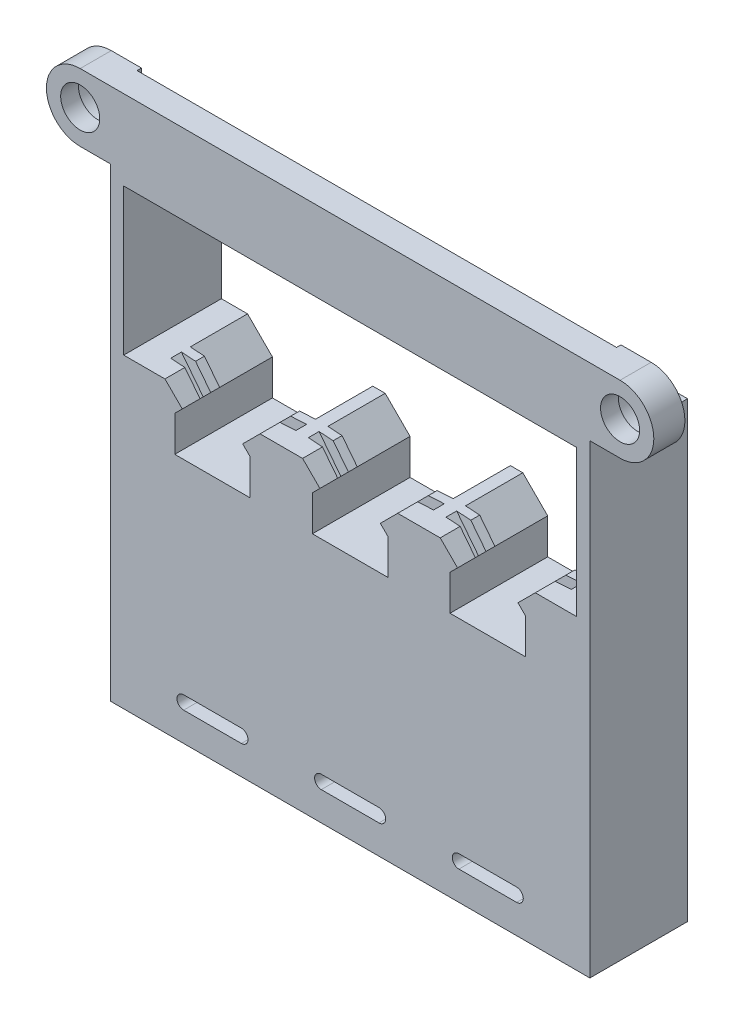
ISO-10303-21;
HEADER;
FILE_DESCRIPTION(('STEP AP214'),'2;1');
FILE_NAME('part.step','',(''),(''),'','','');
FILE_SCHEMA(('AUTOMOTIVE_DESIGN { 1 0 10303 214 1 1 1 1 }'));
ENDSEC;
DATA;
#1=APPLICATION_CONTEXT('core data for automotive mechanical design processes');
#2=APPLICATION_PROTOCOL_DEFINITION('international standard','automotive_design',2000,#1);
#3=PRODUCT_CONTEXT('',#1,'mechanical');
#4=PRODUCT('Part','Part','',(#3));
#5=PRODUCT_RELATED_PRODUCT_CATEGORY('part','',(#4));
#6=PRODUCT_DEFINITION_FORMATION('','',#4);
#7=PRODUCT_DEFINITION_CONTEXT('part definition',#1,'design');
#8=PRODUCT_DEFINITION('design','',#6,#7);
#9=PRODUCT_DEFINITION_SHAPE('','',#8);
#10=(LENGTH_UNIT() NAMED_UNIT(*) SI_UNIT(.MILLI.,.METRE.));
#11=(NAMED_UNIT(*) PLANE_ANGLE_UNIT() SI_UNIT($,.RADIAN.));
#12=(NAMED_UNIT(*) SI_UNIT($,.STERADIAN.) SOLID_ANGLE_UNIT());
#13=UNCERTAINTY_MEASURE_WITH_UNIT(LENGTH_MEASURE(1.E-05),#10,'distance_accuracy_value','');
#14=(GEOMETRIC_REPRESENTATION_CONTEXT(3) GLOBAL_UNCERTAINTY_ASSIGNED_CONTEXT((#13)) GLOBAL_UNIT_ASSIGNED_CONTEXT((#10,
#11,#12)) REPRESENTATION_CONTEXT('',''));
#15=CARTESIAN_POINT('',(0.,0.,0.));
#16=DIRECTION('',(0.,0.,1.));
#17=DIRECTION('',(1.,0.,0.));
#18=AXIS2_PLACEMENT_3D('',#15,#16,#17);
#19=CARTESIAN_POINT('',(57.4,56.2,11.));
#20=DIRECTION('',(0.,0.,-1.));
#21=DIRECTION('',(-1.,0.,0.));
#22=AXIS2_PLACEMENT_3D('',#19,#20,#21);
#23=CYLINDRICAL_SURFACE('',#22,2.2);
#24=CARTESIAN_POINT('',(57.4,56.2,11.));
#25=DIRECTION('',(0.,0.,-1.));
#26=DIRECTION('',(-1.,0.,0.));
#27=AXIS2_PLACEMENT_3D('',#24,#25,#26);
#28=CIRCLE('',#27,2.2);
#29=CARTESIAN_POINT('',(55.2,56.2,11.));
#30=VERTEX_POINT('',#29);
#31=EDGE_CURVE('E1294',#30,#30,#28,.T.);
#32=CARTESIAN_POINT('',(57.4,56.2,9.));
#33=DIRECTION('',(0.,0.,-1.));
#34=DIRECTION('',(-1.,0.,0.));
#35=AXIS2_PLACEMENT_3D('',#32,#33,#34);
#36=CIRCLE('',#35,2.2);
#37=CARTESIAN_POINT('',(55.2,56.2,9.));
#38=VERTEX_POINT('',#37);
#39=EDGE_CURVE('E37',#38,#38,#36,.F.);
#40=CARTESIAN_POINT('',(55.2,56.2,11.));
#41=CARTESIAN_POINT('',(55.2,56.2,10.9791666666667));
#42=CARTESIAN_POINT('',(55.2,56.2,10.9583333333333));
#43=CARTESIAN_POINT('',(55.2,56.2,10.9166666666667));
#44=CARTESIAN_POINT('',(55.2,56.2,10.8958333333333));
#45=CARTESIAN_POINT('',(55.2,56.2,10.8541666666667));
#46=CARTESIAN_POINT('',(55.2,56.2,10.8333333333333));
#47=CARTESIAN_POINT('',(55.2,56.2,10.7916666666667));
#48=CARTESIAN_POINT('',(55.2,56.2,10.7708333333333));
#49=CARTESIAN_POINT('',(55.2,56.2,10.7291666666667));
#50=CARTESIAN_POINT('',(55.2,56.2,10.7083333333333));
#51=CARTESIAN_POINT('',(55.2,56.2,10.6666666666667));
#52=CARTESIAN_POINT('',(55.2,56.2,10.6458333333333));
#53=CARTESIAN_POINT('',(55.2,56.2,10.6041666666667));
#54=CARTESIAN_POINT('',(55.2,56.2,10.5833333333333));
#55=CARTESIAN_POINT('',(55.2,56.2,10.5416666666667));
#56=CARTESIAN_POINT('',(55.2,56.2,10.5208333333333));
#57=CARTESIAN_POINT('',(55.2,56.2,10.4791666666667));
#58=CARTESIAN_POINT('',(55.2,56.2,10.4583333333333));
#59=CARTESIAN_POINT('',(55.2,56.2,10.4166666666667));
#60=CARTESIAN_POINT('',(55.2,56.2,10.3958333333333));
#61=CARTESIAN_POINT('',(55.2,56.2,10.3541666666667));
#62=CARTESIAN_POINT('',(55.2,56.2,10.3333333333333));
#63=CARTESIAN_POINT('',(55.2,56.2,10.2916666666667));
#64=CARTESIAN_POINT('',(55.2,56.2,10.2708333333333));
#65=CARTESIAN_POINT('',(55.2,56.2,10.2291666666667));
#66=CARTESIAN_POINT('',(55.2,56.2,10.2083333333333));
#67=CARTESIAN_POINT('',(55.2,56.2,10.1666666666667));
#68=CARTESIAN_POINT('',(55.2,56.2,10.1458333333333));
#69=CARTESIAN_POINT('',(55.2,56.2,10.1041666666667));
#70=CARTESIAN_POINT('',(55.2,56.2,10.0833333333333));
#71=CARTESIAN_POINT('',(55.2,56.2,10.0416666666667));
#72=CARTESIAN_POINT('',(55.2,56.2,10.0208333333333));
#73=CARTESIAN_POINT('',(55.2,56.2,9.97916666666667));
#74=CARTESIAN_POINT('',(55.2,56.2,9.95833333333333));
#75=CARTESIAN_POINT('',(55.2,56.2,9.91666666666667));
#76=CARTESIAN_POINT('',(55.2,56.2,9.89583333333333));
#77=CARTESIAN_POINT('',(55.2,56.2,9.85416666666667));
#78=CARTESIAN_POINT('',(55.2,56.2,9.83333333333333));
#79=CARTESIAN_POINT('',(55.2,56.2,9.79166666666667));
#80=CARTESIAN_POINT('',(55.2,56.2,9.77083333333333));
#81=CARTESIAN_POINT('',(55.2,56.2,9.72916666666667));
#82=CARTESIAN_POINT('',(55.2,56.2,9.70833333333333));
#83=CARTESIAN_POINT('',(55.2,56.2,9.66666666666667));
#84=CARTESIAN_POINT('',(55.2,56.2,9.64583333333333));
#85=CARTESIAN_POINT('',(55.2,56.2,9.60416666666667));
#86=CARTESIAN_POINT('',(55.2,56.2,9.58333333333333));
#87=CARTESIAN_POINT('',(55.2,56.2,9.54166666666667));
#88=CARTESIAN_POINT('',(55.2,56.2,9.52083333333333));
#89=CARTESIAN_POINT('',(55.2,56.2,9.47916666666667));
#90=CARTESIAN_POINT('',(55.2,56.2,9.45833333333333));
#91=CARTESIAN_POINT('',(55.2,56.2,9.41666666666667));
#92=CARTESIAN_POINT('',(55.2,56.2,9.39583333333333));
#93=CARTESIAN_POINT('',(55.2,56.2,9.35416666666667));
#94=CARTESIAN_POINT('',(55.2,56.2,9.33333333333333));
#95=CARTESIAN_POINT('',(55.2,56.2,9.29166666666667));
#96=CARTESIAN_POINT('',(55.2,56.2,9.27083333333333));
#97=CARTESIAN_POINT('',(55.2,56.2,9.22916666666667));
#98=CARTESIAN_POINT('',(55.2,56.2,9.20833333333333));
#99=CARTESIAN_POINT('',(55.2,56.2,9.16666666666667));
#100=CARTESIAN_POINT('',(55.2,56.2,9.14583333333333));
#101=CARTESIAN_POINT('',(55.2,56.2,9.10416666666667));
#102=CARTESIAN_POINT('',(55.2,56.2,9.08333333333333));
#103=CARTESIAN_POINT('',(55.2,56.2,9.04166666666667));
#104=CARTESIAN_POINT('',(55.2,56.2,9.02083333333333));
#105=CARTESIAN_POINT('',(55.2,56.2,9.));
#106=B_SPLINE_CURVE_WITH_KNOTS('',3,(#40,#41,#42,#43,#44,#45,#46,#47,#48,#49,#50,#51,#52,#53,
#54,#55,#56,#57,#58,#59,#60,#61,#62,#63,#64,#65,#66,#67,#68,#69,#70,#71,#72,#73,#74,#75,#76,#77,
#78,#79,#80,#81,#82,#83,#84,#85,#86,#87,#88,#89,#90,#91,#92,#93,#94,#95,#96,#97,#98,#99,#100,
#101,#102,#103,#104,#105),.UNSPECIFIED.,.F.,.F.,(4,2,2,2,2,2,2,2,2,2,2,2,2,2,2,2,2,2,2,2,2,2,2,
2,2,2,2,2,2,2,2,2,4),(0.,0.0625000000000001,0.125,0.1875,0.25,0.3125,0.375,0.4375,0.5,0.5625,
0.625000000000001,0.687500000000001,0.750000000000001,0.812500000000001,0.875000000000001,
0.937500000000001,1.,1.0625,1.125,1.1875,1.25,1.3125,1.375,1.4375,1.5,1.5625,1.625,1.6875,1.75,
1.8125,1.875,1.9375,2.),.UNSPECIFIED.);
#107=EDGE_CURVE('BSEAM33',#30,#38,#106,.T.);
#108=ORIENTED_EDGE('',*,*,#31,.F.);
#109=ORIENTED_EDGE('',*,*,#39,.F.);
#110=ORIENTED_EDGE('',*,*,#107,.T.);
#111=ORIENTED_EDGE('',*,*,#107,.F.);
#112=EDGE_LOOP('',(#108,#110,#109,#111));
#113=FACE_BOUND('',#112,.T.);
#114=ADVANCED_FACE('F33',(#113),#23,.F.);
#115=CARTESIAN_POINT('',(-3.39999999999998,56.2,11.));
#116=DIRECTION('',(0.,0.,-1.));
#117=DIRECTION('',(-1.,0.,0.));
#118=AXIS2_PLACEMENT_3D('',#115,#116,#117);
#119=CYLINDRICAL_SURFACE('',#118,2.2);
#120=CARTESIAN_POINT('',(-3.39999999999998,56.2,11.));
#121=DIRECTION('',(0.,0.,-1.));
#122=DIRECTION('',(-1.,0.,0.));
#123=AXIS2_PLACEMENT_3D('',#120,#121,#122);
#124=CIRCLE('',#123,2.2);
#125=CARTESIAN_POINT('',(-5.59999999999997,56.2,11.));
#126=VERTEX_POINT('',#125);
#127=EDGE_CURVE('E1279',#126,#126,#124,.T.);
#128=CARTESIAN_POINT('',(-3.39999999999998,56.2,9.));
#129=DIRECTION('',(0.,0.,-1.));
#130=DIRECTION('',(-1.,0.,0.));
#131=AXIS2_PLACEMENT_3D('',#128,#129,#130);
#132=CIRCLE('',#131,2.2);
#133=CARTESIAN_POINT('',(-5.59999999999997,56.2,9.));
#134=VERTEX_POINT('',#133);
#135=EDGE_CURVE('E1273',#134,#134,#132,.F.);
#136=CARTESIAN_POINT('',(-5.59999999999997,56.2,11.));
#137=CARTESIAN_POINT('',(-5.59999999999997,56.2,10.9791666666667));
#138=CARTESIAN_POINT('',(-5.59999999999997,56.2,10.9583333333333));
#139=CARTESIAN_POINT('',(-5.59999999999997,56.2,10.9166666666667));
#140=CARTESIAN_POINT('',(-5.59999999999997,56.2,10.8958333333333));
#141=CARTESIAN_POINT('',(-5.59999999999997,56.2,10.8541666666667));
#142=CARTESIAN_POINT('',(-5.59999999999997,56.2,10.8333333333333));
#143=CARTESIAN_POINT('',(-5.59999999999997,56.2,10.7916666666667));
#144=CARTESIAN_POINT('',(-5.59999999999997,56.2,10.7708333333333));
#145=CARTESIAN_POINT('',(-5.59999999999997,56.2,10.7291666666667));
#146=CARTESIAN_POINT('',(-5.59999999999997,56.2,10.7083333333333));
#147=CARTESIAN_POINT('',(-5.59999999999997,56.2,10.6666666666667));
#148=CARTESIAN_POINT('',(-5.59999999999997,56.2,10.6458333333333));
#149=CARTESIAN_POINT('',(-5.59999999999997,56.2,10.6041666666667));
#150=CARTESIAN_POINT('',(-5.59999999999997,56.2,10.5833333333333));
#151=CARTESIAN_POINT('',(-5.59999999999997,56.2,10.5416666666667));
#152=CARTESIAN_POINT('',(-5.59999999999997,56.2,10.5208333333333));
#153=CARTESIAN_POINT('',(-5.59999999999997,56.2,10.4791666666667));
#154=CARTESIAN_POINT('',(-5.59999999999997,56.2,10.4583333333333));
#155=CARTESIAN_POINT('',(-5.59999999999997,56.2,10.4166666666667));
#156=CARTESIAN_POINT('',(-5.59999999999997,56.2,10.3958333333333));
#157=CARTESIAN_POINT('',(-5.59999999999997,56.2,10.3541666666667));
#158=CARTESIAN_POINT('',(-5.59999999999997,56.2,10.3333333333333));
#159=CARTESIAN_POINT('',(-5.59999999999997,56.2,10.2916666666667));
#160=CARTESIAN_POINT('',(-5.59999999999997,56.2,10.2708333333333));
#161=CARTESIAN_POINT('',(-5.59999999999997,56.2,10.2291666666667));
#162=CARTESIAN_POINT('',(-5.59999999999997,56.2,10.2083333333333));
#163=CARTESIAN_POINT('',(-5.59999999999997,56.2,10.1666666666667));
#164=CARTESIAN_POINT('',(-5.59999999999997,56.2,10.1458333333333));
#165=CARTESIAN_POINT('',(-5.59999999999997,56.2,10.1041666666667));
#166=CARTESIAN_POINT('',(-5.59999999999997,56.2,10.0833333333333));
#167=CARTESIAN_POINT('',(-5.59999999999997,56.2,10.0416666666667));
#168=CARTESIAN_POINT('',(-5.59999999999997,56.2,10.0208333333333));
#169=CARTESIAN_POINT('',(-5.59999999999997,56.2,9.97916666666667));
#170=CARTESIAN_POINT('',(-5.59999999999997,56.2,9.95833333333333));
#171=CARTESIAN_POINT('',(-5.59999999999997,56.2,9.91666666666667));
#172=CARTESIAN_POINT('',(-5.59999999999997,56.2,9.89583333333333));
#173=CARTESIAN_POINT('',(-5.59999999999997,56.2,9.85416666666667));
#174=CARTESIAN_POINT('',(-5.59999999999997,56.2,9.83333333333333));
#175=CARTESIAN_POINT('',(-5.59999999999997,56.2,9.79166666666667));
#176=CARTESIAN_POINT('',(-5.59999999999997,56.2,9.77083333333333));
#177=CARTESIAN_POINT('',(-5.59999999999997,56.2,9.72916666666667));
#178=CARTESIAN_POINT('',(-5.59999999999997,56.2,9.70833333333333));
#179=CARTESIAN_POINT('',(-5.59999999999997,56.2,9.66666666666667));
#180=CARTESIAN_POINT('',(-5.59999999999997,56.2,9.64583333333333));
#181=CARTESIAN_POINT('',(-5.59999999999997,56.2,9.60416666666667));
#182=CARTESIAN_POINT('',(-5.59999999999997,56.2,9.58333333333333));
#183=CARTESIAN_POINT('',(-5.59999999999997,56.2,9.54166666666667));
#184=CARTESIAN_POINT('',(-5.59999999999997,56.2,9.52083333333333));
#185=CARTESIAN_POINT('',(-5.59999999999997,56.2,9.47916666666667));
#186=CARTESIAN_POINT('',(-5.59999999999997,56.2,9.45833333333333));
#187=CARTESIAN_POINT('',(-5.59999999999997,56.2,9.41666666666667));
#188=CARTESIAN_POINT('',(-5.59999999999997,56.2,9.39583333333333));
#189=CARTESIAN_POINT('',(-5.59999999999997,56.2,9.35416666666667));
#190=CARTESIAN_POINT('',(-5.59999999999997,56.2,9.33333333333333));
#191=CARTESIAN_POINT('',(-5.59999999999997,56.2,9.29166666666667));
#192=CARTESIAN_POINT('',(-5.59999999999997,56.2,9.27083333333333));
#193=CARTESIAN_POINT('',(-5.59999999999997,56.2,9.22916666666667));
#194=CARTESIAN_POINT('',(-5.59999999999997,56.2,9.20833333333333));
#195=CARTESIAN_POINT('',(-5.59999999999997,56.2,9.16666666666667));
#196=CARTESIAN_POINT('',(-5.59999999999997,56.2,9.14583333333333));
#197=CARTESIAN_POINT('',(-5.59999999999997,56.2,9.10416666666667));
#198=CARTESIAN_POINT('',(-5.59999999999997,56.2,9.08333333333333));
#199=CARTESIAN_POINT('',(-5.59999999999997,56.2,9.04166666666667));
#200=CARTESIAN_POINT('',(-5.59999999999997,56.2,9.02083333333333));
#201=CARTESIAN_POINT('',(-5.59999999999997,56.2,9.));
#202=B_SPLINE_CURVE_WITH_KNOTS('',3,(#136,#137,#138,#139,#140,#141,#142,#143,#144,#145,#146,
#147,#148,#149,#150,#151,#152,#153,#154,#155,#156,#157,#158,#159,#160,#161,#162,#163,#164,#165,
#166,#167,#168,#169,#170,#171,#172,#173,#174,#175,#176,#177,#178,#179,#180,#181,#182,#183,#184,
#185,#186,#187,#188,#189,#190,#191,#192,#193,#194,#195,#196,#197,#198,#199,#200,#201),
.UNSPECIFIED.,.F.,.F.,(4,2,2,2,2,2,2,2,2,2,2,2,2,2,2,2,2,2,2,2,2,2,2,2,2,2,2,2,2,2,2,2,4),(0.,
0.0625000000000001,0.125,0.1875,0.25,0.3125,0.375,0.4375,0.5,0.5625,0.625000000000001,
0.687500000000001,0.750000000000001,0.812500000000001,0.875000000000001,0.937500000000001,1.,
1.0625,1.125,1.1875,1.25,1.3125,1.375,1.4375,1.5,1.5625,1.625,1.6875,1.75,1.8125,1.875,1.9375,
2.),.UNSPECIFIED.);
#203=EDGE_CURVE('BSEAM1482',#126,#134,#202,.T.);
#204=ORIENTED_EDGE('',*,*,#127,.F.);
#205=ORIENTED_EDGE('',*,*,#135,.F.);
#206=ORIENTED_EDGE('',*,*,#203,.T.);
#207=ORIENTED_EDGE('',*,*,#203,.F.);
#208=EDGE_LOOP('',(#204,#206,#205,#207));
#209=FACE_BOUND('',#208,.T.);
#210=ADVANCED_FACE('F1482',(#209),#119,.F.);
#211=CARTESIAN_POINT('',(1.5,51.,0.));
#212=DIRECTION('',(0.,1.,0.));
#213=DIRECTION('',(0.,0.,1.));
#214=AXIS2_PLACEMENT_3D('',#211,#212,#213);
#215=PLANE('',#214);
#216=DIRECTION('',(-1.,0.,0.));
#217=VECTOR('',#216,1.);
#218=CARTESIAN_POINT('',(54.,51.,8.));
#219=LINE('',#218,#217);
#220=CARTESIAN_POINT('',(52.5,51.,8.));
#221=VERTEX_POINT('',#220);
#222=CARTESIAN_POINT('',(1.5,51.,8.));
#223=VERTEX_POINT('',#222);
#224=EDGE_CURVE('E598',#221,#223,#219,.T.);
#225=ORIENTED_EDGE('',*,*,#224,.F.);
#226=DIRECTION('',(0.,0.,1.));
#227=VECTOR('',#226,1.);
#228=CARTESIAN_POINT('',(52.5,51.,0.));
#229=LINE('',#228,#227);
#230=CARTESIAN_POINT('',(52.5,51.,11.));
#231=VERTEX_POINT('',#230);
#232=EDGE_CURVE('E1099',#221,#231,#229,.T.);
#233=ORIENTED_EDGE('',*,*,#232,.T.);
#234=DIRECTION('',(-1.,0.,0.));
#235=VECTOR('',#234,1.);
#236=CARTESIAN_POINT('',(1.5,51.,11.));
#237=LINE('',#236,#235);
#238=CARTESIAN_POINT('',(1.5,51.,11.));
#239=VERTEX_POINT('',#238);
#240=EDGE_CURVE('E992',#231,#239,#237,.T.);
#241=ORIENTED_EDGE('',*,*,#240,.T.);
#242=DIRECTION('',(0.,0.,1.));
#243=VECTOR('',#242,1.);
#244=CARTESIAN_POINT('',(1.5,51.,0.));
#245=LINE('',#244,#243);
#246=EDGE_CURVE('E1097',#223,#239,#245,.T.);
#247=ORIENTED_EDGE('',*,*,#246,.F.);
#248=EDGE_LOOP('',(#225,#233,#241,#247));
#249=FACE_BOUND('',#248,.T.);
#250=ADVANCED_FACE('F1363',(#249),#215,.F.);
#251=CARTESIAN_POINT('',(0.,0.,11.));
#252=DIRECTION('',(1.,0.,0.));
#253=DIRECTION('',(0.,0.,-1.));
#254=AXIS2_PLACEMENT_3D('',#251,#252,#253);
#255=PLANE('',#254);
#256=DIRECTION('',(0.,1.,0.));
#257=VECTOR('',#256,1.);
#258=CARTESIAN_POINT('',(0.,60.,8.));
#259=LINE('',#258,#257);
#260=CARTESIAN_POINT('',(0.,51.,8.));
#261=VERTEX_POINT('',#260);
#262=CARTESIAN_POINT('',(0.,52.4,8.));
#263=VERTEX_POINT('',#262);
#264=EDGE_CURVE('E612',#261,#263,#259,.T.);
#265=ORIENTED_EDGE('',*,*,#264,.F.);
#266=DIRECTION('',(0.,0.,-1.));
#267=VECTOR('',#266,1.);
#268=CARTESIAN_POINT('',(0.,51.,8.));
#269=LINE('',#268,#267);
#270=CARTESIAN_POINT('',(0.,51.,0.));
#271=VERTEX_POINT('',#270);
#272=EDGE_CURVE('E606',#261,#271,#269,.T.);
#273=ORIENTED_EDGE('',*,*,#272,.T.);
#274=DIRECTION('',(0.,-1.,0.));
#275=VECTOR('',#274,1.);
#276=CARTESIAN_POINT('',(0.,0.,0.));
#277=LINE('',#276,#275);
#278=CARTESIAN_POINT('',(0.,0.,0.));
#279=VERTEX_POINT('',#278);
#280=EDGE_CURVE('E1096',#271,#279,#277,.T.);
#281=ORIENTED_EDGE('',*,*,#280,.T.);
#282=DIRECTION('',(0.,0.,-1.));
#283=VECTOR('',#282,1.);
#284=CARTESIAN_POINT('',(0.,0.,11.));
#285=LINE('',#284,#283);
#286=CARTESIAN_POINT('',(0.,0.,11.));
#287=VERTEX_POINT('',#286);
#288=EDGE_CURVE('E42',#287,#279,#285,.T.);
#289=ORIENTED_EDGE('',*,*,#288,.F.);
#290=DIRECTION('',(0.,-1.,0.));
#291=VECTOR('',#290,1.);
#292=CARTESIAN_POINT('',(0.,0.,11.));
#293=LINE('',#292,#291);
#294=CARTESIAN_POINT('',(0.,52.4,11.));
#295=VERTEX_POINT('',#294);
#296=EDGE_CURVE('E1257',#295,#287,#293,.T.);
#297=ORIENTED_EDGE('',*,*,#296,.F.);
#298=DIRECTION('',(0.,0.,1.));
#299=VECTOR('',#298,1.);
#300=CARTESIAN_POINT('',(0.,52.4,7.5));
#301=LINE('',#300,#299);
#302=EDGE_CURVE('E50',#263,#295,#301,.T.);
#303=ORIENTED_EDGE('',*,*,#302,.F.);
#304=EDGE_LOOP('',(#265,#273,#281,#289,#297,#303));
#305=FACE_BOUND('',#304,.T.);
#306=ADVANCED_FACE('F35',(#305),#255,.F.);
#307=CARTESIAN_POINT('',(0.,0.,11.));
#308=DIRECTION('',(0.,0.,-1.));
#309=DIRECTION('',(-1.,0.,0.));
#310=AXIS2_PLACEMENT_3D('',#307,#308,#309);
#311=PLANE('',#310);
#312=ORIENTED_EDGE('',*,*,#31,.T.);
#313=EDGE_LOOP('',(#312));
#314=FACE_BOUND('',#313,.T.);
#315=ORIENTED_EDGE('',*,*,#127,.T.);
#316=EDGE_LOOP('',(#315));
#317=FACE_BOUND('',#316,.T.);
#318=DIRECTION('',(1.,0.,0.));
#319=VECTOR('',#318,1.);
#320=CARTESIAN_POINT('',(8.25,3.25,11.));
#321=LINE('',#320,#319);
#322=CARTESIAN_POINT('',(8.25,3.25,11.));
#323=VERTEX_POINT('',#322);
#324=CARTESIAN_POINT('',(14.75,3.25,11.));
#325=VERTEX_POINT('',#324);
#326=EDGE_CURVE('E1179',#323,#325,#321,.T.);
#327=ORIENTED_EDGE('',*,*,#326,.F.);
#328=CARTESIAN_POINT('',(8.25,4.,11.));
#329=DIRECTION('',(0.,0.,1.));
#330=DIRECTION('',(1.,0.,0.));
#331=AXIS2_PLACEMENT_3D('',#328,#329,#330);
#332=CIRCLE('',#331,0.75);
#333=CARTESIAN_POINT('',(8.25,4.75,11.));
#334=VERTEX_POINT('',#333);
#335=EDGE_CURVE('E1177',#334,#323,#332,.T.);
#336=ORIENTED_EDGE('',*,*,#335,.F.);
#337=DIRECTION('',(-1.,0.,0.));
#338=VECTOR('',#337,1.);
#339=CARTESIAN_POINT('',(8.25,4.75,11.));
#340=LINE('',#339,#338);
#341=CARTESIAN_POINT('',(14.75,4.75,11.));
#342=VERTEX_POINT('',#341);
#343=EDGE_CURVE('E1167',#342,#334,#340,.T.);
#344=ORIENTED_EDGE('',*,*,#343,.F.);
#345=CARTESIAN_POINT('',(14.75,4.,11.));
#346=DIRECTION('',(0.,0.,1.));
#347=DIRECTION('',(1.,0.,0.));
#348=AXIS2_PLACEMENT_3D('',#345,#346,#347);
#349=CIRCLE('',#348,0.75);
#350=EDGE_CURVE('E1183',#325,#342,#349,.T.);
#351=ORIENTED_EDGE('',*,*,#350,.F.);
#352=EDGE_LOOP('',(#327,#336,#344,#351));
#353=FACE_BOUND('',#352,.T.);
#354=DIRECTION('',(1.,0.,0.));
#355=VECTOR('',#354,1.);
#356=CARTESIAN_POINT('',(23.75,3.25,11.));
#357=LINE('',#356,#355);
#358=CARTESIAN_POINT('',(23.75,3.25,11.));
#359=VERTEX_POINT('',#358);
#360=CARTESIAN_POINT('',(30.25,3.25,11.));
#361=VERTEX_POINT('',#360);
#362=EDGE_CURVE('E1211',#359,#361,#357,.T.);
#363=ORIENTED_EDGE('',*,*,#362,.F.);
#364=CARTESIAN_POINT('',(23.75,4.,11.));
#365=DIRECTION('',(0.,0.,1.));
#366=DIRECTION('',(1.,0.,0.));
#367=AXIS2_PLACEMENT_3D('',#364,#365,#366);
#368=CIRCLE('',#367,0.750000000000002);
#369=CARTESIAN_POINT('',(23.75,4.75,11.));
#370=VERTEX_POINT('',#369);
#371=EDGE_CURVE('E1209',#370,#359,#368,.T.);
#372=ORIENTED_EDGE('',*,*,#371,.F.);
#373=DIRECTION('',(-1.,0.,0.));
#374=VECTOR('',#373,1.);
#375=CARTESIAN_POINT('',(23.75,4.75,11.));
#376=LINE('',#375,#374);
#377=CARTESIAN_POINT('',(30.25,4.75,11.));
#378=VERTEX_POINT('',#377);
#379=EDGE_CURVE('E1199',#378,#370,#376,.T.);
#380=ORIENTED_EDGE('',*,*,#379,.F.);
#381=CARTESIAN_POINT('',(30.25,4.,11.));
#382=DIRECTION('',(0.,0.,1.));
#383=DIRECTION('',(1.,0.,0.));
#384=AXIS2_PLACEMENT_3D('',#381,#382,#383);
#385=CIRCLE('',#384,0.750000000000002);
#386=EDGE_CURVE('E1215',#361,#378,#385,.T.);
#387=ORIENTED_EDGE('',*,*,#386,.F.);
#388=EDGE_LOOP('',(#363,#372,#380,#387));
#389=FACE_BOUND('',#388,.T.);
#390=DIRECTION('',(1.,0.,0.));
#391=VECTOR('',#390,1.);
#392=CARTESIAN_POINT('',(39.25,3.25,11.));
#393=LINE('',#392,#391);
#394=CARTESIAN_POINT('',(39.25,3.25,11.));
#395=VERTEX_POINT('',#394);
#396=CARTESIAN_POINT('',(45.75,3.25,11.));
#397=VERTEX_POINT('',#396);
#398=EDGE_CURVE('E1242',#395,#397,#393,.T.);
#399=ORIENTED_EDGE('',*,*,#398,.F.);
#400=CARTESIAN_POINT('',(39.25,4.,11.));
#401=DIRECTION('',(0.,0.,1.));
#402=DIRECTION('',(1.,0.,0.));
#403=AXIS2_PLACEMENT_3D('',#400,#401,#402);
#404=CIRCLE('',#403,0.750000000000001);
#405=CARTESIAN_POINT('',(39.25,4.75,11.));
#406=VERTEX_POINT('',#405);
#407=EDGE_CURVE('E987',#406,#395,#404,.T.);
#408=ORIENTED_EDGE('',*,*,#407,.F.);
#409=DIRECTION('',(-1.,0.,0.));
#410=VECTOR('',#409,1.);
#411=CARTESIAN_POINT('',(39.25,4.75,11.));
#412=LINE('',#411,#410);
#413=CARTESIAN_POINT('',(45.75,4.75,11.));
#414=VERTEX_POINT('',#413);
#415=EDGE_CURVE('E1231',#414,#406,#412,.T.);
#416=ORIENTED_EDGE('',*,*,#415,.F.);
#417=CARTESIAN_POINT('',(45.75,4.,11.));
#418=DIRECTION('',(0.,0.,1.));
#419=DIRECTION('',(1.,0.,0.));
#420=AXIS2_PLACEMENT_3D('',#417,#418,#419);
#421=CIRCLE('',#420,0.750000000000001);
#422=EDGE_CURVE('E1245',#397,#414,#421,.T.);
#423=ORIENTED_EDGE('',*,*,#422,.F.);
#424=EDGE_LOOP('',(#399,#408,#416,#423));
#425=FACE_BOUND('',#424,.T.);
#426=DIRECTION('',(0.,1.,0.));
#427=VECTOR('',#426,1.);
#428=CARTESIAN_POINT('',(54.,0.,11.));
#429=LINE('',#428,#427);
#430=CARTESIAN_POINT('',(54.,0.,11.));
#431=VERTEX_POINT('',#430);
#432=CARTESIAN_POINT('',(54.,52.4,11.));
#433=VERTEX_POINT('',#432);
#434=EDGE_CURVE('E1261',#431,#433,#429,.T.);
#435=ORIENTED_EDGE('',*,*,#434,.T.);
#436=DIRECTION('',(1.,0.,0.));
#437=VECTOR('',#436,1.);
#438=CARTESIAN_POINT('',(54.,52.4,11.));
#439=LINE('',#438,#437);
#440=CARTESIAN_POINT('',(57.4,52.4,11.));
#441=VERTEX_POINT('',#440);
#442=EDGE_CURVE('E628',#433,#441,#439,.T.);
#443=ORIENTED_EDGE('',*,*,#442,.T.);
#444=CARTESIAN_POINT('',(57.4,56.2,11.));
#445=DIRECTION('',(0.,0.,1.));
#446=DIRECTION('',(1.,0.,0.));
#447=AXIS2_PLACEMENT_3D('',#444,#445,#446);
#448=CIRCLE('',#447,3.8);
#449=CARTESIAN_POINT('',(57.4,60.,11.));
#450=VERTEX_POINT('',#449);
#451=EDGE_CURVE('E625',#441,#450,#448,.T.);
#452=ORIENTED_EDGE('',*,*,#451,.T.);
#453=DIRECTION('',(-1.,0.,0.));
#454=VECTOR('',#453,1.);
#455=CARTESIAN_POINT('',(0.,60.,11.));
#456=LINE('',#455,#454);
#457=CARTESIAN_POINT('',(-3.4,60.,11.));
#458=VERTEX_POINT('',#457);
#459=EDGE_CURVE('E1264',#450,#458,#456,.T.);
#460=ORIENTED_EDGE('',*,*,#459,.T.);
#461=CARTESIAN_POINT('',(-3.39999999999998,56.2,11.));
#462=DIRECTION('',(0.,0.,1.));
#463=DIRECTION('',(1.,0.,0.));
#464=AXIS2_PLACEMENT_3D('',#461,#462,#463);
#465=CIRCLE('',#464,3.8);
#466=CARTESIAN_POINT('',(-3.4,52.4,11.));
#467=VERTEX_POINT('',#466);
#468=EDGE_CURVE('E641',#458,#467,#465,.T.);
#469=ORIENTED_EDGE('',*,*,#468,.T.);
#470=DIRECTION('',(-1.,0.,0.));
#471=VECTOR('',#470,1.);
#472=CARTESIAN_POINT('',(0.,52.4,11.));
#473=LINE('',#472,#471);
#474=EDGE_CURVE('E646',#295,#467,#473,.T.);
#475=ORIENTED_EDGE('',*,*,#474,.F.);
#476=ORIENTED_EDGE('',*,*,#296,.T.);
#477=DIRECTION('',(1.,0.,0.));
#478=VECTOR('',#477,1.);
#479=CARTESIAN_POINT('',(0.,0.,11.));
#480=LINE('',#479,#478);
#481=EDGE_CURVE('E1259',#287,#431,#480,.T.);
#482=ORIENTED_EDGE('',*,*,#481,.T.);
#483=EDGE_LOOP('',(#435,#443,#452,#460,#469,#475,#476,#482));
#484=FACE_BOUND('',#483,.T.);
#485=DIRECTION('',(0.707106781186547,-0.707106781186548,0.));
#486=VECTOR('',#485,1.);
#487=CARTESIAN_POINT('',(5.29700956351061,35.3485281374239,11.));
#488=LINE('',#487,#486);
#489=CARTESIAN_POINT('',(6.14553770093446,34.5,11.));
#490=VERTEX_POINT('',#489);
#491=CARTESIAN_POINT('',(8.09852813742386,32.5470095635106,11.));
#492=VERTEX_POINT('',#491);
#493=EDGE_CURVE('E969',#490,#492,#488,.T.);
#494=ORIENTED_EDGE('',*,*,#493,.F.);
#495=DIRECTION('',(1.,0.,0.));
#496=VECTOR('',#495,1.);
#497=CARTESIAN_POINT('',(1.50000000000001,34.5,11.));
#498=LINE('',#497,#496);
#499=CARTESIAN_POINT('',(1.50000000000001,34.5,11.));
#500=VERTEX_POINT('',#499);
#501=EDGE_CURVE('E58',#500,#490,#498,.T.);
#502=ORIENTED_EDGE('',*,*,#501,.F.);
#503=DIRECTION('',(0.,-1.,0.));
#504=VECTOR('',#503,1.);
#505=CARTESIAN_POINT('',(1.5,51.,11.));
#506=LINE('',#505,#504);
#507=EDGE_CURVE('E1053',#239,#500,#506,.T.);
#508=ORIENTED_EDGE('',*,*,#507,.F.);
#509=ORIENTED_EDGE('',*,*,#240,.F.);
#510=DIRECTION('',(0.,1.,0.));
#511=VECTOR('',#510,1.);
#512=CARTESIAN_POINT('',(52.5,34.5,11.));
#513=LINE('',#512,#511);
#514=CARTESIAN_POINT('',(52.5,34.5,11.));
#515=VERTEX_POINT('',#514);
#516=EDGE_CURVE('E1088',#515,#231,#513,.T.);
#517=ORIENTED_EDGE('',*,*,#516,.F.);
#518=DIRECTION('',(1.,0.,0.));
#519=VECTOR('',#518,1.);
#520=CARTESIAN_POINT('',(49.5515185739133,34.5,11.));
#521=LINE('',#520,#519);
#522=CARTESIAN_POINT('',(47.8544622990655,34.5,11.));
#523=VERTEX_POINT('',#522);
#524=EDGE_CURVE('E1085',#523,#515,#521,.T.);
#525=ORIENTED_EDGE('',*,*,#524,.F.);
#526=DIRECTION('',(-0.707106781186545,-0.70710678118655,0.));
#527=VECTOR('',#526,1.);
#528=CARTESIAN_POINT('',(48.7029904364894,35.3485281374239,11.));
#529=LINE('',#528,#527);
#530=CARTESIAN_POINT('',(45.9014718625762,32.5470095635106,11.));
#531=VERTEX_POINT('',#530);
#532=EDGE_CURVE('E851',#523,#531,#529,.T.);
#533=ORIENTED_EDGE('',*,*,#532,.T.);
#534=DIRECTION('',(0.70710678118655,-0.707106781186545,0.));
#535=VECTOR('',#534,1.);
#536=CARTESIAN_POINT('',(45.9014718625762,32.5470095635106,11.));
#537=LINE('',#536,#535);
#538=CARTESIAN_POINT('',(46.75,31.6984814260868,11.));
#539=VERTEX_POINT('',#538);
#540=EDGE_CURVE('E853',#531,#539,#537,.T.);
#541=ORIENTED_EDGE('',*,*,#540,.T.);
#542=DIRECTION('',(0.,1.,0.));
#543=VECTOR('',#542,1.);
#544=CARTESIAN_POINT('',(46.75,27.6984814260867,11.));
#545=LINE('',#544,#543);
#546=CARTESIAN_POINT('',(46.75,27.6984814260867,11.));
#547=VERTEX_POINT('',#546);
#548=EDGE_CURVE('E1083',#547,#539,#545,.T.);
#549=ORIENTED_EDGE('',*,*,#548,.F.);
#550=DIRECTION('',(1.,0.,0.));
#551=VECTOR('',#550,1.);
#552=CARTESIAN_POINT('',(38.25,27.6984814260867,11.));
#553=LINE('',#552,#551);
#554=CARTESIAN_POINT('',(38.25,27.6984814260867,11.));
#555=VERTEX_POINT('',#554);
#556=EDGE_CURVE('E1080',#555,#547,#553,.T.);
#557=ORIENTED_EDGE('',*,*,#556,.F.);
#558=DIRECTION('',(0.,-1.,0.));
#559=VECTOR('',#558,1.);
#560=CARTESIAN_POINT('',(38.25,31.6984814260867,11.));
#561=LINE('',#560,#559);
#562=CARTESIAN_POINT('',(38.25,31.6984814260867,11.));
#563=VERTEX_POINT('',#562);
#564=EDGE_CURVE('E1077',#563,#555,#561,.T.);
#565=ORIENTED_EDGE('',*,*,#564,.F.);
#566=DIRECTION('',(-0.707106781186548,-0.707106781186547,0.));
#567=VECTOR('',#566,1.);
#568=CARTESIAN_POINT('',(39.0985281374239,32.5470095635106,11.));
#569=LINE('',#568,#567);
#570=CARTESIAN_POINT('',(39.0985281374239,32.5470095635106,11.));
#571=VERTEX_POINT('',#570);
#572=EDGE_CURVE('E777',#571,#563,#569,.T.);
#573=ORIENTED_EDGE('',*,*,#572,.F.);
#574=DIRECTION('',(0.707106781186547,-0.707106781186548,0.));
#575=VECTOR('',#574,1.);
#576=CARTESIAN_POINT('',(36.2970095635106,35.3485281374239,11.));
#577=LINE('',#576,#575);
#578=CARTESIAN_POINT('',(37.1455377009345,34.5,11.));
#579=VERTEX_POINT('',#578);
#580=EDGE_CURVE('E762',#579,#571,#577,.T.);
#581=ORIENTED_EDGE('',*,*,#580,.F.);
#582=DIRECTION('',(1.,0.,0.));
#583=VECTOR('',#582,1.);
#584=CARTESIAN_POINT('',(34.0515185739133,34.5,11.));
#585=LINE('',#584,#583);
#586=CARTESIAN_POINT('',(32.3544622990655,34.5,11.));
#587=VERTEX_POINT('',#586);
#588=EDGE_CURVE('E1075',#587,#579,#585,.T.);
#589=ORIENTED_EDGE('',*,*,#588,.F.);
#590=DIRECTION('',(-0.707106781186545,-0.70710678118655,0.));
#591=VECTOR('',#590,1.);
#592=CARTESIAN_POINT('',(33.2029904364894,35.3485281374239,11.));
#593=LINE('',#592,#591);
#594=CARTESIAN_POINT('',(30.4014718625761,32.5470095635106,11.));
#595=VERTEX_POINT('',#594);
#596=EDGE_CURVE('E892',#587,#595,#593,.T.);
#597=ORIENTED_EDGE('',*,*,#596,.T.);
#598=DIRECTION('',(0.70710678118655,-0.707106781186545,0.));
#599=VECTOR('',#598,1.);
#600=CARTESIAN_POINT('',(30.4014718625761,32.5470095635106,11.));
#601=LINE('',#600,#599);
#602=CARTESIAN_POINT('',(31.25,31.6984814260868,11.));
#603=VERTEX_POINT('',#602);
#604=EDGE_CURVE('E894',#595,#603,#601,.T.);
#605=ORIENTED_EDGE('',*,*,#604,.T.);
#606=DIRECTION('',(0.,1.,0.));
#607=VECTOR('',#606,1.);
#608=CARTESIAN_POINT('',(31.25,27.6984814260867,11.));
#609=LINE('',#608,#607);
#610=CARTESIAN_POINT('',(31.25,27.6984814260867,11.));
#611=VERTEX_POINT('',#610);
#612=EDGE_CURVE('E1073',#611,#603,#609,.T.);
#613=ORIENTED_EDGE('',*,*,#612,.F.);
#614=DIRECTION('',(1.,0.,0.));
#615=VECTOR('',#614,1.);
#616=CARTESIAN_POINT('',(22.75,27.6984814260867,11.));
#617=LINE('',#616,#615);
#618=CARTESIAN_POINT('',(22.75,27.6984814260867,11.));
#619=VERTEX_POINT('',#618);
#620=EDGE_CURVE('E1070',#619,#611,#617,.T.);
#621=ORIENTED_EDGE('',*,*,#620,.F.);
#622=DIRECTION('',(0.,-1.,0.));
#623=VECTOR('',#622,1.);
#624=CARTESIAN_POINT('',(22.75,31.6984814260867,11.));
#625=LINE('',#624,#623);
#626=CARTESIAN_POINT('',(22.75,31.6984814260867,11.));
#627=VERTEX_POINT('',#626);
#628=EDGE_CURVE('E1067',#627,#619,#625,.T.);
#629=ORIENTED_EDGE('',*,*,#628,.F.);
#630=DIRECTION('',(-0.707106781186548,-0.707106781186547,0.));
#631=VECTOR('',#630,1.);
#632=CARTESIAN_POINT('',(23.5985281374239,32.5470095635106,11.));
#633=LINE('',#632,#631);
#634=CARTESIAN_POINT('',(23.5985281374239,32.5470095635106,11.));
#635=VERTEX_POINT('',#634);
#636=EDGE_CURVE('E819',#635,#627,#633,.T.);
#637=ORIENTED_EDGE('',*,*,#636,.F.);
#638=DIRECTION('',(0.707106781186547,-0.707106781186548,0.));
#639=VECTOR('',#638,1.);
#640=CARTESIAN_POINT('',(20.7970095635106,35.3485281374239,11.));
#641=LINE('',#640,#639);
#642=CARTESIAN_POINT('',(21.6455377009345,34.5,11.));
#643=VERTEX_POINT('',#642);
#644=EDGE_CURVE('E804',#643,#635,#641,.T.);
#645=ORIENTED_EDGE('',*,*,#644,.F.);
#646=DIRECTION('',(1.,0.,0.));
#647=VECTOR('',#646,1.);
#648=CARTESIAN_POINT('',(18.5515185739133,34.5,11.));
#649=LINE('',#648,#647);
#650=CARTESIAN_POINT('',(16.8544622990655,34.5,11.));
#651=VERTEX_POINT('',#650);
#652=EDGE_CURVE('E1065',#651,#643,#649,.T.);
#653=ORIENTED_EDGE('',*,*,#652,.F.);
#654=DIRECTION('',(-0.707106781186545,-0.70710678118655,0.));
#655=VECTOR('',#654,1.);
#656=CARTESIAN_POINT('',(17.7029904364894,35.3485281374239,11.));
#657=LINE('',#656,#655);
#658=CARTESIAN_POINT('',(14.9014718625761,32.5470095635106,11.));
#659=VERTEX_POINT('',#658);
#660=EDGE_CURVE('E933',#651,#659,#657,.T.);
#661=ORIENTED_EDGE('',*,*,#660,.T.);
#662=DIRECTION('',(0.70710678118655,-0.707106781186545,0.));
#663=VECTOR('',#662,1.);
#664=CARTESIAN_POINT('',(14.9014718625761,32.5470095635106,11.));
#665=LINE('',#664,#663);
#666=CARTESIAN_POINT('',(15.75,31.6984814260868,11.));
#667=VERTEX_POINT('',#666);
#668=EDGE_CURVE('E935',#659,#667,#665,.T.);
#669=ORIENTED_EDGE('',*,*,#668,.T.);
#670=DIRECTION('',(0.,1.,0.));
#671=VECTOR('',#670,1.);
#672=CARTESIAN_POINT('',(15.75,27.6984814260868,11.));
#673=LINE('',#672,#671);
#674=CARTESIAN_POINT('',(15.75,27.6984814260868,11.));
#675=VERTEX_POINT('',#674);
#676=EDGE_CURVE('E1063',#675,#667,#673,.T.);
#677=ORIENTED_EDGE('',*,*,#676,.F.);
#678=DIRECTION('',(1.,0.,0.));
#679=VECTOR('',#678,1.);
#680=CARTESIAN_POINT('',(7.25000000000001,27.6984814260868,11.));
#681=LINE('',#680,#679);
#682=CARTESIAN_POINT('',(7.25000000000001,27.6984814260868,11.));
#683=VERTEX_POINT('',#682);
#684=EDGE_CURVE('E1060',#683,#675,#681,.T.);
#685=ORIENTED_EDGE('',*,*,#684,.F.);
#686=DIRECTION('',(0.,-1.,0.));
#687=VECTOR('',#686,1.);
#688=CARTESIAN_POINT('',(7.25000000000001,31.6984814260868,11.));
#689=LINE('',#688,#687);
#690=CARTESIAN_POINT('',(7.25000000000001,31.6984814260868,11.));
#691=VERTEX_POINT('',#690);
#692=EDGE_CURVE('E1057',#691,#683,#689,.T.);
#693=ORIENTED_EDGE('',*,*,#692,.F.);
#694=DIRECTION('',(-0.707106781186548,-0.707106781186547,0.));
#695=VECTOR('',#694,1.);
#696=CARTESIAN_POINT('',(8.09852813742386,32.5470095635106,11.));
#697=LINE('',#696,#695);
#698=EDGE_CURVE('E984',#492,#691,#697,.T.);
#699=ORIENTED_EDGE('',*,*,#698,.F.);
#700=EDGE_LOOP('',(#494,#502,#508,#509,#517,#525,#533,#541,#549,#557,#565,#573,#581,#589,#597,
#605,#613,#621,#629,#637,#645,#653,#661,#669,#677,#685,#693,#699));
#701=FACE_BOUND('',#700,.T.);
#702=ADVANCED_FACE('F1327',(#314,#317,#353,#389,#425,#484,#701),#311,.F.);
#703=CARTESIAN_POINT('',(5.29700956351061,35.3485281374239,8.65337467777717));
#704=DIRECTION('',(0.0616284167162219,-0.061628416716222,-0.996194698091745));
#705=DIRECTION('',(0.,0.998091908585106,-0.0617457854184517));
#706=AXIS2_PLACEMENT_3D('',#703,#704,#705);
#707=PLANE('',#706);
#708=DIRECTION('',(0.704416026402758,-0.704416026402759,0.0871557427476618));
#709=VECTOR('',#708,1.);
#710=CARTESIAN_POINT('',(4.44848142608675,34.5,8.65337467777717));
#711=LINE('',#710,#709);
#712=CARTESIAN_POINT('',(4.44848142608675,34.5,8.65337467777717));
#713=VERTEX_POINT('',#712);
#714=CARTESIAN_POINT('',(7.25000000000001,31.6984814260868,9.));
#715=VERTEX_POINT('',#714);
#716=EDGE_CURVE('E972',#713,#715,#711,.T.);
#717=ORIENTED_EDGE('',*,*,#716,.F.);
#718=DIRECTION('',(0.998091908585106,0.,0.0617457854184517));
#719=VECTOR('',#718,1.);
#720=CARTESIAN_POINT('',(5.29377451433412,34.5,8.70566774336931));
#721=LINE('',#720,#719);
#722=CARTESIAN_POINT('',(6.14553770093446,34.5,8.75836107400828));
#723=VERTEX_POINT('',#722);
#724=EDGE_CURVE('E735',#713,#723,#721,.T.);
#725=ORIENTED_EDGE('',*,*,#724,.T.);
#726=DIRECTION('',(0.704416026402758,-0.704416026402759,0.0871557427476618));
#727=VECTOR('',#726,1.);
#728=CARTESIAN_POINT('',(5.29700956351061,35.3485281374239,8.65337467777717));
#729=LINE('',#728,#727);
#730=CARTESIAN_POINT('',(8.09852813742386,32.5470095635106,9.));
#731=VERTEX_POINT('',#730);
#732=EDGE_CURVE('E975',#723,#731,#729,.T.);
#733=ORIENTED_EDGE('',*,*,#732,.T.);
#734=DIRECTION('',(-0.707106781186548,-0.707106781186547,0.));
#735=VECTOR('',#734,1.);
#736=CARTESIAN_POINT('',(8.09852813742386,32.5470095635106,9.));
#737=LINE('',#736,#735);
#738=EDGE_CURVE('E977',#731,#715,#737,.T.);
#739=ORIENTED_EDGE('',*,*,#738,.T.);
#740=EDGE_LOOP('',(#717,#725,#733,#739));
#741=FACE_BOUND('',#740,.T.);
#742=ADVANCED_FACE('F1455',(#741),#707,.T.);
#743=CARTESIAN_POINT('',(20.3227688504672,20.3227688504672,0.));
#744=DIRECTION('',(0.707106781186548,0.707106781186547,0.));
#745=DIRECTION('',(-0.707106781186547,0.707106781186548,0.));
#746=AXIS2_PLACEMENT_3D('',#743,#744,#745);
#747=PLANE('',#746);
#748=ORIENTED_EDGE('',*,*,#732,.F.);
#749=DIRECTION('',(0.,0.,1.));
#750=VECTOR('',#749,1.);
#751=CARTESIAN_POINT('',(6.14553770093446,34.5,0.));
#752=LINE('',#751,#750);
#753=EDGE_CURVE('E733',#723,#490,#752,.T.);
#754=ORIENTED_EDGE('',*,*,#753,.T.);
#755=ORIENTED_EDGE('',*,*,#493,.T.);
#756=DIRECTION('',(0.,0.,-1.));
#757=VECTOR('',#756,1.);
#758=CARTESIAN_POINT('',(8.09852813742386,32.5470095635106,11.));
#759=LINE('',#758,#757);
#760=EDGE_CURVE('E971',#492,#731,#759,.T.);
#761=ORIENTED_EDGE('',*,*,#760,.T.);
#762=EDGE_LOOP('',(#748,#754,#755,#761));
#763=FACE_BOUND('',#762,.T.);
#764=ADVANCED_FACE('F1449',(#763),#747,.T.);
#765=CARTESIAN_POINT('',(8.09852813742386,32.5470095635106,6.79541619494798));
#766=DIRECTION('',(-0.0616284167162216,0.0616284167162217,0.996194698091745));
#767=DIRECTION('',(0.,-0.998091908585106,0.0617457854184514));
#768=AXIS2_PLACEMENT_3D('',#765,#766,#767);
#769=PLANE('',#768);
#770=DIRECTION('',(-0.998091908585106,0.,-0.0617457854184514));
#771=VECTOR('',#770,1.);
#772=CARTESIAN_POINT('',(8.10597399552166,34.5,6.67505736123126));
#773=LINE('',#772,#771);
#774=CARTESIAN_POINT('',(6.14553770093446,34.5,6.55377726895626));
#775=VERTEX_POINT('',#774);
#776=CARTESIAN_POINT('',(4.44848142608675,34.5,6.44879087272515));
#777=VERTEX_POINT('',#776);
#778=EDGE_CURVE('E731',#775,#777,#773,.T.);
#779=ORIENTED_EDGE('',*,*,#778,.F.);
#780=DIRECTION('',(-0.704416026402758,0.704416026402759,-0.0871557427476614));
#781=VECTOR('',#780,1.);
#782=CARTESIAN_POINT('',(8.09852813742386,32.5470095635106,6.79541619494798));
#783=LINE('',#782,#781);
#784=CARTESIAN_POINT('',(8.09852813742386,32.5470095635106,6.79541619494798));
#785=VERTEX_POINT('',#784);
#786=EDGE_CURVE('E964',#785,#775,#783,.T.);
#787=ORIENTED_EDGE('',*,*,#786,.F.);
#788=DIRECTION('',(-0.707106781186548,-0.707106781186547,0.));
#789=VECTOR('',#788,1.);
#790=CARTESIAN_POINT('',(8.09852813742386,32.5470095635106,6.79541619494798));
#791=LINE('',#790,#789);
#792=CARTESIAN_POINT('',(7.25000000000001,31.6984814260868,6.79541619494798));
#793=VERTEX_POINT('',#792);
#794=EDGE_CURVE('E945',#785,#793,#791,.T.);
#795=ORIENTED_EDGE('',*,*,#794,.T.);
#796=DIRECTION('',(-0.704416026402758,0.704416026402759,-0.0871557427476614));
#797=VECTOR('',#796,1.);
#798=CARTESIAN_POINT('',(7.25,31.6984814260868,6.79541619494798));
#799=LINE('',#798,#797);
#800=EDGE_CURVE('E955',#793,#777,#799,.T.);
#801=ORIENTED_EDGE('',*,*,#800,.T.);
#802=EDGE_LOOP('',(#779,#787,#795,#801));
#803=FACE_BOUND('',#802,.T.);
#804=ADVANCED_FACE('F1471',(#803),#769,.F.);
#805=CARTESIAN_POINT('',(5.29700956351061,35.3485281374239,7.44879087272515));
#806=DIRECTION('',(0.0616284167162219,-0.061628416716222,-0.996194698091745));
#807=DIRECTION('',(0.,0.998091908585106,-0.0617457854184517));
#808=AXIS2_PLACEMENT_3D('',#805,#806,#807);
#809=PLANE('',#808);
#810=DIRECTION('',(0.998091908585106,0.,0.0617457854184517));
#811=VECTOR('',#810,1.);
#812=CARTESIAN_POINT('',(5.29377451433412,34.5,7.50108393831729));
#813=LINE('',#812,#811);
#814=CARTESIAN_POINT('',(4.44848142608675,34.5,7.44879087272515));
#815=VERTEX_POINT('',#814);
#816=CARTESIAN_POINT('',(6.14553770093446,34.5,7.55377726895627));
#817=VERTEX_POINT('',#816);
#818=EDGE_CURVE('E729',#815,#817,#813,.T.);
#819=ORIENTED_EDGE('',*,*,#818,.F.);
#820=DIRECTION('',(0.704416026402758,-0.704416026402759,0.0871557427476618));
#821=VECTOR('',#820,1.);
#822=CARTESIAN_POINT('',(4.44848142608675,34.5,7.44879087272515));
#823=LINE('',#822,#821);
#824=CARTESIAN_POINT('',(7.25000000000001,31.6984814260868,7.79541619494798));
#825=VERTEX_POINT('',#824);
#826=EDGE_CURVE('E952',#815,#825,#823,.T.);
#827=ORIENTED_EDGE('',*,*,#826,.T.);
#828=DIRECTION('',(-0.707106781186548,-0.707106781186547,0.));
#829=VECTOR('',#828,1.);
#830=CARTESIAN_POINT('',(8.09852813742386,32.5470095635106,7.79541619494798));
#831=LINE('',#830,#829);
#832=CARTESIAN_POINT('',(8.09852813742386,32.5470095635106,7.79541619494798));
#833=VERTEX_POINT('',#832);
#834=EDGE_CURVE('E948',#833,#825,#831,.T.);
#835=ORIENTED_EDGE('',*,*,#834,.F.);
#836=DIRECTION('',(0.704416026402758,-0.704416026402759,0.0871557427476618));
#837=VECTOR('',#836,1.);
#838=CARTESIAN_POINT('',(5.29700956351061,35.3485281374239,7.44879087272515));
#839=LINE('',#838,#837);
#840=EDGE_CURVE('E951',#817,#833,#839,.T.);
#841=ORIENTED_EDGE('',*,*,#840,.F.);
#842=EDGE_LOOP('',(#819,#827,#835,#841));
#843=FACE_BOUND('',#842,.T.);
#844=ADVANCED_FACE('F1465',(#843),#809,.F.);
#845=CARTESIAN_POINT('',(20.3227688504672,20.3227688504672,0.));
#846=DIRECTION('',(0.707106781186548,0.707106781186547,0.));
#847=DIRECTION('',(-0.707106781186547,0.707106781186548,0.));
#848=AXIS2_PLACEMENT_3D('',#845,#846,#847);
#849=PLANE('',#848);
#850=ORIENTED_EDGE('',*,*,#786,.T.);
#851=DIRECTION('',(0.,0.,1.));
#852=VECTOR('',#851,1.);
#853=CARTESIAN_POINT('',(6.14553770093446,34.5,0.));
#854=LINE('',#853,#852);
#855=EDGE_CURVE('E726',#775,#817,#854,.T.);
#856=ORIENTED_EDGE('',*,*,#855,.T.);
#857=ORIENTED_EDGE('',*,*,#840,.T.);
#858=DIRECTION('',(0.,0.,-1.));
#859=VECTOR('',#858,1.);
#860=CARTESIAN_POINT('',(8.09852813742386,32.5470095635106,7.79541619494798));
#861=LINE('',#860,#859);
#862=EDGE_CURVE('E956',#833,#785,#861,.T.);
#863=ORIENTED_EDGE('',*,*,#862,.T.);
#864=EDGE_LOOP('',(#850,#856,#857,#863));
#865=FACE_BOUND('',#864,.T.);
#866=ADVANCED_FACE('F1463',(#865),#849,.T.);
#867=CARTESIAN_POINT('',(17.7029904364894,35.3485281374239,8.65337467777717));
#868=DIRECTION('',(0.0616284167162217,0.0616284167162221,0.996194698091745));
#869=DIRECTION('',(0.,-0.998091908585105,0.0617457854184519));
#870=AXIS2_PLACEMENT_3D('',#867,#868,#869);
#871=PLANE('',#870);
#872=DIRECTION('',(-0.998091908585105,0.,0.0617457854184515));
#873=VECTOR('',#872,1.);
#874=CARTESIAN_POINT('',(17.7062254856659,34.5,8.70566774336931));
#875=LINE('',#874,#873);
#876=CARTESIAN_POINT('',(18.5515185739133,34.5,8.65337467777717));
#877=VERTEX_POINT('',#876);
#878=CARTESIAN_POINT('',(16.8544622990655,34.5,8.75836107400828));
#879=VERTEX_POINT('',#878);
#880=EDGE_CURVE('E721',#877,#879,#875,.T.);
#881=ORIENTED_EDGE('',*,*,#880,.F.);
#882=DIRECTION('',(-0.704416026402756,-0.704416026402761,0.0871557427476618));
#883=VECTOR('',#882,1.);
#884=CARTESIAN_POINT('',(18.5515185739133,34.5,8.65337467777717));
#885=LINE('',#884,#883);
#886=CARTESIAN_POINT('',(15.75,31.6984814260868,9.));
#887=VERTEX_POINT('',#886);
#888=EDGE_CURVE('E926',#877,#887,#885,.T.);
#889=ORIENTED_EDGE('',*,*,#888,.T.);
#890=DIRECTION('',(0.70710678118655,-0.707106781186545,0.));
#891=VECTOR('',#890,1.);
#892=CARTESIAN_POINT('',(14.9014718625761,32.5470095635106,9.));
#893=LINE('',#892,#891);
#894=CARTESIAN_POINT('',(14.9014718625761,32.5470095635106,9.));
#895=VERTEX_POINT('',#894);
#896=EDGE_CURVE('E942',#895,#887,#893,.T.);
#897=ORIENTED_EDGE('',*,*,#896,.F.);
#898=DIRECTION('',(-0.704416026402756,-0.704416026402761,0.0871557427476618));
#899=VECTOR('',#898,1.);
#900=CARTESIAN_POINT('',(17.7029904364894,35.3485281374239,8.65337467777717));
#901=LINE('',#900,#899);
#902=EDGE_CURVE('E927',#879,#895,#901,.T.);
#903=ORIENTED_EDGE('',*,*,#902,.F.);
#904=EDGE_LOOP('',(#881,#889,#897,#903));
#905=FACE_BOUND('',#904,.T.);
#906=ADVANCED_FACE('F1651',(#905),#871,.F.);
#907=CARTESIAN_POINT('',(2.6772311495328,20.3227688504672,0.));
#908=DIRECTION('',(-0.70710678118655,0.707106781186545,0.));
#909=DIRECTION('',(0.707106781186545,0.70710678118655,0.));
#910=AXIS2_PLACEMENT_3D('',#907,#908,#909);
#911=PLANE('',#910);
#912=ORIENTED_EDGE('',*,*,#660,.F.);
#913=DIRECTION('',(0.,0.,-1.));
#914=VECTOR('',#913,1.);
#915=CARTESIAN_POINT('',(16.8544622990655,34.5,0.));
#916=LINE('',#915,#914);
#917=EDGE_CURVE('E723',#651,#879,#916,.T.);
#918=ORIENTED_EDGE('',*,*,#917,.T.);
#919=ORIENTED_EDGE('',*,*,#902,.T.);
#920=DIRECTION('',(0.,0.,-1.));
#921=VECTOR('',#920,1.);
#922=CARTESIAN_POINT('',(14.9014718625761,32.5470095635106,11.));
#923=LINE('',#922,#921);
#924=EDGE_CURVE('E929',#659,#895,#923,.T.);
#925=ORIENTED_EDGE('',*,*,#924,.F.);
#926=EDGE_LOOP('',(#912,#918,#919,#925));
#927=FACE_BOUND('',#926,.T.);
#928=ADVANCED_FACE('F1643',(#927),#911,.T.);
#929=CARTESIAN_POINT('',(17.7029904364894,35.3485281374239,7.44879087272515));
#930=DIRECTION('',(0.0616284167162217,0.0616284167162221,0.996194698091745));
#931=DIRECTION('',(0.,-0.998091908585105,0.0617457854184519));
#932=AXIS2_PLACEMENT_3D('',#929,#930,#931);
#933=PLANE('',#932);
#934=DIRECTION('',(-0.704416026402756,-0.704416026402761,0.0871557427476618));
#935=VECTOR('',#934,1.);
#936=CARTESIAN_POINT('',(18.5515185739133,34.5,7.44879087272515));
#937=LINE('',#936,#935);
#938=CARTESIAN_POINT('',(18.5515185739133,34.5,7.44879087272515));
#939=VERTEX_POINT('',#938);
#940=CARTESIAN_POINT('',(15.75,31.6984814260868,7.79541619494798));
#941=VERTEX_POINT('',#940);
#942=EDGE_CURVE('E916',#939,#941,#937,.T.);
#943=ORIENTED_EDGE('',*,*,#942,.F.);
#944=DIRECTION('',(-0.998091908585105,0.,0.0617457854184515));
#945=VECTOR('',#944,1.);
#946=CARTESIAN_POINT('',(17.7062254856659,34.5,7.50108393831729));
#947=LINE('',#946,#945);
#948=CARTESIAN_POINT('',(16.8544622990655,34.5,7.55377726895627));
#949=VERTEX_POINT('',#948);
#950=EDGE_CURVE('E718',#939,#949,#947,.T.);
#951=ORIENTED_EDGE('',*,*,#950,.T.);
#952=DIRECTION('',(-0.704416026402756,-0.704416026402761,0.0871557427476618));
#953=VECTOR('',#952,1.);
#954=CARTESIAN_POINT('',(17.7029904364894,35.3485281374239,7.44879087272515));
#955=LINE('',#954,#953);
#956=CARTESIAN_POINT('',(14.9014718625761,32.5470095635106,7.79541619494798));
#957=VERTEX_POINT('',#956);
#958=EDGE_CURVE('E908',#949,#957,#955,.T.);
#959=ORIENTED_EDGE('',*,*,#958,.T.);
#960=DIRECTION('',(0.70710678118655,-0.707106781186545,0.));
#961=VECTOR('',#960,1.);
#962=CARTESIAN_POINT('',(14.9014718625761,32.5470095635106,7.79541619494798));
#963=LINE('',#962,#961);
#964=EDGE_CURVE('E923',#957,#941,#963,.T.);
#965=ORIENTED_EDGE('',*,*,#964,.T.);
#966=EDGE_LOOP('',(#943,#951,#959,#965));
#967=FACE_BOUND('',#966,.T.);
#968=ADVANCED_FACE('F1639',(#967),#933,.T.);
#969=CARTESIAN_POINT('',(14.9014718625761,32.5470095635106,6.79541619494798));
#970=DIRECTION('',(-0.0616284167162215,-0.0616284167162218,-0.996194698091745));
#971=DIRECTION('',(0.,0.998091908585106,-0.0617457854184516));
#972=AXIS2_PLACEMENT_3D('',#969,#970,#971);
#973=PLANE('',#972);
#974=DIRECTION('',(0.704416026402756,0.704416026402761,-0.0871557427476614));
#975=VECTOR('',#974,1.);
#976=CARTESIAN_POINT('',(14.9014718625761,32.5470095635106,6.79541619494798));
#977=LINE('',#976,#975);
#978=CARTESIAN_POINT('',(14.9014718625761,32.5470095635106,6.79541619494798));
#979=VERTEX_POINT('',#978);
#980=CARTESIAN_POINT('',(16.8544622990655,34.5,6.55377726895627));
#981=VERTEX_POINT('',#980);
#982=EDGE_CURVE('E911',#979,#981,#977,.T.);
#983=ORIENTED_EDGE('',*,*,#982,.T.);
#984=DIRECTION('',(0.998091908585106,0.,-0.0617457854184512));
#985=VECTOR('',#984,1.);
#986=CARTESIAN_POINT('',(14.8940260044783,34.5,6.67505736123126));
#987=LINE('',#986,#985);
#988=CARTESIAN_POINT('',(18.5515185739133,34.5,6.44879087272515));
#989=VERTEX_POINT('',#988);
#990=EDGE_CURVE('E716',#981,#989,#987,.T.);
#991=ORIENTED_EDGE('',*,*,#990,.T.);
#992=DIRECTION('',(0.704416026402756,0.704416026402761,-0.0871557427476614));
#993=VECTOR('',#992,1.);
#994=CARTESIAN_POINT('',(15.75,31.6984814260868,6.79541619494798));
#995=LINE('',#994,#993);
#996=CARTESIAN_POINT('',(15.75,31.6984814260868,6.79541619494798));
#997=VERTEX_POINT('',#996);
#998=EDGE_CURVE('E909',#997,#989,#995,.T.);
#999=ORIENTED_EDGE('',*,*,#998,.F.);
#1000=DIRECTION('',(0.70710678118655,-0.707106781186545,0.));
#1001=VECTOR('',#1000,1.);
#1002=CARTESIAN_POINT('',(14.9014718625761,32.5470095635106,6.79541619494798));
#1003=LINE('',#1002,#1001);
#1004=EDGE_CURVE('E914',#979,#997,#1003,.T.);
#1005=ORIENTED_EDGE('',*,*,#1004,.F.);
#1006=EDGE_LOOP('',(#983,#991,#999,#1005));
#1007=FACE_BOUND('',#1006,.T.);
#1008=ADVANCED_FACE('F1635',(#1007),#973,.T.);
#1009=CARTESIAN_POINT('',(2.6772311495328,20.3227688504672,0.));
#1010=DIRECTION('',(-0.70710678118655,0.707106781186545,0.));
#1011=DIRECTION('',(0.707106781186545,0.70710678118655,0.));
#1012=AXIS2_PLACEMENT_3D('',#1009,#1010,#1011);
#1013=PLANE('',#1012);
#1014=ORIENTED_EDGE('',*,*,#958,.F.);
#1015=DIRECTION('',(0.,0.,-1.));
#1016=VECTOR('',#1015,1.);
#1017=CARTESIAN_POINT('',(16.8544622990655,34.5,0.));
#1018=LINE('',#1017,#1016);
#1019=EDGE_CURVE('E713',#949,#981,#1018,.T.);
#1020=ORIENTED_EDGE('',*,*,#1019,.T.);
#1021=ORIENTED_EDGE('',*,*,#982,.F.);
#1022=DIRECTION('',(0.,0.,-1.));
#1023=VECTOR('',#1022,1.);
#1024=CARTESIAN_POINT('',(14.9014718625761,32.5470095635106,7.79541619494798));
#1025=LINE('',#1024,#1023);
#1026=EDGE_CURVE('E905',#957,#979,#1025,.T.);
#1027=ORIENTED_EDGE('',*,*,#1026,.F.);
#1028=EDGE_LOOP('',(#1014,#1020,#1021,#1027));
#1029=FACE_BOUND('',#1028,.T.);
#1030=ADVANCED_FACE('F1631',(#1029),#1013,.T.);
#1031=CARTESIAN_POINT('',(33.2029904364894,35.3485281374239,8.65337467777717));
#1032=DIRECTION('',(0.0616284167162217,0.0616284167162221,0.996194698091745));
#1033=DIRECTION('',(0.,-0.998091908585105,0.0617457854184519));
#1034=AXIS2_PLACEMENT_3D('',#1031,#1032,#1033);
#1035=PLANE('',#1034);
#1036=DIRECTION('',(-0.998091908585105,0.,0.0617457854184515));
#1037=VECTOR('',#1036,1.);
#1038=CARTESIAN_POINT('',(33.2062254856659,34.5,8.70566774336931));
#1039=LINE('',#1038,#1037);
#1040=CARTESIAN_POINT('',(34.0515185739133,34.5,8.65337467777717));
#1041=VERTEX_POINT('',#1040);
#1042=CARTESIAN_POINT('',(32.3544622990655,34.5,8.75836107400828));
#1043=VERTEX_POINT('',#1042);
#1044=EDGE_CURVE('E708',#1041,#1043,#1039,.T.);
#1045=ORIENTED_EDGE('',*,*,#1044,.F.);
#1046=DIRECTION('',(-0.704416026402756,-0.704416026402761,0.0871557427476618));
#1047=VECTOR('',#1046,1.);
#1048=CARTESIAN_POINT('',(34.0515185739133,34.5,8.65337467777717));
#1049=LINE('',#1048,#1047);
#1050=CARTESIAN_POINT('',(31.25,31.6984814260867,9.));
#1051=VERTEX_POINT('',#1050);
#1052=EDGE_CURVE('E885',#1041,#1051,#1049,.T.);
#1053=ORIENTED_EDGE('',*,*,#1052,.T.);
#1054=DIRECTION('',(0.70710678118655,-0.707106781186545,0.));
#1055=VECTOR('',#1054,1.);
#1056=CARTESIAN_POINT('',(30.4014718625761,32.5470095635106,9.));
#1057=LINE('',#1056,#1055);
#1058=CARTESIAN_POINT('',(30.4014718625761,32.5470095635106,9.));
#1059=VERTEX_POINT('',#1058);
#1060=EDGE_CURVE('E901',#1059,#1051,#1057,.T.);
#1061=ORIENTED_EDGE('',*,*,#1060,.F.);
#1062=DIRECTION('',(-0.704416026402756,-0.704416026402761,0.0871557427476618));
#1063=VECTOR('',#1062,1.);
#1064=CARTESIAN_POINT('',(33.2029904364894,35.3485281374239,8.65337467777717));
#1065=LINE('',#1064,#1063);
#1066=EDGE_CURVE('E886',#1043,#1059,#1065,.T.);
#1067=ORIENTED_EDGE('',*,*,#1066,.F.);
#1068=EDGE_LOOP('',(#1045,#1053,#1061,#1067));
#1069=FACE_BOUND('',#1068,.T.);
#1070=ADVANCED_FACE('F1623',(#1069),#1035,.F.);
#1071=CARTESIAN_POINT('',(18.1772311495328,20.3227688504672,0.));
#1072=DIRECTION('',(-0.70710678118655,0.707106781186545,0.));
#1073=DIRECTION('',(0.707106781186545,0.70710678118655,0.));
#1074=AXIS2_PLACEMENT_3D('',#1071,#1072,#1073);
#1075=PLANE('',#1074);
#1076=ORIENTED_EDGE('',*,*,#596,.F.);
#1077=DIRECTION('',(0.,0.,-1.));
#1078=VECTOR('',#1077,1.);
#1079=CARTESIAN_POINT('',(32.3544622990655,34.5,0.));
#1080=LINE('',#1079,#1078);
#1081=EDGE_CURVE('E710',#587,#1043,#1080,.T.);
#1082=ORIENTED_EDGE('',*,*,#1081,.T.);
#1083=ORIENTED_EDGE('',*,*,#1066,.T.);
#1084=DIRECTION('',(0.,0.,-1.));
#1085=VECTOR('',#1084,1.);
#1086=CARTESIAN_POINT('',(30.4014718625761,32.5470095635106,11.));
#1087=LINE('',#1086,#1085);
#1088=EDGE_CURVE('E888',#595,#1059,#1087,.T.);
#1089=ORIENTED_EDGE('',*,*,#1088,.F.);
#1090=EDGE_LOOP('',(#1076,#1082,#1083,#1089));
#1091=FACE_BOUND('',#1090,.T.);
#1092=ADVANCED_FACE('F1615',(#1091),#1075,.T.);
#1093=CARTESIAN_POINT('',(33.2029904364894,35.3485281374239,7.44879087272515));
#1094=DIRECTION('',(0.0616284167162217,0.0616284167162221,0.996194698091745));
#1095=DIRECTION('',(0.,-0.998091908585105,0.0617457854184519));
#1096=AXIS2_PLACEMENT_3D('',#1093,#1094,#1095);
#1097=PLANE('',#1096);
#1098=DIRECTION('',(-0.704416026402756,-0.704416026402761,0.0871557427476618));
#1099=VECTOR('',#1098,1.);
#1100=CARTESIAN_POINT('',(34.0515185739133,34.5,7.44879087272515));
#1101=LINE('',#1100,#1099);
#1102=CARTESIAN_POINT('',(34.0515185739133,34.5,7.44879087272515));
#1103=VERTEX_POINT('',#1102);
#1104=CARTESIAN_POINT('',(31.25,31.6984814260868,7.79541619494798));
#1105=VERTEX_POINT('',#1104);
#1106=EDGE_CURVE('E875',#1103,#1105,#1101,.T.);
#1107=ORIENTED_EDGE('',*,*,#1106,.F.);
#1108=DIRECTION('',(-0.998091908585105,0.,0.0617457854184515));
#1109=VECTOR('',#1108,1.);
#1110=CARTESIAN_POINT('',(33.2062254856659,34.5,7.50108393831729));
#1111=LINE('',#1110,#1109);
#1112=CARTESIAN_POINT('',(32.3544622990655,34.5,7.55377726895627));
#1113=VERTEX_POINT('',#1112);
#1114=EDGE_CURVE('E705',#1103,#1113,#1111,.T.);
#1115=ORIENTED_EDGE('',*,*,#1114,.T.);
#1116=DIRECTION('',(-0.704416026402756,-0.704416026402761,0.0871557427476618));
#1117=VECTOR('',#1116,1.);
#1118=CARTESIAN_POINT('',(33.2029904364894,35.3485281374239,7.44879087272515));
#1119=LINE('',#1118,#1117);
#1120=CARTESIAN_POINT('',(30.4014718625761,32.5470095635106,7.79541619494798));
#1121=VERTEX_POINT('',#1120);
#1122=EDGE_CURVE('E867',#1113,#1121,#1119,.T.);
#1123=ORIENTED_EDGE('',*,*,#1122,.T.);
#1124=DIRECTION('',(0.70710678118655,-0.707106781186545,0.));
#1125=VECTOR('',#1124,1.);
#1126=CARTESIAN_POINT('',(30.4014718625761,32.5470095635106,7.79541619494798));
#1127=LINE('',#1126,#1125);
#1128=EDGE_CURVE('E882',#1121,#1105,#1127,.T.);
#1129=ORIENTED_EDGE('',*,*,#1128,.T.);
#1130=EDGE_LOOP('',(#1107,#1115,#1123,#1129));
#1131=FACE_BOUND('',#1130,.T.);
#1132=ADVANCED_FACE('F1611',(#1131),#1097,.T.);
#1133=CARTESIAN_POINT('',(30.4014718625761,32.5470095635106,6.79541619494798));
#1134=DIRECTION('',(-0.0616284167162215,-0.0616284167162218,-0.996194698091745));
#1135=DIRECTION('',(0.,0.998091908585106,-0.0617457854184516));
#1136=AXIS2_PLACEMENT_3D('',#1133,#1134,#1135);
#1137=PLANE('',#1136);
#1138=DIRECTION('',(0.704416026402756,0.704416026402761,-0.0871557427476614));
#1139=VECTOR('',#1138,1.);
#1140=CARTESIAN_POINT('',(30.4014718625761,32.5470095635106,6.79541619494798));
#1141=LINE('',#1140,#1139);
#1142=CARTESIAN_POINT('',(30.4014718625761,32.5470095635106,6.79541619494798));
#1143=VERTEX_POINT('',#1142);
#1144=CARTESIAN_POINT('',(32.3544622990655,34.5,6.55377726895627));
#1145=VERTEX_POINT('',#1144);
#1146=EDGE_CURVE('E870',#1143,#1145,#1141,.T.);
#1147=ORIENTED_EDGE('',*,*,#1146,.T.);
#1148=DIRECTION('',(0.998091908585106,0.,-0.0617457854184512));
#1149=VECTOR('',#1148,1.);
#1150=CARTESIAN_POINT('',(30.3940260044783,34.5,6.67505736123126));
#1151=LINE('',#1150,#1149);
#1152=CARTESIAN_POINT('',(34.0515185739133,34.5,6.44879087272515));
#1153=VERTEX_POINT('',#1152);
#1154=EDGE_CURVE('E703',#1145,#1153,#1151,.T.);
#1155=ORIENTED_EDGE('',*,*,#1154,.T.);
#1156=DIRECTION('',(0.704416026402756,0.704416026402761,-0.0871557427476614));
#1157=VECTOR('',#1156,1.);
#1158=CARTESIAN_POINT('',(31.25,31.6984814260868,6.79541619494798));
#1159=LINE('',#1158,#1157);
#1160=CARTESIAN_POINT('',(31.25,31.6984814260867,6.79541619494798));
#1161=VERTEX_POINT('',#1160);
#1162=EDGE_CURVE('E868',#1161,#1153,#1159,.T.);
#1163=ORIENTED_EDGE('',*,*,#1162,.F.);
#1164=DIRECTION('',(0.70710678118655,-0.707106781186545,0.));
#1165=VECTOR('',#1164,1.);
#1166=CARTESIAN_POINT('',(30.4014718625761,32.5470095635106,6.79541619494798));
#1167=LINE('',#1166,#1165);
#1168=EDGE_CURVE('E873',#1143,#1161,#1167,.T.);
#1169=ORIENTED_EDGE('',*,*,#1168,.F.);
#1170=EDGE_LOOP('',(#1147,#1155,#1163,#1169));
#1171=FACE_BOUND('',#1170,.T.);
#1172=ADVANCED_FACE('F1607',(#1171),#1137,.T.);
#1173=CARTESIAN_POINT('',(18.1772311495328,20.3227688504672,0.));
#1174=DIRECTION('',(-0.70710678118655,0.707106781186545,0.));
#1175=DIRECTION('',(0.707106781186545,0.70710678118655,0.));
#1176=AXIS2_PLACEMENT_3D('',#1173,#1174,#1175);
#1177=PLANE('',#1176);
#1178=ORIENTED_EDGE('',*,*,#1122,.F.);
#1179=DIRECTION('',(0.,0.,-1.));
#1180=VECTOR('',#1179,1.);
#1181=CARTESIAN_POINT('',(32.3544622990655,34.5,0.));
#1182=LINE('',#1181,#1180);
#1183=EDGE_CURVE('E700',#1113,#1145,#1182,.T.);
#1184=ORIENTED_EDGE('',*,*,#1183,.T.);
#1185=ORIENTED_EDGE('',*,*,#1146,.F.);
#1186=DIRECTION('',(0.,0.,-1.));
#1187=VECTOR('',#1186,1.);
#1188=CARTESIAN_POINT('',(30.4014718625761,32.5470095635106,7.79541619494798));
#1189=LINE('',#1188,#1187);
#1190=EDGE_CURVE('E864',#1121,#1143,#1189,.T.);
#1191=ORIENTED_EDGE('',*,*,#1190,.F.);
#1192=EDGE_LOOP('',(#1178,#1184,#1185,#1191));
#1193=FACE_BOUND('',#1192,.T.);
#1194=ADVANCED_FACE('F1603',(#1193),#1177,.T.);
#1195=CARTESIAN_POINT('',(48.7029904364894,35.3485281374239,8.65337467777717));
#1196=DIRECTION('',(0.0616284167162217,0.0616284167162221,0.996194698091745));
#1197=DIRECTION('',(0.,-0.998091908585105,0.0617457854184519));
#1198=AXIS2_PLACEMENT_3D('',#1195,#1196,#1197);
#1199=PLANE('',#1198);
#1200=DIRECTION('',(-0.998091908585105,0.,0.0617457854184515));
#1201=VECTOR('',#1200,1.);
#1202=CARTESIAN_POINT('',(48.7062254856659,34.5,8.70566774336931));
#1203=LINE('',#1202,#1201);
#1204=CARTESIAN_POINT('',(49.5515185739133,34.5,8.65337467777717));
#1205=VERTEX_POINT('',#1204);
#1206=CARTESIAN_POINT('',(47.8544622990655,34.5,8.75836107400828));
#1207=VERTEX_POINT('',#1206);
#1208=EDGE_CURVE('E698',#1205,#1207,#1203,.T.);
#1209=ORIENTED_EDGE('',*,*,#1208,.F.);
#1210=DIRECTION('',(-0.704416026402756,-0.704416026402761,0.0871557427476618));
#1211=VECTOR('',#1210,1.);
#1212=CARTESIAN_POINT('',(49.5515185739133,34.5,8.65337467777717));
#1213=LINE('',#1212,#1211);
#1214=CARTESIAN_POINT('',(46.75,31.6984814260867,9.));
#1215=VERTEX_POINT('',#1214);
#1216=EDGE_CURVE('E844',#1205,#1215,#1213,.T.);
#1217=ORIENTED_EDGE('',*,*,#1216,.T.);
#1218=DIRECTION('',(0.70710678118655,-0.707106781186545,0.));
#1219=VECTOR('',#1218,1.);
#1220=CARTESIAN_POINT('',(45.9014718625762,32.5470095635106,9.));
#1221=LINE('',#1220,#1219);
#1222=CARTESIAN_POINT('',(45.9014718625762,32.5470095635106,9.));
#1223=VERTEX_POINT('',#1222);
#1224=EDGE_CURVE('E860',#1223,#1215,#1221,.T.);
#1225=ORIENTED_EDGE('',*,*,#1224,.F.);
#1226=DIRECTION('',(-0.704416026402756,-0.704416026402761,0.0871557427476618));
#1227=VECTOR('',#1226,1.);
#1228=CARTESIAN_POINT('',(48.7029904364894,35.3485281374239,8.65337467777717));
#1229=LINE('',#1228,#1227);
#1230=EDGE_CURVE('E845',#1207,#1223,#1229,.T.);
#1231=ORIENTED_EDGE('',*,*,#1230,.F.);
#1232=EDGE_LOOP('',(#1209,#1217,#1225,#1231));
#1233=FACE_BOUND('',#1232,.T.);
#1234=ADVANCED_FACE('F1595',(#1233),#1199,.F.);
#1235=CARTESIAN_POINT('',(33.6772311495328,20.3227688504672,0.));
#1236=DIRECTION('',(-0.70710678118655,0.707106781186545,0.));
#1237=DIRECTION('',(0.707106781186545,0.70710678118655,0.));
#1238=AXIS2_PLACEMENT_3D('',#1235,#1236,#1237);
#1239=PLANE('',#1238);
#1240=ORIENTED_EDGE('',*,*,#532,.F.);
#1241=DIRECTION('',(0.,0.,-1.));
#1242=VECTOR('',#1241,1.);
#1243=CARTESIAN_POINT('',(47.8544622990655,34.5,0.));
#1244=LINE('',#1243,#1242);
#1245=EDGE_CURVE('E695',#523,#1207,#1244,.T.);
#1246=ORIENTED_EDGE('',*,*,#1245,.T.);
#1247=ORIENTED_EDGE('',*,*,#1230,.T.);
#1248=DIRECTION('',(0.,0.,-1.));
#1249=VECTOR('',#1248,1.);
#1250=CARTESIAN_POINT('',(45.9014718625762,32.5470095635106,11.));
#1251=LINE('',#1250,#1249);
#1252=EDGE_CURVE('E847',#531,#1223,#1251,.T.);
#1253=ORIENTED_EDGE('',*,*,#1252,.F.);
#1254=EDGE_LOOP('',(#1240,#1246,#1247,#1253));
#1255=FACE_BOUND('',#1254,.T.);
#1256=ADVANCED_FACE('F1587',(#1255),#1239,.T.);
#1257=CARTESIAN_POINT('',(48.7029904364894,35.3485281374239,7.44879087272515));
#1258=DIRECTION('',(0.0616284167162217,0.0616284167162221,0.996194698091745));
#1259=DIRECTION('',(0.,-0.998091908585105,0.0617457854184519));
#1260=AXIS2_PLACEMENT_3D('',#1257,#1258,#1259);
#1261=PLANE('',#1260);
#1262=DIRECTION('',(-0.704416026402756,-0.704416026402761,0.0871557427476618));
#1263=VECTOR('',#1262,1.);
#1264=CARTESIAN_POINT('',(49.5515185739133,34.5,7.44879087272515));
#1265=LINE('',#1264,#1263);
#1266=CARTESIAN_POINT('',(49.5515185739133,34.5,7.44879087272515));
#1267=VERTEX_POINT('',#1266);
#1268=CARTESIAN_POINT('',(46.75,31.6984814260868,7.79541619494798));
#1269=VERTEX_POINT('',#1268);
#1270=EDGE_CURVE('E834',#1267,#1269,#1265,.T.);
#1271=ORIENTED_EDGE('',*,*,#1270,.F.);
#1272=DIRECTION('',(-0.998091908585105,0.,0.0617457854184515));
#1273=VECTOR('',#1272,1.);
#1274=CARTESIAN_POINT('',(48.7062254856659,34.5,7.50108393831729));
#1275=LINE('',#1274,#1273);
#1276=CARTESIAN_POINT('',(47.8544622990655,34.5,7.55377726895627));
#1277=VERTEX_POINT('',#1276);
#1278=EDGE_CURVE('E692',#1267,#1277,#1275,.T.);
#1279=ORIENTED_EDGE('',*,*,#1278,.T.);
#1280=DIRECTION('',(-0.704416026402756,-0.704416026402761,0.0871557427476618));
#1281=VECTOR('',#1280,1.);
#1282=CARTESIAN_POINT('',(48.7029904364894,35.3485281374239,7.44879087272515));
#1283=LINE('',#1282,#1281);
#1284=CARTESIAN_POINT('',(45.9014718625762,32.5470095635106,7.79541619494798));
#1285=VERTEX_POINT('',#1284);
#1286=EDGE_CURVE('E826',#1277,#1285,#1283,.T.);
#1287=ORIENTED_EDGE('',*,*,#1286,.T.);
#1288=DIRECTION('',(0.70710678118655,-0.707106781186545,0.));
#1289=VECTOR('',#1288,1.);
#1290=CARTESIAN_POINT('',(45.9014718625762,32.5470095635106,7.79541619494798));
#1291=LINE('',#1290,#1289);
#1292=EDGE_CURVE('E841',#1285,#1269,#1291,.T.);
#1293=ORIENTED_EDGE('',*,*,#1292,.T.);
#1294=EDGE_LOOP('',(#1271,#1279,#1287,#1293));
#1295=FACE_BOUND('',#1294,.T.);
#1296=ADVANCED_FACE('F1583',(#1295),#1261,.T.);
#1297=CARTESIAN_POINT('',(45.9014718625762,32.5470095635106,6.79541619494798));
#1298=DIRECTION('',(-0.0616284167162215,-0.0616284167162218,-0.996194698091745));
#1299=DIRECTION('',(0.,0.998091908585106,-0.0617457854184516));
#1300=AXIS2_PLACEMENT_3D('',#1297,#1298,#1299);
#1301=PLANE('',#1300);
#1302=DIRECTION('',(0.704416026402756,0.704416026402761,-0.0871557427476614));
#1303=VECTOR('',#1302,1.);
#1304=CARTESIAN_POINT('',(45.9014718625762,32.5470095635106,6.79541619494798));
#1305=LINE('',#1304,#1303);
#1306=CARTESIAN_POINT('',(45.9014718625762,32.5470095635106,6.79541619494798));
#1307=VERTEX_POINT('',#1306);
#1308=CARTESIAN_POINT('',(47.8544622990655,34.5,6.55377726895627));
#1309=VERTEX_POINT('',#1308);
#1310=EDGE_CURVE('E829',#1307,#1309,#1305,.T.);
#1311=ORIENTED_EDGE('',*,*,#1310,.T.);
#1312=DIRECTION('',(0.998091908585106,0.,-0.0617457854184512));
#1313=VECTOR('',#1312,1.);
#1314=CARTESIAN_POINT('',(45.8940260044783,34.5,6.67505736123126));
#1315=LINE('',#1314,#1313);
#1316=CARTESIAN_POINT('',(49.5515185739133,34.5,6.44879087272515));
#1317=VERTEX_POINT('',#1316);
#1318=EDGE_CURVE('E690',#1309,#1317,#1315,.T.);
#1319=ORIENTED_EDGE('',*,*,#1318,.T.);
#1320=DIRECTION('',(0.704416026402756,0.704416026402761,-0.0871557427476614));
#1321=VECTOR('',#1320,1.);
#1322=CARTESIAN_POINT('',(46.75,31.6984814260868,6.79541619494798));
#1323=LINE('',#1322,#1321);
#1324=CARTESIAN_POINT('',(46.75,31.6984814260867,6.79541619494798));
#1325=VERTEX_POINT('',#1324);
#1326=EDGE_CURVE('E827',#1325,#1317,#1323,.T.);
#1327=ORIENTED_EDGE('',*,*,#1326,.F.);
#1328=DIRECTION('',(0.70710678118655,-0.707106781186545,0.));
#1329=VECTOR('',#1328,1.);
#1330=CARTESIAN_POINT('',(45.9014718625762,32.5470095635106,6.79541619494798));
#1331=LINE('',#1330,#1329);
#1332=EDGE_CURVE('E832',#1307,#1325,#1331,.T.);
#1333=ORIENTED_EDGE('',*,*,#1332,.F.);
#1334=EDGE_LOOP('',(#1311,#1319,#1327,#1333));
#1335=FACE_BOUND('',#1334,.T.);
#1336=ADVANCED_FACE('F1579',(#1335),#1301,.T.);
#1337=CARTESIAN_POINT('',(33.6772311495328,20.3227688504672,0.));
#1338=DIRECTION('',(-0.70710678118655,0.707106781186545,0.));
#1339=DIRECTION('',(0.707106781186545,0.70710678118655,0.));
#1340=AXIS2_PLACEMENT_3D('',#1337,#1338,#1339);
#1341=PLANE('',#1340);
#1342=ORIENTED_EDGE('',*,*,#1286,.F.);
#1343=DIRECTION('',(0.,0.,-1.));
#1344=VECTOR('',#1343,1.);
#1345=CARTESIAN_POINT('',(47.8544622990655,34.5,0.));
#1346=LINE('',#1345,#1344);
#1347=EDGE_CURVE('E687',#1277,#1309,#1346,.T.);
#1348=ORIENTED_EDGE('',*,*,#1347,.T.);
#1349=ORIENTED_EDGE('',*,*,#1310,.F.);
#1350=DIRECTION('',(0.,0.,-1.));
#1351=VECTOR('',#1350,1.);
#1352=CARTESIAN_POINT('',(45.9014718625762,32.5470095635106,7.79541619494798));
#1353=LINE('',#1352,#1351);
#1354=EDGE_CURVE('E823',#1285,#1307,#1353,.T.);
#1355=ORIENTED_EDGE('',*,*,#1354,.F.);
#1356=EDGE_LOOP('',(#1342,#1348,#1349,#1355));
#1357=FACE_BOUND('',#1356,.T.);
#1358=ADVANCED_FACE('F1571',(#1357),#1341,.T.);
#1359=CARTESIAN_POINT('',(20.7970095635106,35.3485281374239,8.65337467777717));
#1360=DIRECTION('',(0.0616284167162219,-0.061628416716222,-0.996194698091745));
#1361=DIRECTION('',(0.,0.998091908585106,-0.0617457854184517));
#1362=AXIS2_PLACEMENT_3D('',#1359,#1360,#1361);
#1363=PLANE('',#1362);
#1364=DIRECTION('',(0.704416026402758,-0.704416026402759,0.0871557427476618));
#1365=VECTOR('',#1364,1.);
#1366=CARTESIAN_POINT('',(19.9484814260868,34.5,8.65337467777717));
#1367=LINE('',#1366,#1365);
#1368=CARTESIAN_POINT('',(19.9484814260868,34.5,8.65337467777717));
#1369=VERTEX_POINT('',#1368);
#1370=CARTESIAN_POINT('',(22.75,31.6984814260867,8.99999999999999));
#1371=VERTEX_POINT('',#1370);
#1372=EDGE_CURVE('E807',#1369,#1371,#1367,.T.);
#1373=ORIENTED_EDGE('',*,*,#1372,.F.);
#1374=DIRECTION('',(0.998091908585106,0.,0.0617457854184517));
#1375=VECTOR('',#1374,1.);
#1376=CARTESIAN_POINT('',(20.7937745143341,34.5,8.70566774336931));
#1377=LINE('',#1376,#1375);
#1378=CARTESIAN_POINT('',(21.6455377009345,34.5,8.75836107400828));
#1379=VERTEX_POINT('',#1378);
#1380=EDGE_CURVE('E684',#1369,#1379,#1377,.T.);
#1381=ORIENTED_EDGE('',*,*,#1380,.T.);
#1382=DIRECTION('',(0.704416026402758,-0.704416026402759,0.0871557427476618));
#1383=VECTOR('',#1382,1.);
#1384=CARTESIAN_POINT('',(20.7970095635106,35.3485281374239,8.65337467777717));
#1385=LINE('',#1384,#1383);
#1386=CARTESIAN_POINT('',(23.5985281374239,32.5470095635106,9.));
#1387=VERTEX_POINT('',#1386);
#1388=EDGE_CURVE('E810',#1379,#1387,#1385,.T.);
#1389=ORIENTED_EDGE('',*,*,#1388,.T.);
#1390=DIRECTION('',(-0.707106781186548,-0.707106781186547,0.));
#1391=VECTOR('',#1390,1.);
#1392=CARTESIAN_POINT('',(23.5985281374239,32.5470095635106,9.));
#1393=LINE('',#1392,#1391);
#1394=EDGE_CURVE('E812',#1387,#1371,#1393,.T.);
#1395=ORIENTED_EDGE('',*,*,#1394,.T.);
#1396=EDGE_LOOP('',(#1373,#1381,#1389,#1395));
#1397=FACE_BOUND('',#1396,.T.);
#1398=ADVANCED_FACE('F1567',(#1397),#1363,.T.);
#1399=CARTESIAN_POINT('',(35.8227688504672,20.3227688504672,0.));
#1400=DIRECTION('',(0.707106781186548,0.707106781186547,0.));
#1401=DIRECTION('',(-0.707106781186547,0.707106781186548,0.));
#1402=AXIS2_PLACEMENT_3D('',#1399,#1400,#1401);
#1403=PLANE('',#1402);
#1404=ORIENTED_EDGE('',*,*,#1388,.F.);
#1405=DIRECTION('',(0.,0.,1.));
#1406=VECTOR('',#1405,1.);
#1407=CARTESIAN_POINT('',(21.6455377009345,34.5,0.));
#1408=LINE('',#1407,#1406);
#1409=EDGE_CURVE('E681',#1379,#643,#1408,.T.);
#1410=ORIENTED_EDGE('',*,*,#1409,.T.);
#1411=ORIENTED_EDGE('',*,*,#644,.T.);
#1412=DIRECTION('',(0.,0.,-1.));
#1413=VECTOR('',#1412,1.);
#1414=CARTESIAN_POINT('',(23.5985281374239,32.5470095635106,11.));
#1415=LINE('',#1414,#1413);
#1416=EDGE_CURVE('E806',#635,#1387,#1415,.T.);
#1417=ORIENTED_EDGE('',*,*,#1416,.T.);
#1418=EDGE_LOOP('',(#1404,#1410,#1411,#1417));
#1419=FACE_BOUND('',#1418,.T.);
#1420=ADVANCED_FACE('F1559',(#1419),#1403,.T.);
#1421=CARTESIAN_POINT('',(23.5985281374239,32.5470095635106,6.79541619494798));
#1422=DIRECTION('',(-0.0616284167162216,0.0616284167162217,0.996194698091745));
#1423=DIRECTION('',(0.,-0.998091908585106,0.0617457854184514));
#1424=AXIS2_PLACEMENT_3D('',#1421,#1422,#1423);
#1425=PLANE('',#1424);
#1426=DIRECTION('',(-0.998091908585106,0.,-0.0617457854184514));
#1427=VECTOR('',#1426,1.);
#1428=CARTESIAN_POINT('',(23.6059739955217,34.5,6.67505736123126));
#1429=LINE('',#1428,#1427);
#1430=CARTESIAN_POINT('',(21.6455377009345,34.5,6.55377726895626));
#1431=VERTEX_POINT('',#1430);
#1432=CARTESIAN_POINT('',(19.9484814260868,34.5,6.44879087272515));
#1433=VERTEX_POINT('',#1432);
#1434=EDGE_CURVE('E679',#1431,#1433,#1429,.T.);
#1435=ORIENTED_EDGE('',*,*,#1434,.F.);
#1436=DIRECTION('',(-0.704416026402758,0.704416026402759,-0.0871557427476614));
#1437=VECTOR('',#1436,1.);
#1438=CARTESIAN_POINT('',(23.5985281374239,32.5470095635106,6.79541619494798));
#1439=LINE('',#1438,#1437);
#1440=CARTESIAN_POINT('',(23.5985281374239,32.5470095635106,6.79541619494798));
#1441=VERTEX_POINT('',#1440);
#1442=EDGE_CURVE('E784',#1441,#1431,#1439,.T.);
#1443=ORIENTED_EDGE('',*,*,#1442,.F.);
#1444=DIRECTION('',(-0.707106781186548,-0.707106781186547,0.));
#1445=VECTOR('',#1444,1.);
#1446=CARTESIAN_POINT('',(23.5985281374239,32.5470095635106,6.79541619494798));
#1447=LINE('',#1446,#1445);
#1448=CARTESIAN_POINT('',(22.75,31.6984814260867,6.79541619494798));
#1449=VERTEX_POINT('',#1448);
#1450=EDGE_CURVE('E800',#1441,#1449,#1447,.T.);
#1451=ORIENTED_EDGE('',*,*,#1450,.T.);
#1452=DIRECTION('',(-0.704416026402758,0.704416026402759,-0.0871557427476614));
#1453=VECTOR('',#1452,1.);
#1454=CARTESIAN_POINT('',(22.75,31.6984814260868,6.79541619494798));
#1455=LINE('',#1454,#1453);
#1456=EDGE_CURVE('E793',#1449,#1433,#1455,.T.);
#1457=ORIENTED_EDGE('',*,*,#1456,.T.);
#1458=EDGE_LOOP('',(#1435,#1443,#1451,#1457));
#1459=FACE_BOUND('',#1458,.T.);
#1460=ADVANCED_FACE('F1555',(#1459),#1425,.F.);
#1461=CARTESIAN_POINT('',(20.7970095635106,35.3485281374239,7.44879087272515));
#1462=DIRECTION('',(0.0616284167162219,-0.061628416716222,-0.996194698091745));
#1463=DIRECTION('',(0.,0.998091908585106,-0.0617457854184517));
#1464=AXIS2_PLACEMENT_3D('',#1461,#1462,#1463);
#1465=PLANE('',#1464);
#1466=DIRECTION('',(0.998091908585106,0.,0.0617457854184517));
#1467=VECTOR('',#1466,1.);
#1468=CARTESIAN_POINT('',(20.7937745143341,34.5,7.50108393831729));
#1469=LINE('',#1468,#1467);
#1470=CARTESIAN_POINT('',(19.9484814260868,34.5,7.44879087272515));
#1471=VERTEX_POINT('',#1470);
#1472=CARTESIAN_POINT('',(21.6455377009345,34.5,7.55377726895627));
#1473=VERTEX_POINT('',#1472);
#1474=EDGE_CURVE('E677',#1471,#1473,#1469,.T.);
#1475=ORIENTED_EDGE('',*,*,#1474,.F.);
#1476=DIRECTION('',(0.704416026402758,-0.704416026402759,0.0871557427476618));
#1477=VECTOR('',#1476,1.);
#1478=CARTESIAN_POINT('',(19.9484814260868,34.5,7.44879087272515));
#1479=LINE('',#1478,#1477);
#1480=CARTESIAN_POINT('',(22.75,31.6984814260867,7.79541619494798));
#1481=VERTEX_POINT('',#1480);
#1482=EDGE_CURVE('E785',#1471,#1481,#1479,.T.);
#1483=ORIENTED_EDGE('',*,*,#1482,.T.);
#1484=DIRECTION('',(-0.707106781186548,-0.707106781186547,0.));
#1485=VECTOR('',#1484,1.);
#1486=CARTESIAN_POINT('',(23.5985281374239,32.5470095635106,7.79541619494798));
#1487=LINE('',#1486,#1485);
#1488=CARTESIAN_POINT('',(23.5985281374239,32.5470095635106,7.79541619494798));
#1489=VERTEX_POINT('',#1488);
#1490=EDGE_CURVE('E790',#1489,#1481,#1487,.T.);
#1491=ORIENTED_EDGE('',*,*,#1490,.F.);
#1492=DIRECTION('',(0.704416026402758,-0.704416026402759,0.0871557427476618));
#1493=VECTOR('',#1492,1.);
#1494=CARTESIAN_POINT('',(20.7970095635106,35.3485281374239,7.44879087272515));
#1495=LINE('',#1494,#1493);
#1496=EDGE_CURVE('E788',#1473,#1489,#1495,.T.);
#1497=ORIENTED_EDGE('',*,*,#1496,.F.);
#1498=EDGE_LOOP('',(#1475,#1483,#1491,#1497));
#1499=FACE_BOUND('',#1498,.T.);
#1500=ADVANCED_FACE('F1551',(#1499),#1465,.F.);
#1501=CARTESIAN_POINT('',(35.8227688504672,20.3227688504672,0.));
#1502=DIRECTION('',(0.707106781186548,0.707106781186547,0.));
#1503=DIRECTION('',(-0.707106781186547,0.707106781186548,0.));
#1504=AXIS2_PLACEMENT_3D('',#1501,#1502,#1503);
#1505=PLANE('',#1504);
#1506=ORIENTED_EDGE('',*,*,#1442,.T.);
#1507=DIRECTION('',(0.,0.,1.));
#1508=VECTOR('',#1507,1.);
#1509=CARTESIAN_POINT('',(21.6455377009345,34.5,0.));
#1510=LINE('',#1509,#1508);
#1511=EDGE_CURVE('E674',#1431,#1473,#1510,.T.);
#1512=ORIENTED_EDGE('',*,*,#1511,.T.);
#1513=ORIENTED_EDGE('',*,*,#1496,.T.);
#1514=DIRECTION('',(0.,0.,-1.));
#1515=VECTOR('',#1514,1.);
#1516=CARTESIAN_POINT('',(23.5985281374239,32.5470095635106,7.79541619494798));
#1517=LINE('',#1516,#1515);
#1518=EDGE_CURVE('E781',#1489,#1441,#1517,.T.);
#1519=ORIENTED_EDGE('',*,*,#1518,.T.);
#1520=EDGE_LOOP('',(#1506,#1512,#1513,#1519));
#1521=FACE_BOUND('',#1520,.T.);
#1522=ADVANCED_FACE('F1543',(#1521),#1505,.T.);
#1523=CARTESIAN_POINT('',(36.2970095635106,35.3485281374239,8.65337467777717));
#1524=DIRECTION('',(0.0616284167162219,-0.061628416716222,-0.996194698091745));
#1525=DIRECTION('',(0.,0.998091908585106,-0.0617457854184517));
#1526=AXIS2_PLACEMENT_3D('',#1523,#1524,#1525);
#1527=PLANE('',#1526);
#1528=DIRECTION('',(0.704416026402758,-0.704416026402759,0.0871557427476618));
#1529=VECTOR('',#1528,1.);
#1530=CARTESIAN_POINT('',(35.4484814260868,34.5,8.65337467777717));
#1531=LINE('',#1530,#1529);
#1532=CARTESIAN_POINT('',(35.4484814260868,34.5,8.65337467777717));
#1533=VERTEX_POINT('',#1532);
#1534=CARTESIAN_POINT('',(38.25,31.6984814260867,9.));
#1535=VERTEX_POINT('',#1534);
#1536=EDGE_CURVE('E765',#1533,#1535,#1531,.T.);
#1537=ORIENTED_EDGE('',*,*,#1536,.F.);
#1538=DIRECTION('',(0.998091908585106,0.,0.0617457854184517));
#1539=VECTOR('',#1538,1.);
#1540=CARTESIAN_POINT('',(36.2937745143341,34.5,8.70566774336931));
#1541=LINE('',#1540,#1539);
#1542=CARTESIAN_POINT('',(37.1455377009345,34.5,8.75836107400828));
#1543=VERTEX_POINT('',#1542);
#1544=EDGE_CURVE('E671',#1533,#1543,#1541,.T.);
#1545=ORIENTED_EDGE('',*,*,#1544,.T.);
#1546=DIRECTION('',(0.704416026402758,-0.704416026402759,0.0871557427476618));
#1547=VECTOR('',#1546,1.);
#1548=CARTESIAN_POINT('',(36.2970095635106,35.3485281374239,8.65337467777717));
#1549=LINE('',#1548,#1547);
#1550=CARTESIAN_POINT('',(39.0985281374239,32.5470095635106,9.));
#1551=VERTEX_POINT('',#1550);
#1552=EDGE_CURVE('E768',#1543,#1551,#1549,.T.);
#1553=ORIENTED_EDGE('',*,*,#1552,.T.);
#1554=DIRECTION('',(-0.707106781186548,-0.707106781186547,0.));
#1555=VECTOR('',#1554,1.);
#1556=CARTESIAN_POINT('',(39.0985281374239,32.5470095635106,9.));
#1557=LINE('',#1556,#1555);
#1558=EDGE_CURVE('E770',#1551,#1535,#1557,.T.);
#1559=ORIENTED_EDGE('',*,*,#1558,.T.);
#1560=EDGE_LOOP('',(#1537,#1545,#1553,#1559));
#1561=FACE_BOUND('',#1560,.T.);
#1562=ADVANCED_FACE('F1539',(#1561),#1527,.T.);
#1563=CARTESIAN_POINT('',(51.3227688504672,20.3227688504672,0.));
#1564=DIRECTION('',(0.707106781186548,0.707106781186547,0.));
#1565=DIRECTION('',(-0.707106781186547,0.707106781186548,0.));
#1566=AXIS2_PLACEMENT_3D('',#1563,#1564,#1565);
#1567=PLANE('',#1566);
#1568=ORIENTED_EDGE('',*,*,#1552,.F.);
#1569=DIRECTION('',(0.,0.,1.));
#1570=VECTOR('',#1569,1.);
#1571=CARTESIAN_POINT('',(37.1455377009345,34.5,0.));
#1572=LINE('',#1571,#1570);
#1573=EDGE_CURVE('E668',#1543,#579,#1572,.T.);
#1574=ORIENTED_EDGE('',*,*,#1573,.T.);
#1575=ORIENTED_EDGE('',*,*,#580,.T.);
#1576=DIRECTION('',(0.,0.,-1.));
#1577=VECTOR('',#1576,1.);
#1578=CARTESIAN_POINT('',(39.0985281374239,32.5470095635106,11.));
#1579=LINE('',#1578,#1577);
#1580=EDGE_CURVE('E764',#571,#1551,#1579,.T.);
#1581=ORIENTED_EDGE('',*,*,#1580,.T.);
#1582=EDGE_LOOP('',(#1568,#1574,#1575,#1581));
#1583=FACE_BOUND('',#1582,.T.);
#1584=ADVANCED_FACE('F1531',(#1583),#1567,.T.);
#1585=CARTESIAN_POINT('',(39.0985281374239,32.5470095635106,6.79541619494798));
#1586=DIRECTION('',(-0.0616284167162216,0.0616284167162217,0.996194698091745));
#1587=DIRECTION('',(0.,-0.998091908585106,0.0617457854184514));
#1588=AXIS2_PLACEMENT_3D('',#1585,#1586,#1587);
#1589=PLANE('',#1588);
#1590=DIRECTION('',(-0.998091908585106,0.,-0.0617457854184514));
#1591=VECTOR('',#1590,1.);
#1592=CARTESIAN_POINT('',(39.1059739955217,34.5,6.67505736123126));
#1593=LINE('',#1592,#1591);
#1594=CARTESIAN_POINT('',(37.1455377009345,34.5,6.55377726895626));
#1595=VERTEX_POINT('',#1594);
#1596=CARTESIAN_POINT('',(35.4484814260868,34.5,6.44879087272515));
#1597=VERTEX_POINT('',#1596);
#1598=EDGE_CURVE('E666',#1595,#1597,#1593,.T.);
#1599=ORIENTED_EDGE('',*,*,#1598,.F.);
#1600=DIRECTION('',(-0.704416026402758,0.704416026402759,-0.0871557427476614));
#1601=VECTOR('',#1600,1.);
#1602=CARTESIAN_POINT('',(39.0985281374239,32.5470095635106,6.79541619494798));
#1603=LINE('',#1602,#1601);
#1604=CARTESIAN_POINT('',(39.0985281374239,32.5470095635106,6.79541619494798));
#1605=VERTEX_POINT('',#1604);
#1606=EDGE_CURVE('E742',#1605,#1595,#1603,.T.);
#1607=ORIENTED_EDGE('',*,*,#1606,.F.);
#1608=DIRECTION('',(-0.707106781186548,-0.707106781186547,0.));
#1609=VECTOR('',#1608,1.);
#1610=CARTESIAN_POINT('',(39.0985281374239,32.5470095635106,6.79541619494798));
#1611=LINE('',#1610,#1609);
#1612=CARTESIAN_POINT('',(38.25,31.6984814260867,6.79541619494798));
#1613=VERTEX_POINT('',#1612);
#1614=EDGE_CURVE('E758',#1605,#1613,#1611,.T.);
#1615=ORIENTED_EDGE('',*,*,#1614,.T.);
#1616=DIRECTION('',(-0.704416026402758,0.704416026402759,-0.0871557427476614));
#1617=VECTOR('',#1616,1.);
#1618=CARTESIAN_POINT('',(38.25,31.6984814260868,6.79541619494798));
#1619=LINE('',#1618,#1617);
#1620=EDGE_CURVE('E751',#1613,#1597,#1619,.T.);
#1621=ORIENTED_EDGE('',*,*,#1620,.T.);
#1622=EDGE_LOOP('',(#1599,#1607,#1615,#1621));
#1623=FACE_BOUND('',#1622,.T.);
#1624=ADVANCED_FACE('F1527',(#1623),#1589,.F.);
#1625=CARTESIAN_POINT('',(36.2970095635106,35.3485281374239,7.44879087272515));
#1626=DIRECTION('',(0.0616284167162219,-0.061628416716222,-0.996194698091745));
#1627=DIRECTION('',(0.,0.998091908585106,-0.0617457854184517));
#1628=AXIS2_PLACEMENT_3D('',#1625,#1626,#1627);
#1629=PLANE('',#1628);
#1630=DIRECTION('',(0.998091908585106,0.,0.0617457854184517));
#1631=VECTOR('',#1630,1.);
#1632=CARTESIAN_POINT('',(36.2937745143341,34.5,7.50108393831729));
#1633=LINE('',#1632,#1631);
#1634=CARTESIAN_POINT('',(35.4484814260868,34.5,7.44879087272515));
#1635=VERTEX_POINT('',#1634);
#1636=CARTESIAN_POINT('',(37.1455377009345,34.5,7.55377726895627));
#1637=VERTEX_POINT('',#1636);
#1638=EDGE_CURVE('E664',#1635,#1637,#1633,.T.);
#1639=ORIENTED_EDGE('',*,*,#1638,.F.);
#1640=DIRECTION('',(0.704416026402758,-0.704416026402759,0.0871557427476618));
#1641=VECTOR('',#1640,1.);
#1642=CARTESIAN_POINT('',(35.4484814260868,34.5,7.44879087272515));
#1643=LINE('',#1642,#1641);
#1644=CARTESIAN_POINT('',(38.25,31.6984814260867,7.79541619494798));
#1645=VERTEX_POINT('',#1644);
#1646=EDGE_CURVE('E743',#1635,#1645,#1643,.T.);
#1647=ORIENTED_EDGE('',*,*,#1646,.T.);
#1648=DIRECTION('',(-0.707106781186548,-0.707106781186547,0.));
#1649=VECTOR('',#1648,1.);
#1650=CARTESIAN_POINT('',(39.0985281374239,32.5470095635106,7.79541619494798));
#1651=LINE('',#1650,#1649);
#1652=CARTESIAN_POINT('',(39.0985281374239,32.5470095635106,7.79541619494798));
#1653=VERTEX_POINT('',#1652);
#1654=EDGE_CURVE('E748',#1653,#1645,#1651,.T.);
#1655=ORIENTED_EDGE('',*,*,#1654,.F.);
#1656=DIRECTION('',(0.704416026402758,-0.704416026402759,0.0871557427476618));
#1657=VECTOR('',#1656,1.);
#1658=CARTESIAN_POINT('',(36.2970095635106,35.3485281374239,7.44879087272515));
#1659=LINE('',#1658,#1657);
#1660=EDGE_CURVE('E746',#1637,#1653,#1659,.T.);
#1661=ORIENTED_EDGE('',*,*,#1660,.F.);
#1662=EDGE_LOOP('',(#1639,#1647,#1655,#1661));
#1663=FACE_BOUND('',#1662,.T.);
#1664=ADVANCED_FACE('F1523',(#1663),#1629,.F.);
#1665=CARTESIAN_POINT('',(51.3227688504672,20.3227688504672,0.));
#1666=DIRECTION('',(0.707106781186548,0.707106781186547,0.));
#1667=DIRECTION('',(-0.707106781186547,0.707106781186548,0.));
#1668=AXIS2_PLACEMENT_3D('',#1665,#1666,#1667);
#1669=PLANE('',#1668);
#1670=ORIENTED_EDGE('',*,*,#1606,.T.);
#1671=DIRECTION('',(0.,0.,1.));
#1672=VECTOR('',#1671,1.);
#1673=CARTESIAN_POINT('',(37.1455377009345,34.5,0.));
#1674=LINE('',#1673,#1672);
#1675=EDGE_CURVE('E11',#1595,#1637,#1674,.T.);
#1676=ORIENTED_EDGE('',*,*,#1675,.T.);
#1677=ORIENTED_EDGE('',*,*,#1660,.T.);
#1678=DIRECTION('',(0.,0.,-1.));
#1679=VECTOR('',#1678,1.);
#1680=CARTESIAN_POINT('',(39.0985281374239,32.5470095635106,7.79541619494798));
#1681=LINE('',#1680,#1679);
#1682=EDGE_CURVE('E739',#1653,#1605,#1681,.T.);
#1683=ORIENTED_EDGE('',*,*,#1682,.T.);
#1684=EDGE_LOOP('',(#1670,#1676,#1677,#1683));
#1685=FACE_BOUND('',#1684,.T.);
#1686=ADVANCED_FACE('F1520',(#1685),#1669,.T.);
#1687=CARTESIAN_POINT('',(35.4484814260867,34.5,0.));
#1688=DIRECTION('',(-0.707106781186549,-0.707106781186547,0.));
#1689=DIRECTION('',(0.707106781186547,-0.707106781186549,0.));
#1690=AXIS2_PLACEMENT_3D('',#1687,#1688,#1689);
#1691=PLANE('',#1690);
#1692=ORIENTED_EDGE('',*,*,#1620,.F.);
#1693=DIRECTION('',(0.,0.,1.));
#1694=VECTOR('',#1693,1.);
#1695=CARTESIAN_POINT('',(38.25,31.6984814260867,0.));
#1696=LINE('',#1695,#1694);
#1697=CARTESIAN_POINT('',(38.25,31.6984814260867,0.));
#1698=VERTEX_POINT('',#1697);
#1699=EDGE_CURVE('E1114',#1698,#1613,#1696,.T.);
#1700=ORIENTED_EDGE('',*,*,#1699,.F.);
#1701=DIRECTION('',(0.707106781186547,-0.707106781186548,0.));
#1702=VECTOR('',#1701,1.);
#1703=CARTESIAN_POINT('',(35.4484814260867,34.5,0.));
#1704=LINE('',#1703,#1702);
#1705=CARTESIAN_POINT('',(35.4484814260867,34.5,0.));
#1706=VERTEX_POINT('',#1705);
#1707=EDGE_CURVE('E1031',#1706,#1698,#1704,.T.);
#1708=ORIENTED_EDGE('',*,*,#1707,.F.);
#1709=DIRECTION('',(0.,0.,1.));
#1710=VECTOR('',#1709,1.);
#1711=CARTESIAN_POINT('',(35.4484814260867,34.5,0.));
#1712=LINE('',#1711,#1710);
#1713=EDGE_CURVE('E1118',#1706,#1597,#1712,.T.);
#1714=ORIENTED_EDGE('',*,*,#1713,.T.);
#1715=EDGE_LOOP('',(#1692,#1700,#1708,#1714));
#1716=FACE_BOUND('',#1715,.T.);
#1717=ADVANCED_FACE('F1422',(#1716),#1691,.F.);
#1718=ORIENTED_EDGE('',*,*,#1646,.F.);
#1719=EDGE_CURVE('E1121',#1635,#1533,#1712,.T.);
#1720=ORIENTED_EDGE('',*,*,#1719,.T.);
#1721=ORIENTED_EDGE('',*,*,#1536,.T.);
#1722=EDGE_CURVE('E1117',#1645,#1535,#1696,.T.);
#1723=ORIENTED_EDGE('',*,*,#1722,.F.);
#1724=EDGE_LOOP('',(#1718,#1720,#1721,#1723));
#1725=FACE_BOUND('',#1724,.T.);
#1726=ADVANCED_FACE('F1689',(#1725),#1691,.F.);
#1727=CARTESIAN_POINT('',(19.9484814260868,34.5,0.));
#1728=DIRECTION('',(-0.707106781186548,-0.707106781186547,0.));
#1729=DIRECTION('',(0.707106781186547,-0.707106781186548,0.));
#1730=AXIS2_PLACEMENT_3D('',#1727,#1728,#1729);
#1731=PLANE('',#1730);
#1732=ORIENTED_EDGE('',*,*,#1456,.F.);
#1733=DIRECTION('',(0.,0.,1.));
#1734=VECTOR('',#1733,1.);
#1735=CARTESIAN_POINT('',(22.75,31.6984814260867,0.));
#1736=LINE('',#1735,#1734);
#1737=CARTESIAN_POINT('',(22.75,31.6984814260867,0.));
#1738=VERTEX_POINT('',#1737);
#1739=EDGE_CURVE('E1134',#1738,#1449,#1736,.T.);
#1740=ORIENTED_EDGE('',*,*,#1739,.F.);
#1741=DIRECTION('',(0.707106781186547,-0.707106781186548,0.));
#1742=VECTOR('',#1741,1.);
#1743=CARTESIAN_POINT('',(19.9484814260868,34.5,0.));
#1744=LINE('',#1743,#1742);
#1745=CARTESIAN_POINT('',(19.9484814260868,34.5,0.));
#1746=VERTEX_POINT('',#1745);
#1747=EDGE_CURVE('E1013',#1746,#1738,#1744,.T.);
#1748=ORIENTED_EDGE('',*,*,#1747,.F.);
#1749=DIRECTION('',(0.,0.,1.));
#1750=VECTOR('',#1749,1.);
#1751=CARTESIAN_POINT('',(19.9484814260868,34.5,0.));
#1752=LINE('',#1751,#1750);
#1753=EDGE_CURVE('E1138',#1746,#1433,#1752,.T.);
#1754=ORIENTED_EDGE('',*,*,#1753,.T.);
#1755=EDGE_LOOP('',(#1732,#1740,#1748,#1754));
#1756=FACE_BOUND('',#1755,.T.);
#1757=ADVANCED_FACE('F1399',(#1756),#1731,.F.);
#1758=ORIENTED_EDGE('',*,*,#1482,.F.);
#1759=EDGE_CURVE('E1141',#1471,#1369,#1752,.T.);
#1760=ORIENTED_EDGE('',*,*,#1759,.T.);
#1761=ORIENTED_EDGE('',*,*,#1372,.T.);
#1762=EDGE_CURVE('E1137',#1481,#1371,#1736,.T.);
#1763=ORIENTED_EDGE('',*,*,#1762,.F.);
#1764=EDGE_LOOP('',(#1758,#1760,#1761,#1763));
#1765=FACE_BOUND('',#1764,.T.);
#1766=ADVANCED_FACE('F1703',(#1765),#1731,.F.);
#1767=CARTESIAN_POINT('',(46.75,31.6984814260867,0.));
#1768=DIRECTION('',(0.707106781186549,-0.707106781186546,0.));
#1769=DIRECTION('',(0.707106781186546,0.707106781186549,0.));
#1770=AXIS2_PLACEMENT_3D('',#1767,#1768,#1769);
#1771=PLANE('',#1770);
#1772=DIRECTION('',(0.,0.,1.));
#1773=VECTOR('',#1772,1.);
#1774=CARTESIAN_POINT('',(49.5515185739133,34.5,0.));
#1775=LINE('',#1774,#1773);
#1776=EDGE_CURVE('E1105',#1267,#1205,#1775,.T.);
#1777=ORIENTED_EDGE('',*,*,#1776,.F.);
#1778=ORIENTED_EDGE('',*,*,#1270,.T.);
#1779=DIRECTION('',(0.,0.,1.));
#1780=VECTOR('',#1779,1.);
#1781=CARTESIAN_POINT('',(46.75,31.6984814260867,0.));
#1782=LINE('',#1781,#1780);
#1783=EDGE_CURVE('E1109',#1269,#1215,#1782,.T.);
#1784=ORIENTED_EDGE('',*,*,#1783,.T.);
#1785=ORIENTED_EDGE('',*,*,#1216,.F.);
#1786=EDGE_LOOP('',(#1777,#1778,#1784,#1785));
#1787=FACE_BOUND('',#1786,.T.);
#1788=ADVANCED_FACE('F1680',(#1787),#1771,.F.);
#1789=CARTESIAN_POINT('',(46.75,31.6984814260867,0.));
#1790=VERTEX_POINT('',#1789);
#1791=EDGE_CURVE('E1106',#1790,#1325,#1782,.T.);
#1792=ORIENTED_EDGE('',*,*,#1791,.T.);
#1793=ORIENTED_EDGE('',*,*,#1326,.T.);
#1794=CARTESIAN_POINT('',(49.5515185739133,34.5,0.));
#1795=VERTEX_POINT('',#1794);
#1796=EDGE_CURVE('E1102',#1795,#1317,#1775,.T.);
#1797=ORIENTED_EDGE('',*,*,#1796,.F.);
#1798=DIRECTION('',(0.707106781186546,0.707106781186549,0.));
#1799=VECTOR('',#1798,1.);
#1800=CARTESIAN_POINT('',(46.75,31.6984814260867,0.));
#1801=LINE('',#1800,#1799);
#1802=EDGE_CURVE('E1043',#1790,#1795,#1801,.T.);
#1803=ORIENTED_EDGE('',*,*,#1802,.F.);
#1804=EDGE_LOOP('',(#1792,#1793,#1797,#1803));
#1805=FACE_BOUND('',#1804,.T.);
#1806=ADVANCED_FACE('F1437',(#1805),#1771,.F.);
#1807=CARTESIAN_POINT('',(31.25,31.6984814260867,0.));
#1808=DIRECTION('',(0.707106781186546,-0.707106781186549,0.));
#1809=DIRECTION('',(0.707106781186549,0.707106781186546,0.));
#1810=AXIS2_PLACEMENT_3D('',#1807,#1808,#1809);
#1811=PLANE('',#1810);
#1812=DIRECTION('',(0.,0.,1.));
#1813=VECTOR('',#1812,1.);
#1814=CARTESIAN_POINT('',(34.0515185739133,34.5,0.));
#1815=LINE('',#1814,#1813);
#1816=EDGE_CURVE('E1125',#1103,#1041,#1815,.T.);
#1817=ORIENTED_EDGE('',*,*,#1816,.F.);
#1818=ORIENTED_EDGE('',*,*,#1106,.T.);
#1819=DIRECTION('',(0.,0.,1.));
#1820=VECTOR('',#1819,1.);
#1821=CARTESIAN_POINT('',(31.25,31.6984814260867,0.));
#1822=LINE('',#1821,#1820);
#1823=EDGE_CURVE('E1129',#1105,#1051,#1822,.T.);
#1824=ORIENTED_EDGE('',*,*,#1823,.T.);
#1825=ORIENTED_EDGE('',*,*,#1052,.F.);
#1826=EDGE_LOOP('',(#1817,#1818,#1824,#1825));
#1827=FACE_BOUND('',#1826,.T.);
#1828=ADVANCED_FACE('F1679',(#1827),#1811,.F.);
#1829=CARTESIAN_POINT('',(31.25,31.6984814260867,0.));
#1830=VERTEX_POINT('',#1829);
#1831=EDGE_CURVE('E1126',#1830,#1161,#1822,.T.);
#1832=ORIENTED_EDGE('',*,*,#1831,.T.);
#1833=ORIENTED_EDGE('',*,*,#1162,.T.);
#1834=CARTESIAN_POINT('',(34.0515185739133,34.5,0.));
#1835=VERTEX_POINT('',#1834);
#1836=EDGE_CURVE('E1122',#1835,#1153,#1815,.T.);
#1837=ORIENTED_EDGE('',*,*,#1836,.F.);
#1838=DIRECTION('',(0.707106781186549,0.707106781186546,0.));
#1839=VECTOR('',#1838,1.);
#1840=CARTESIAN_POINT('',(31.25,31.6984814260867,0.));
#1841=LINE('',#1840,#1839);
#1842=EDGE_CURVE('E1025',#1830,#1835,#1841,.T.);
#1843=ORIENTED_EDGE('',*,*,#1842,.F.);
#1844=EDGE_LOOP('',(#1832,#1833,#1837,#1843));
#1845=FACE_BOUND('',#1844,.T.);
#1846=ADVANCED_FACE('F1414',(#1845),#1811,.F.);
#1847=CARTESIAN_POINT('',(15.75,31.6984814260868,0.));
#1848=DIRECTION('',(0.707106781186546,-0.707106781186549,0.));
#1849=DIRECTION('',(0.707106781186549,0.707106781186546,0.));
#1850=AXIS2_PLACEMENT_3D('',#1847,#1848,#1849);
#1851=PLANE('',#1850);
#1852=DIRECTION('',(0.,0.,1.));
#1853=VECTOR('',#1852,1.);
#1854=CARTESIAN_POINT('',(18.5515185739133,34.5,0.));
#1855=LINE('',#1854,#1853);
#1856=EDGE_CURVE('E1145',#939,#877,#1855,.T.);
#1857=ORIENTED_EDGE('',*,*,#1856,.F.);
#1858=ORIENTED_EDGE('',*,*,#942,.T.);
#1859=DIRECTION('',(0.,0.,1.));
#1860=VECTOR('',#1859,1.);
#1861=CARTESIAN_POINT('',(15.75,31.6984814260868,0.));
#1862=LINE('',#1861,#1860);
#1863=EDGE_CURVE('E1149',#941,#887,#1862,.T.);
#1864=ORIENTED_EDGE('',*,*,#1863,.T.);
#1865=ORIENTED_EDGE('',*,*,#888,.F.);
#1866=EDGE_LOOP('',(#1857,#1858,#1864,#1865));
#1867=FACE_BOUND('',#1866,.T.);
#1868=ADVANCED_FACE('F1694',(#1867),#1851,.F.);
#1869=CARTESIAN_POINT('',(15.75,31.6984814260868,0.));
#1870=VERTEX_POINT('',#1869);
#1871=EDGE_CURVE('E1146',#1870,#997,#1862,.T.);
#1872=ORIENTED_EDGE('',*,*,#1871,.T.);
#1873=ORIENTED_EDGE('',*,*,#998,.T.);
#1874=CARTESIAN_POINT('',(18.5515185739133,34.5,0.));
#1875=VERTEX_POINT('',#1874);
#1876=EDGE_CURVE('E1142',#1875,#989,#1855,.T.);
#1877=ORIENTED_EDGE('',*,*,#1876,.F.);
#1878=DIRECTION('',(0.707106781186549,0.707106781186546,0.));
#1879=VECTOR('',#1878,1.);
#1880=CARTESIAN_POINT('',(15.75,31.6984814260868,0.));
#1881=LINE('',#1880,#1879);
#1882=EDGE_CURVE('E1007',#1870,#1875,#1881,.T.);
#1883=ORIENTED_EDGE('',*,*,#1882,.F.);
#1884=EDGE_LOOP('',(#1872,#1873,#1877,#1883));
#1885=FACE_BOUND('',#1884,.T.);
#1886=ADVANCED_FACE('F1391',(#1885),#1851,.F.);
#1887=CARTESIAN_POINT('',(4.44848142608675,34.5,0.));
#1888=DIRECTION('',(-0.707106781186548,-0.707106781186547,0.));
#1889=DIRECTION('',(0.707106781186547,-0.707106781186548,0.));
#1890=AXIS2_PLACEMENT_3D('',#1887,#1888,#1889);
#1891=PLANE('',#1890);
#1892=ORIENTED_EDGE('',*,*,#800,.F.);
#1893=DIRECTION('',(0.,0.,1.));
#1894=VECTOR('',#1893,1.);
#1895=CARTESIAN_POINT('',(7.25000000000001,31.6984814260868,0.));
#1896=LINE('',#1895,#1894);
#1897=CARTESIAN_POINT('',(7.25000000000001,31.6984814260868,0.));
#1898=VERTEX_POINT('',#1897);
#1899=EDGE_CURVE('E1154',#1898,#793,#1896,.T.);
#1900=ORIENTED_EDGE('',*,*,#1899,.F.);
#1901=DIRECTION('',(0.707106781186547,-0.707106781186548,0.));
#1902=VECTOR('',#1901,1.);
#1903=CARTESIAN_POINT('',(4.44848142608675,34.5,0.));
#1904=LINE('',#1903,#1902);
#1905=CARTESIAN_POINT('',(4.44848142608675,34.5,0.));
#1906=VERTEX_POINT('',#1905);
#1907=EDGE_CURVE('E995',#1906,#1898,#1904,.T.);
#1908=ORIENTED_EDGE('',*,*,#1907,.F.);
#1909=DIRECTION('',(0.,0.,1.));
#1910=VECTOR('',#1909,1.);
#1911=CARTESIAN_POINT('',(4.44848142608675,34.5,0.));
#1912=LINE('',#1911,#1910);
#1913=EDGE_CURVE('E1158',#1906,#777,#1912,.T.);
#1914=ORIENTED_EDGE('',*,*,#1913,.T.);
#1915=EDGE_LOOP('',(#1892,#1900,#1908,#1914));
#1916=FACE_BOUND('',#1915,.T.);
#1917=ADVANCED_FACE('F1376',(#1916),#1891,.F.);
#1918=ORIENTED_EDGE('',*,*,#826,.F.);
#1919=EDGE_CURVE('E1161',#815,#713,#1912,.T.);
#1920=ORIENTED_EDGE('',*,*,#1919,.T.);
#1921=ORIENTED_EDGE('',*,*,#716,.T.);
#1922=EDGE_CURVE('E1157',#825,#715,#1896,.T.);
#1923=ORIENTED_EDGE('',*,*,#1922,.F.);
#1924=EDGE_LOOP('',(#1918,#1920,#1921,#1923));
#1925=FACE_BOUND('',#1924,.T.);
#1926=ADVANCED_FACE('F1458',(#1925),#1891,.F.);
#1927=CARTESIAN_POINT('',(0.,0.,11.));
#1928=DIRECTION('',(0.,1.,0.));
#1929=DIRECTION('',(0.,0.,1.));
#1930=AXIS2_PLACEMENT_3D('',#1927,#1928,#1929);
#1931=PLANE('',#1930);
#1932=DIRECTION('',(1.,0.,0.));
#1933=VECTOR('',#1932,1.);
#1934=CARTESIAN_POINT('',(0.,0.,0.));
#1935=LINE('',#1934,#1933);
#1936=CARTESIAN_POINT('',(54.,0.,0.));
#1937=VERTEX_POINT('',#1936);
#1938=EDGE_CURVE('E1268',#279,#1937,#1935,.T.);
#1939=ORIENTED_EDGE('',*,*,#1938,.T.);
#1940=DIRECTION('',(0.,0.,-1.));
#1941=VECTOR('',#1940,1.);
#1942=CARTESIAN_POINT('',(54.,0.,11.));
#1943=LINE('',#1942,#1941);
#1944=EDGE_CURVE('E1266',#431,#1937,#1943,.T.);
#1945=ORIENTED_EDGE('',*,*,#1944,.F.);
#1946=ORIENTED_EDGE('',*,*,#481,.F.);
#1947=ORIENTED_EDGE('',*,*,#288,.T.);
#1948=EDGE_LOOP('',(#1939,#1945,#1946,#1947));
#1949=FACE_BOUND('',#1948,.T.);
#1950=ADVANCED_FACE('F1348',(#1949),#1931,.F.);
#1951=CARTESIAN_POINT('',(54.,0.,11.));
#1952=DIRECTION('',(-1.,0.,0.));
#1953=DIRECTION('',(0.,0.,1.));
#1954=AXIS2_PLACEMENT_3D('',#1951,#1952,#1953);
#1955=PLANE('',#1954);
#1956=DIRECTION('',(0.,1.,0.));
#1957=VECTOR('',#1956,1.);
#1958=CARTESIAN_POINT('',(54.,0.,0.));
#1959=LINE('',#1958,#1957);
#1960=CARTESIAN_POINT('',(54.,51.,0.));
#1961=VERTEX_POINT('',#1960);
#1962=EDGE_CURVE('E605',#1937,#1961,#1959,.T.);
#1963=ORIENTED_EDGE('',*,*,#1962,.T.);
#1964=DIRECTION('',(0.,0.,-1.));
#1965=VECTOR('',#1964,1.);
#1966=CARTESIAN_POINT('',(54.,51.,8.));
#1967=LINE('',#1966,#1965);
#1968=CARTESIAN_POINT('',(54.,51.,8.));
#1969=VERTEX_POINT('',#1968);
#1970=EDGE_CURVE('E593',#1969,#1961,#1967,.T.);
#1971=ORIENTED_EDGE('',*,*,#1970,.F.);
#1972=DIRECTION('',(0.,-1.,0.));
#1973=VECTOR('',#1972,1.);
#1974=CARTESIAN_POINT('',(54.,60.,8.));
#1975=LINE('',#1974,#1973);
#1976=CARTESIAN_POINT('',(54.,52.4,8.));
#1977=VERTEX_POINT('',#1976);
#1978=EDGE_CURVE('E578',#1977,#1969,#1975,.T.);
#1979=ORIENTED_EDGE('',*,*,#1978,.F.);
#1980=DIRECTION('',(0.,0.,1.));
#1981=VECTOR('',#1980,1.);
#1982=CARTESIAN_POINT('',(54.,52.4,7.5));
#1983=LINE('',#1982,#1981);
#1984=EDGE_CURVE('E624',#1977,#433,#1983,.T.);
#1985=ORIENTED_EDGE('',*,*,#1984,.T.);
#1986=ORIENTED_EDGE('',*,*,#434,.F.);
#1987=ORIENTED_EDGE('',*,*,#1944,.T.);
#1988=EDGE_LOOP('',(#1963,#1971,#1979,#1985,#1986,#1987));
#1989=FACE_BOUND('',#1988,.T.);
#1990=ADVANCED_FACE('F602',(#1989),#1955,.F.);
#1991=CARTESIAN_POINT('',(0.,60.,11.));
#1992=DIRECTION('',(0.,-1.,0.));
#1993=DIRECTION('',(0.,0.,-1.));
#1994=AXIS2_PLACEMENT_3D('',#1991,#1992,#1993);
#1995=PLANE('',#1994);
#1996=DIRECTION('',(1.,0.,0.));
#1997=VECTOR('',#1996,1.);
#1998=CARTESIAN_POINT('',(54.,60.,7.5));
#1999=LINE('',#1998,#1997);
#2000=CARTESIAN_POINT('',(54.,60.,7.5));
#2001=VERTEX_POINT('',#2000);
#2002=CARTESIAN_POINT('',(57.4,60.,7.5));
#2003=VERTEX_POINT('',#2002);
#2004=EDGE_CURVE('E618',#2001,#2003,#1999,.T.);
#2005=ORIENTED_EDGE('',*,*,#2004,.F.);
#2006=DIRECTION('',(0.,0.,-1.));
#2007=VECTOR('',#2006,1.);
#2008=CARTESIAN_POINT('',(54.,60.,8.));
#2009=LINE('',#2008,#2007);
#2010=CARTESIAN_POINT('',(54.,60.,8.));
#2011=VERTEX_POINT('',#2010);
#2012=EDGE_CURVE('E1303',#2011,#2001,#2009,.T.);
#2013=ORIENTED_EDGE('',*,*,#2012,.F.);
#2014=DIRECTION('',(1.,0.,0.));
#2015=VECTOR('',#2014,1.);
#2016=CARTESIAN_POINT('',(54.,60.,8.));
#2017=LINE('',#2016,#2015);
#2018=CARTESIAN_POINT('',(0.,60.,8.));
#2019=VERTEX_POINT('',#2018);
#2020=EDGE_CURVE('E607',#2019,#2011,#2017,.T.);
#2021=ORIENTED_EDGE('',*,*,#2020,.F.);
#2022=DIRECTION('',(0.,0.,-1.));
#2023=VECTOR('',#2022,1.);
#2024=CARTESIAN_POINT('',(0.,60.,8.));
#2025=LINE('',#2024,#2023);
#2026=CARTESIAN_POINT('',(0.,60.,7.5));
#2027=VERTEX_POINT('',#2026);
#2028=EDGE_CURVE('E610',#2019,#2027,#2025,.T.);
#2029=ORIENTED_EDGE('',*,*,#2028,.T.);
#2030=DIRECTION('',(-1.,0.,0.));
#2031=VECTOR('',#2030,1.);
#2032=CARTESIAN_POINT('',(0.,60.,7.5));
#2033=LINE('',#2032,#2031);
#2034=CARTESIAN_POINT('',(-3.4,60.,7.5));
#2035=VERTEX_POINT('',#2034);
#2036=EDGE_CURVE('E642',#2027,#2035,#2033,.T.);
#2037=ORIENTED_EDGE('',*,*,#2036,.T.);
#2038=DIRECTION('',(0.,0.,1.));
#2039=VECTOR('',#2038,1.);
#2040=CARTESIAN_POINT('',(-3.4,60.,7.5));
#2041=LINE('',#2040,#2039);
#2042=EDGE_CURVE('E651',#2035,#458,#2041,.T.);
#2043=ORIENTED_EDGE('',*,*,#2042,.T.);
#2044=ORIENTED_EDGE('',*,*,#459,.F.);
#2045=DIRECTION('',(0.,0.,1.));
#2046=VECTOR('',#2045,1.);
#2047=CARTESIAN_POINT('',(57.4,60.,7.5));
#2048=LINE('',#2047,#2046);
#2049=EDGE_CURVE('E619',#2003,#450,#2048,.T.);
#2050=ORIENTED_EDGE('',*,*,#2049,.F.);
#2051=EDGE_LOOP('',(#2005,#2013,#2021,#2029,#2037,#2043,#2044,#2050));
#2052=FACE_BOUND('',#2051,.T.);
#2053=ADVANCED_FACE('F1310',(#2052),#1995,.F.);
#2054=CARTESIAN_POINT('',(0.,0.,0.));
#2055=DIRECTION('',(0.,0.,-1.));
#2056=DIRECTION('',(-1.,0.,0.));
#2057=AXIS2_PLACEMENT_3D('',#2054,#2055,#2056);
#2058=PLANE('',#2057);
#2059=DIRECTION('',(-1.,0.,0.));
#2060=VECTOR('',#2059,1.);
#2061=CARTESIAN_POINT('',(54.,51.,0.));
#2062=LINE('',#2061,#2060);
#2063=CARTESIAN_POINT('',(52.5,51.,0.));
#2064=VERTEX_POINT('',#2063);
#2065=EDGE_CURVE('E589',#1961,#2064,#2062,.T.);
#2066=ORIENTED_EDGE('',*,*,#2065,.F.);
#2067=ORIENTED_EDGE('',*,*,#1962,.F.);
#2068=ORIENTED_EDGE('',*,*,#1938,.F.);
#2069=ORIENTED_EDGE('',*,*,#280,.F.);
#2070=CARTESIAN_POINT('',(1.5,51.,0.));
#2071=VERTEX_POINT('',#2070);
#2072=EDGE_CURVE('E1297',#2071,#271,#2062,.T.);
#2073=ORIENTED_EDGE('',*,*,#2072,.F.);
#2074=DIRECTION('',(0.,-1.,0.));
#2075=VECTOR('',#2074,1.);
#2076=CARTESIAN_POINT('',(1.5,51.,0.));
#2077=LINE('',#2076,#2075);
#2078=CARTESIAN_POINT('',(1.50000000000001,34.5,0.));
#2079=VERTEX_POINT('',#2078);
#2080=EDGE_CURVE('E988',#2071,#2079,#2077,.T.);
#2081=ORIENTED_EDGE('',*,*,#2080,.T.);
#2082=DIRECTION('',(1.,0.,0.));
#2083=VECTOR('',#2082,1.);
#2084=CARTESIAN_POINT('',(1.50000000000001,34.5,0.));
#2085=LINE('',#2084,#2083);
#2086=EDGE_CURVE('E991',#2079,#1906,#2085,.T.);
#2087=ORIENTED_EDGE('',*,*,#2086,.T.);
#2088=ORIENTED_EDGE('',*,*,#1907,.T.);
#2089=DIRECTION('',(0.,-1.,0.));
#2090=VECTOR('',#2089,1.);
#2091=CARTESIAN_POINT('',(7.25000000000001,31.6984814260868,0.));
#2092=LINE('',#2091,#2090);
#2093=CARTESIAN_POINT('',(7.25000000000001,27.6984814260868,0.));
#2094=VERTEX_POINT('',#2093);
#2095=EDGE_CURVE('E998',#1898,#2094,#2092,.T.);
#2096=ORIENTED_EDGE('',*,*,#2095,.T.);
#2097=DIRECTION('',(1.,0.,0.));
#2098=VECTOR('',#2097,1.);
#2099=CARTESIAN_POINT('',(7.25000000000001,27.6984814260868,0.));
#2100=LINE('',#2099,#2098);
#2101=CARTESIAN_POINT('',(15.75,27.6984814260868,0.));
#2102=VERTEX_POINT('',#2101);
#2103=EDGE_CURVE('E1001',#2094,#2102,#2100,.T.);
#2104=ORIENTED_EDGE('',*,*,#2103,.T.);
#2105=DIRECTION('',(0.,1.,0.));
#2106=VECTOR('',#2105,1.);
#2107=CARTESIAN_POINT('',(15.75,27.6984814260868,0.));
#2108=LINE('',#2107,#2106);
#2109=EDGE_CURVE('E1004',#2102,#1870,#2108,.T.);
#2110=ORIENTED_EDGE('',*,*,#2109,.T.);
#2111=ORIENTED_EDGE('',*,*,#1882,.T.);
#2112=DIRECTION('',(1.,0.,0.));
#2113=VECTOR('',#2112,1.);
#2114=CARTESIAN_POINT('',(18.5515185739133,34.5,0.));
#2115=LINE('',#2114,#2113);
#2116=EDGE_CURVE('E1010',#1875,#1746,#2115,.T.);
#2117=ORIENTED_EDGE('',*,*,#2116,.T.);
#2118=ORIENTED_EDGE('',*,*,#1747,.T.);
#2119=DIRECTION('',(0.,-1.,0.));
#2120=VECTOR('',#2119,1.);
#2121=CARTESIAN_POINT('',(22.75,31.6984814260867,0.));
#2122=LINE('',#2121,#2120);
#2123=CARTESIAN_POINT('',(22.75,27.6984814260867,0.));
#2124=VERTEX_POINT('',#2123);
#2125=EDGE_CURVE('E1016',#1738,#2124,#2122,.T.);
#2126=ORIENTED_EDGE('',*,*,#2125,.T.);
#2127=DIRECTION('',(1.,0.,0.));
#2128=VECTOR('',#2127,1.);
#2129=CARTESIAN_POINT('',(22.75,27.6984814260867,0.));
#2130=LINE('',#2129,#2128);
#2131=CARTESIAN_POINT('',(31.25,27.6984814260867,0.));
#2132=VERTEX_POINT('',#2131);
#2133=EDGE_CURVE('E1019',#2124,#2132,#2130,.T.);
#2134=ORIENTED_EDGE('',*,*,#2133,.T.);
#2135=DIRECTION('',(0.,1.,0.));
#2136=VECTOR('',#2135,1.);
#2137=CARTESIAN_POINT('',(31.25,27.6984814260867,0.));
#2138=LINE('',#2137,#2136);
#2139=EDGE_CURVE('E1022',#2132,#1830,#2138,.T.);
#2140=ORIENTED_EDGE('',*,*,#2139,.T.);
#2141=ORIENTED_EDGE('',*,*,#1842,.T.);
#2142=DIRECTION('',(1.,0.,0.));
#2143=VECTOR('',#2142,1.);
#2144=CARTESIAN_POINT('',(34.0515185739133,34.5,0.));
#2145=LINE('',#2144,#2143);
#2146=EDGE_CURVE('E1028',#1835,#1706,#2145,.T.);
#2147=ORIENTED_EDGE('',*,*,#2146,.T.);
#2148=ORIENTED_EDGE('',*,*,#1707,.T.);
#2149=DIRECTION('',(0.,-1.,0.));
#2150=VECTOR('',#2149,1.);
#2151=CARTESIAN_POINT('',(38.25,31.6984814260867,0.));
#2152=LINE('',#2151,#2150);
#2153=CARTESIAN_POINT('',(38.25,27.6984814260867,0.));
#2154=VERTEX_POINT('',#2153);
#2155=EDGE_CURVE('E1034',#1698,#2154,#2152,.T.);
#2156=ORIENTED_EDGE('',*,*,#2155,.T.);
#2157=DIRECTION('',(1.,0.,0.));
#2158=VECTOR('',#2157,1.);
#2159=CARTESIAN_POINT('',(38.25,27.6984814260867,0.));
#2160=LINE('',#2159,#2158);
#2161=CARTESIAN_POINT('',(46.75,27.6984814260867,0.));
#2162=VERTEX_POINT('',#2161);
#2163=EDGE_CURVE('E1037',#2154,#2162,#2160,.T.);
#2164=ORIENTED_EDGE('',*,*,#2163,.T.);
#2165=DIRECTION('',(0.,1.,0.));
#2166=VECTOR('',#2165,1.);
#2167=CARTESIAN_POINT('',(46.75,27.6984814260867,0.));
#2168=LINE('',#2167,#2166);
#2169=EDGE_CURVE('E1040',#2162,#1790,#2168,.T.);
#2170=ORIENTED_EDGE('',*,*,#2169,.T.);
#2171=ORIENTED_EDGE('',*,*,#1802,.T.);
#2172=DIRECTION('',(1.,0.,0.));
#2173=VECTOR('',#2172,1.);
#2174=CARTESIAN_POINT('',(49.5515185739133,34.5,0.));
#2175=LINE('',#2174,#2173);
#2176=CARTESIAN_POINT('',(52.5,34.5,0.));
#2177=VERTEX_POINT('',#2176);
#2178=EDGE_CURVE('E1046',#1795,#2177,#2175,.T.);
#2179=ORIENTED_EDGE('',*,*,#2178,.T.);
#2180=DIRECTION('',(0.,1.,0.));
#2181=VECTOR('',#2180,1.);
#2182=CARTESIAN_POINT('',(52.5,34.5,0.));
#2183=LINE('',#2182,#2181);
#2184=EDGE_CURVE('E1049',#2177,#2064,#2183,.T.);
#2185=ORIENTED_EDGE('',*,*,#2184,.T.);
#2186=EDGE_LOOP('',(#2066,#2067,#2068,#2069,#2073,#2081,#2087,#2088,#2096,#2104,#2110,#2111,
#2117,#2118,#2126,#2134,#2140,#2141,#2147,#2148,#2156,#2164,#2170,#2171,#2179,#2185));
#2187=FACE_BOUND('',#2186,.T.);
#2188=CARTESIAN_POINT('',(8.25,4.,0.));
#2189=DIRECTION('',(0.,0.,1.));
#2190=DIRECTION('',(1.,0.,0.));
#2191=AXIS2_PLACEMENT_3D('',#2188,#2189,#2190);
#2192=CIRCLE('',#2191,0.75);
#2193=CARTESIAN_POINT('',(8.25,4.75,0.));
#2194=VERTEX_POINT('',#2193);
#2195=CARTESIAN_POINT('',(8.25,3.25,0.));
#2196=VERTEX_POINT('',#2195);
#2197=EDGE_CURVE('E1163',#2194,#2196,#2192,.T.);
#2198=ORIENTED_EDGE('',*,*,#2197,.T.);
#2199=DIRECTION('',(1.,0.,0.));
#2200=VECTOR('',#2199,1.);
#2201=CARTESIAN_POINT('',(8.25,3.25,0.));
#2202=LINE('',#2201,#2200);
#2203=CARTESIAN_POINT('',(14.75,3.25,0.));
#2204=VERTEX_POINT('',#2203);
#2205=EDGE_CURVE('E1166',#2196,#2204,#2202,.T.);
#2206=ORIENTED_EDGE('',*,*,#2205,.T.);
#2207=CARTESIAN_POINT('',(14.75,4.,0.));
#2208=DIRECTION('',(0.,0.,1.));
#2209=DIRECTION('',(1.,0.,0.));
#2210=AXIS2_PLACEMENT_3D('',#2207,#2208,#2209);
#2211=CIRCLE('',#2210,0.75);
#2212=CARTESIAN_POINT('',(14.75,4.75,0.));
#2213=VERTEX_POINT('',#2212);
#2214=EDGE_CURVE('E1170',#2204,#2213,#2211,.T.);
#2215=ORIENTED_EDGE('',*,*,#2214,.T.);
#2216=DIRECTION('',(-1.,0.,0.));
#2217=VECTOR('',#2216,1.);
#2218=CARTESIAN_POINT('',(8.25,4.75,0.));
#2219=LINE('',#2218,#2217);
#2220=EDGE_CURVE('E1173',#2213,#2194,#2219,.T.);
#2221=ORIENTED_EDGE('',*,*,#2220,.T.);
#2222=EDGE_LOOP('',(#2198,#2206,#2215,#2221));
#2223=FACE_BOUND('',#2222,.T.);
#2224=CARTESIAN_POINT('',(23.75,4.,0.));
#2225=DIRECTION('',(0.,0.,1.));
#2226=DIRECTION('',(1.,0.,0.));
#2227=AXIS2_PLACEMENT_3D('',#2224,#2225,#2226);
#2228=CIRCLE('',#2227,0.750000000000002);
#2229=CARTESIAN_POINT('',(23.75,4.75,0.));
#2230=VERTEX_POINT('',#2229);
#2231=CARTESIAN_POINT('',(23.75,3.25,0.));
#2232=VERTEX_POINT('',#2231);
#2233=EDGE_CURVE('E1195',#2230,#2232,#2228,.T.);
#2234=ORIENTED_EDGE('',*,*,#2233,.T.);
#2235=DIRECTION('',(1.,0.,0.));
#2236=VECTOR('',#2235,1.);
#2237=CARTESIAN_POINT('',(23.75,3.25,0.));
#2238=LINE('',#2237,#2236);
#2239=CARTESIAN_POINT('',(30.25,3.25,0.));
#2240=VERTEX_POINT('',#2239);
#2241=EDGE_CURVE('E1198',#2232,#2240,#2238,.T.);
#2242=ORIENTED_EDGE('',*,*,#2241,.T.);
#2243=CARTESIAN_POINT('',(30.25,4.,0.));
#2244=DIRECTION('',(0.,0.,1.));
#2245=DIRECTION('',(1.,0.,0.));
#2246=AXIS2_PLACEMENT_3D('',#2243,#2244,#2245);
#2247=CIRCLE('',#2246,0.750000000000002);
#2248=CARTESIAN_POINT('',(30.25,4.75,0.));
#2249=VERTEX_POINT('',#2248);
#2250=EDGE_CURVE('E1202',#2240,#2249,#2247,.T.);
#2251=ORIENTED_EDGE('',*,*,#2250,.T.);
#2252=DIRECTION('',(-1.,0.,0.));
#2253=VECTOR('',#2252,1.);
#2254=CARTESIAN_POINT('',(23.75,4.75,0.));
#2255=LINE('',#2254,#2253);
#2256=EDGE_CURVE('E1205',#2249,#2230,#2255,.T.);
#2257=ORIENTED_EDGE('',*,*,#2256,.T.);
#2258=EDGE_LOOP('',(#2234,#2242,#2251,#2257));
#2259=FACE_BOUND('',#2258,.T.);
#2260=CARTESIAN_POINT('',(39.25,4.,0.));
#2261=DIRECTION('',(0.,0.,1.));
#2262=DIRECTION('',(1.,0.,0.));
#2263=AXIS2_PLACEMENT_3D('',#2260,#2261,#2262);
#2264=CIRCLE('',#2263,0.750000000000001);
#2265=CARTESIAN_POINT('',(39.25,4.75,0.));
#2266=VERTEX_POINT('',#2265);
#2267=CARTESIAN_POINT('',(39.25,3.25,0.));
#2268=VERTEX_POINT('',#2267);
#2269=EDGE_CURVE('E1227',#2266,#2268,#2264,.T.);
#2270=ORIENTED_EDGE('',*,*,#2269,.T.);
#2271=DIRECTION('',(1.,0.,0.));
#2272=VECTOR('',#2271,1.);
#2273=CARTESIAN_POINT('',(39.25,3.25,0.));
#2274=LINE('',#2273,#2272);
#2275=CARTESIAN_POINT('',(45.75,3.25,0.));
#2276=VERTEX_POINT('',#2275);
#2277=EDGE_CURVE('E1230',#2268,#2276,#2274,.T.);
#2278=ORIENTED_EDGE('',*,*,#2277,.T.);
#2279=CARTESIAN_POINT('',(45.75,4.,0.));
#2280=DIRECTION('',(0.,0.,1.));
#2281=DIRECTION('',(1.,0.,0.));
#2282=AXIS2_PLACEMENT_3D('',#2279,#2280,#2281);
#2283=CIRCLE('',#2282,0.750000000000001);
#2284=CARTESIAN_POINT('',(45.75,4.75,0.));
#2285=VERTEX_POINT('',#2284);
#2286=EDGE_CURVE('E1234',#2276,#2285,#2283,.T.);
#2287=ORIENTED_EDGE('',*,*,#2286,.T.);
#2288=DIRECTION('',(-1.,0.,0.));
#2289=VECTOR('',#2288,1.);
#2290=CARTESIAN_POINT('',(39.25,4.75,0.));
#2291=LINE('',#2290,#2289);
#2292=EDGE_CURVE('E1237',#2285,#2266,#2291,.T.);
#2293=ORIENTED_EDGE('',*,*,#2292,.T.);
#2294=EDGE_LOOP('',(#2270,#2278,#2287,#2293));
#2295=FACE_BOUND('',#2294,.T.);
#2296=ADVANCED_FACE('F1354',(#2187,#2223,#2259,#2295),#2058,.T.);
#2297=CARTESIAN_POINT('',(39.25,4.,0.));
#2298=DIRECTION('',(0.,0.,1.));
#2299=DIRECTION('',(1.,0.,0.));
#2300=AXIS2_PLACEMENT_3D('',#2297,#2298,#2299);
#2301=CYLINDRICAL_SURFACE('',#2300,0.750000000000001);
#2302=ORIENTED_EDGE('',*,*,#407,.T.);
#2303=DIRECTION('',(0.,0.,1.));
#2304=VECTOR('',#2303,1.);
#2305=CARTESIAN_POINT('',(39.25,3.25,0.));
#2306=LINE('',#2305,#2304);
#2307=EDGE_CURVE('E1240',#2268,#395,#2306,.T.);
#2308=ORIENTED_EDGE('',*,*,#2307,.F.);
#2309=ORIENTED_EDGE('',*,*,#2269,.F.);
#2310=DIRECTION('',(0.,0.,1.));
#2311=VECTOR('',#2310,1.);
#2312=CARTESIAN_POINT('',(39.25,4.75,0.));
#2313=LINE('',#2312,#2311);
#2314=EDGE_CURVE('E1212',#2266,#406,#2313,.T.);
#2315=ORIENTED_EDGE('',*,*,#2314,.T.);
#2316=EDGE_LOOP('',(#2302,#2308,#2309,#2315));
#2317=FACE_BOUND('',#2316,.T.);
#2318=ADVANCED_FACE('F1755',(#2317),#2301,.F.);
#2319=CARTESIAN_POINT('',(39.25,4.75,0.));
#2320=DIRECTION('',(0.,1.,0.));
#2321=DIRECTION('',(0.,0.,1.));
#2322=AXIS2_PLACEMENT_3D('',#2319,#2320,#2321);
#2323=PLANE('',#2322);
#2324=ORIENTED_EDGE('',*,*,#415,.T.);
#2325=ORIENTED_EDGE('',*,*,#2314,.F.);
#2326=ORIENTED_EDGE('',*,*,#2292,.F.);
#2327=DIRECTION('',(0.,0.,1.));
#2328=VECTOR('',#2327,1.);
#2329=CARTESIAN_POINT('',(45.75,4.75,0.));
#2330=LINE('',#2329,#2328);
#2331=EDGE_CURVE('E1251',#2285,#414,#2330,.T.);
#2332=ORIENTED_EDGE('',*,*,#2331,.T.);
#2333=EDGE_LOOP('',(#2324,#2325,#2326,#2332));
#2334=FACE_BOUND('',#2333,.T.);
#2335=ADVANCED_FACE('F1751',(#2334),#2323,.F.);
#2336=CARTESIAN_POINT('',(45.75,4.,0.));
#2337=DIRECTION('',(0.,0.,1.));
#2338=DIRECTION('',(1.,0.,0.));
#2339=AXIS2_PLACEMENT_3D('',#2336,#2337,#2338);
#2340=CYLINDRICAL_SURFACE('',#2339,0.750000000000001);
#2341=ORIENTED_EDGE('',*,*,#422,.T.);
#2342=ORIENTED_EDGE('',*,*,#2331,.F.);
#2343=ORIENTED_EDGE('',*,*,#2286,.F.);
#2344=DIRECTION('',(0.,0.,1.));
#2345=VECTOR('',#2344,1.);
#2346=CARTESIAN_POINT('',(45.75,3.25,0.));
#2347=LINE('',#2346,#2345);
#2348=EDGE_CURVE('E1253',#2276,#397,#2347,.T.);
#2349=ORIENTED_EDGE('',*,*,#2348,.T.);
#2350=EDGE_LOOP('',(#2341,#2342,#2343,#2349));
#2351=FACE_BOUND('',#2350,.T.);
#2352=ADVANCED_FACE('F1754',(#2351),#2340,.F.);
#2353=CARTESIAN_POINT('',(39.25,3.25,0.));
#2354=DIRECTION('',(0.,-1.,0.));
#2355=DIRECTION('',(0.,0.,-1.));
#2356=AXIS2_PLACEMENT_3D('',#2353,#2354,#2355);
#2357=PLANE('',#2356);
#2358=ORIENTED_EDGE('',*,*,#398,.T.);
#2359=ORIENTED_EDGE('',*,*,#2348,.F.);
#2360=ORIENTED_EDGE('',*,*,#2277,.F.);
#2361=ORIENTED_EDGE('',*,*,#2307,.T.);
#2362=EDGE_LOOP('',(#2358,#2359,#2360,#2361));
#2363=FACE_BOUND('',#2362,.T.);
#2364=ADVANCED_FACE('F1749',(#2363),#2357,.F.);
#2365=CARTESIAN_POINT('',(23.75,4.,0.));
#2366=DIRECTION('',(0.,0.,1.));
#2367=DIRECTION('',(1.,0.,0.));
#2368=AXIS2_PLACEMENT_3D('',#2365,#2366,#2367);
#2369=CYLINDRICAL_SURFACE('',#2368,0.750000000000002);
#2370=ORIENTED_EDGE('',*,*,#371,.T.);
#2371=DIRECTION('',(0.,0.,1.));
#2372=VECTOR('',#2371,1.);
#2373=CARTESIAN_POINT('',(23.75,3.25,0.));
#2374=LINE('',#2373,#2372);
#2375=EDGE_CURVE('E1208',#2232,#359,#2374,.T.);
#2376=ORIENTED_EDGE('',*,*,#2375,.F.);
#2377=ORIENTED_EDGE('',*,*,#2233,.F.);
#2378=DIRECTION('',(0.,0.,1.));
#2379=VECTOR('',#2378,1.);
#2380=CARTESIAN_POINT('',(23.75,4.75,0.));
#2381=LINE('',#2380,#2379);
#2382=EDGE_CURVE('E1180',#2230,#370,#2381,.T.);
#2383=ORIENTED_EDGE('',*,*,#2382,.T.);
#2384=EDGE_LOOP('',(#2370,#2376,#2377,#2383));
#2385=FACE_BOUND('',#2384,.T.);
#2386=ADVANCED_FACE('F1739',(#2385),#2369,.F.);
#2387=CARTESIAN_POINT('',(23.75,4.75,0.));
#2388=DIRECTION('',(0.,1.,0.));
#2389=DIRECTION('',(0.,0.,1.));
#2390=AXIS2_PLACEMENT_3D('',#2387,#2388,#2389);
#2391=PLANE('',#2390);
#2392=ORIENTED_EDGE('',*,*,#379,.T.);
#2393=ORIENTED_EDGE('',*,*,#2382,.F.);
#2394=ORIENTED_EDGE('',*,*,#2256,.F.);
#2395=DIRECTION('',(0.,0.,1.));
#2396=VECTOR('',#2395,1.);
#2397=CARTESIAN_POINT('',(30.25,4.75,0.));
#2398=LINE('',#2397,#2396);
#2399=EDGE_CURVE('E1221',#2249,#378,#2398,.T.);
#2400=ORIENTED_EDGE('',*,*,#2399,.T.);
#2401=EDGE_LOOP('',(#2392,#2393,#2394,#2400));
#2402=FACE_BOUND('',#2401,.T.);
#2403=ADVANCED_FACE('F1735',(#2402),#2391,.F.);
#2404=CARTESIAN_POINT('',(30.25,4.,0.));
#2405=DIRECTION('',(0.,0.,1.));
#2406=DIRECTION('',(1.,0.,0.));
#2407=AXIS2_PLACEMENT_3D('',#2404,#2405,#2406);
#2408=CYLINDRICAL_SURFACE('',#2407,0.750000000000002);
#2409=ORIENTED_EDGE('',*,*,#386,.T.);
#2410=ORIENTED_EDGE('',*,*,#2399,.F.);
#2411=ORIENTED_EDGE('',*,*,#2250,.F.);
#2412=DIRECTION('',(0.,0.,1.));
#2413=VECTOR('',#2412,1.);
#2414=CARTESIAN_POINT('',(30.25,3.25,0.));
#2415=LINE('',#2414,#2413);
#2416=EDGE_CURVE('E1223',#2240,#361,#2415,.T.);
#2417=ORIENTED_EDGE('',*,*,#2416,.T.);
#2418=EDGE_LOOP('',(#2409,#2410,#2411,#2417));
#2419=FACE_BOUND('',#2418,.T.);
#2420=ADVANCED_FACE('F1738',(#2419),#2408,.F.);
#2421=CARTESIAN_POINT('',(23.75,3.25,0.));
#2422=DIRECTION('',(0.,-1.,0.));
#2423=DIRECTION('',(0.,0.,-1.));
#2424=AXIS2_PLACEMENT_3D('',#2421,#2422,#2423);
#2425=PLANE('',#2424);
#2426=ORIENTED_EDGE('',*,*,#362,.T.);
#2427=ORIENTED_EDGE('',*,*,#2416,.F.);
#2428=ORIENTED_EDGE('',*,*,#2241,.F.);
#2429=ORIENTED_EDGE('',*,*,#2375,.T.);
#2430=EDGE_LOOP('',(#2426,#2427,#2428,#2429));
#2431=FACE_BOUND('',#2430,.T.);
#2432=ADVANCED_FACE('F1733',(#2431),#2425,.F.);
#2433=CARTESIAN_POINT('',(8.25,4.,0.));
#2434=DIRECTION('',(0.,0.,1.));
#2435=DIRECTION('',(1.,0.,0.));
#2436=AXIS2_PLACEMENT_3D('',#2433,#2434,#2435);
#2437=CYLINDRICAL_SURFACE('',#2436,0.75);
#2438=ORIENTED_EDGE('',*,*,#335,.T.);
#2439=DIRECTION('',(0.,0.,1.));
#2440=VECTOR('',#2439,1.);
#2441=CARTESIAN_POINT('',(8.25,3.25,0.));
#2442=LINE('',#2441,#2440);
#2443=EDGE_CURVE('E1176',#2196,#323,#2442,.T.);
#2444=ORIENTED_EDGE('',*,*,#2443,.F.);
#2445=ORIENTED_EDGE('',*,*,#2197,.F.);
#2446=DIRECTION('',(0.,0.,1.));
#2447=VECTOR('',#2446,1.);
#2448=CARTESIAN_POINT('',(8.25,4.75,0.));
#2449=LINE('',#2448,#2447);
#2450=EDGE_CURVE('E1055',#2194,#334,#2449,.T.);
#2451=ORIENTED_EDGE('',*,*,#2450,.T.);
#2452=EDGE_LOOP('',(#2438,#2444,#2445,#2451));
#2453=FACE_BOUND('',#2452,.T.);
#2454=ADVANCED_FACE('F1723',(#2453),#2437,.F.);
#2455=CARTESIAN_POINT('',(8.25,4.75,0.));
#2456=DIRECTION('',(0.,1.,0.));
#2457=DIRECTION('',(0.,0.,1.));
#2458=AXIS2_PLACEMENT_3D('',#2455,#2456,#2457);
#2459=PLANE('',#2458);
#2460=ORIENTED_EDGE('',*,*,#343,.T.);
#2461=ORIENTED_EDGE('',*,*,#2450,.F.);
#2462=ORIENTED_EDGE('',*,*,#2220,.F.);
#2463=DIRECTION('',(0.,0.,1.));
#2464=VECTOR('',#2463,1.);
#2465=CARTESIAN_POINT('',(14.75,4.75,0.));
#2466=LINE('',#2465,#2464);
#2467=EDGE_CURVE('E1189',#2213,#342,#2466,.T.);
#2468=ORIENTED_EDGE('',*,*,#2467,.T.);
#2469=EDGE_LOOP('',(#2460,#2461,#2462,#2468));
#2470=FACE_BOUND('',#2469,.T.);
#2471=ADVANCED_FACE('F1719',(#2470),#2459,.F.);
#2472=CARTESIAN_POINT('',(14.75,4.,0.));
#2473=DIRECTION('',(0.,0.,1.));
#2474=DIRECTION('',(1.,0.,0.));
#2475=AXIS2_PLACEMENT_3D('',#2472,#2473,#2474);
#2476=CYLINDRICAL_SURFACE('',#2475,0.75);
#2477=ORIENTED_EDGE('',*,*,#350,.T.);
#2478=ORIENTED_EDGE('',*,*,#2467,.F.);
#2479=ORIENTED_EDGE('',*,*,#2214,.F.);
#2480=DIRECTION('',(0.,0.,1.));
#2481=VECTOR('',#2480,1.);
#2482=CARTESIAN_POINT('',(14.75,3.25,0.));
#2483=LINE('',#2482,#2481);
#2484=EDGE_CURVE('E1191',#2204,#325,#2483,.T.);
#2485=ORIENTED_EDGE('',*,*,#2484,.T.);
#2486=EDGE_LOOP('',(#2477,#2478,#2479,#2485));
#2487=FACE_BOUND('',#2486,.T.);
#2488=ADVANCED_FACE('F1722',(#2487),#2476,.F.);
#2489=CARTESIAN_POINT('',(8.25,3.25,0.));
#2490=DIRECTION('',(0.,-1.,0.));
#2491=DIRECTION('',(0.,0.,-1.));
#2492=AXIS2_PLACEMENT_3D('',#2489,#2490,#2491);
#2493=PLANE('',#2492);
#2494=ORIENTED_EDGE('',*,*,#326,.T.);
#2495=ORIENTED_EDGE('',*,*,#2484,.F.);
#2496=ORIENTED_EDGE('',*,*,#2205,.F.);
#2497=ORIENTED_EDGE('',*,*,#2443,.T.);
#2498=EDGE_LOOP('',(#2494,#2495,#2496,#2497));
#2499=FACE_BOUND('',#2498,.T.);
#2500=ADVANCED_FACE('F1718',(#2499),#2493,.F.);
#2501=CARTESIAN_POINT('',(1.5,51.,0.));
#2502=DIRECTION('',(-1.,0.,0.));
#2503=DIRECTION('',(0.,-1.,0.));
#2504=AXIS2_PLACEMENT_3D('',#2501,#2502,#2503);
#2505=PLANE('',#2504);
#2506=ORIENTED_EDGE('',*,*,#507,.T.);
#2507=DIRECTION('',(0.,0.,1.));
#2508=VECTOR('',#2507,1.);
#2509=CARTESIAN_POINT('',(1.50000000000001,34.5,0.));
#2510=LINE('',#2509,#2508);
#2511=EDGE_CURVE('E1052',#2079,#500,#2510,.T.);
#2512=ORIENTED_EDGE('',*,*,#2511,.F.);
#2513=ORIENTED_EDGE('',*,*,#2080,.F.);
#2514=EDGE_CURVE('E1093',#2071,#223,#245,.T.);
#2515=ORIENTED_EDGE('',*,*,#2514,.T.);
#2516=ORIENTED_EDGE('',*,*,#246,.T.);
#2517=EDGE_LOOP('',(#2506,#2512,#2513,#2515,#2516));
#2518=FACE_BOUND('',#2517,.T.);
#2519=ADVANCED_FACE('F1370',(#2518),#2505,.F.);
#2520=CARTESIAN_POINT('',(52.5,34.5,0.));
#2521=DIRECTION('',(1.,0.,0.));
#2522=DIRECTION('',(0.,1.,0.));
#2523=AXIS2_PLACEMENT_3D('',#2520,#2521,#2522);
#2524=PLANE('',#2523);
#2525=ORIENTED_EDGE('',*,*,#516,.T.);
#2526=ORIENTED_EDGE('',*,*,#232,.F.);
#2527=EDGE_CURVE('E596',#2064,#221,#229,.T.);
#2528=ORIENTED_EDGE('',*,*,#2527,.F.);
#2529=ORIENTED_EDGE('',*,*,#2184,.F.);
#2530=DIRECTION('',(0.,0.,1.));
#2531=VECTOR('',#2530,1.);
#2532=CARTESIAN_POINT('',(52.5,34.5,0.));
#2533=LINE('',#2532,#2531);
#2534=EDGE_CURVE('E1100',#2177,#515,#2533,.T.);
#2535=ORIENTED_EDGE('',*,*,#2534,.T.);
#2536=EDGE_LOOP('',(#2525,#2526,#2528,#2529,#2535));
#2537=FACE_BOUND('',#2536,.T.);
#2538=ADVANCED_FACE('F1359',(#2537),#2524,.F.);
#2539=CARTESIAN_POINT('',(49.5515185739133,34.5,0.));
#2540=DIRECTION('',(0.,-1.,0.));
#2541=DIRECTION('',(0.,0.,-1.));
#2542=AXIS2_PLACEMENT_3D('',#2539,#2540,#2541);
#2543=PLANE('',#2542);
#2544=ORIENTED_EDGE('',*,*,#524,.T.);
#2545=ORIENTED_EDGE('',*,*,#2534,.F.);
#2546=ORIENTED_EDGE('',*,*,#2178,.F.);
#2547=ORIENTED_EDGE('',*,*,#1796,.T.);
#2548=ORIENTED_EDGE('',*,*,#1318,.F.);
#2549=ORIENTED_EDGE('',*,*,#1347,.F.);
#2550=ORIENTED_EDGE('',*,*,#1278,.F.);
#2551=ORIENTED_EDGE('',*,*,#1776,.T.);
#2552=ORIENTED_EDGE('',*,*,#1208,.T.);
#2553=ORIENTED_EDGE('',*,*,#1245,.F.);
#2554=EDGE_LOOP('',(#2544,#2545,#2546,#2547,#2548,#2549,#2550,#2551,#2552,#2553));
#2555=FACE_BOUND('',#2554,.T.);
#2556=ADVANCED_FACE('F1441',(#2555),#2543,.F.);
#2557=CARTESIAN_POINT('',(46.75,27.6984814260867,0.));
#2558=DIRECTION('',(1.,0.,0.));
#2559=DIRECTION('',(0.,1.,0.));
#2560=AXIS2_PLACEMENT_3D('',#2557,#2558,#2559);
#2561=PLANE('',#2560);
#2562=ORIENTED_EDGE('',*,*,#548,.T.);
#2563=DIRECTION('',(0.,0.,-1.));
#2564=VECTOR('',#2563,1.);
#2565=CARTESIAN_POINT('',(46.75,31.6984814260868,11.));
#2566=LINE('',#2565,#2564);
#2567=EDGE_CURVE('E848',#539,#1215,#2566,.T.);
#2568=ORIENTED_EDGE('',*,*,#2567,.T.);
#2569=ORIENTED_EDGE('',*,*,#1783,.F.);
#2570=DIRECTION('',(0.,0.,-1.));
#2571=VECTOR('',#2570,1.);
#2572=CARTESIAN_POINT('',(46.75,31.6984814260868,7.79541619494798));
#2573=LINE('',#2572,#2571);
#2574=EDGE_CURVE('E822',#1269,#1325,#2573,.T.);
#2575=ORIENTED_EDGE('',*,*,#2574,.T.);
#2576=ORIENTED_EDGE('',*,*,#1791,.F.);
#2577=ORIENTED_EDGE('',*,*,#2169,.F.);
#2578=DIRECTION('',(0.,0.,1.));
#2579=VECTOR('',#2578,1.);
#2580=CARTESIAN_POINT('',(46.75,27.6984814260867,0.));
#2581=LINE('',#2580,#2579);
#2582=EDGE_CURVE('E1110',#2162,#547,#2581,.T.);
#2583=ORIENTED_EDGE('',*,*,#2582,.T.);
#2584=EDGE_LOOP('',(#2562,#2568,#2569,#2575,#2576,#2577,#2583));
#2585=FACE_BOUND('',#2584,.T.);
#2586=ADVANCED_FACE('F1434',(#2585),#2561,.F.);
#2587=CARTESIAN_POINT('',(38.25,27.6984814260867,0.));
#2588=DIRECTION('',(0.,-1.,0.));
#2589=DIRECTION('',(0.,0.,-1.));
#2590=AXIS2_PLACEMENT_3D('',#2587,#2588,#2589);
#2591=PLANE('',#2590);
#2592=ORIENTED_EDGE('',*,*,#556,.T.);
#2593=ORIENTED_EDGE('',*,*,#2582,.F.);
#2594=ORIENTED_EDGE('',*,*,#2163,.F.);
#2595=DIRECTION('',(0.,0.,1.));
#2596=VECTOR('',#2595,1.);
#2597=CARTESIAN_POINT('',(38.25,27.6984814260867,0.));
#2598=LINE('',#2597,#2596);
#2599=EDGE_CURVE('E1112',#2154,#555,#2598,.T.);
#2600=ORIENTED_EDGE('',*,*,#2599,.T.);
#2601=EDGE_LOOP('',(#2592,#2593,#2594,#2600));
#2602=FACE_BOUND('',#2601,.T.);
#2603=ADVANCED_FACE('F1430',(#2602),#2591,.F.);
#2604=CARTESIAN_POINT('',(38.25,31.6984814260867,0.));
#2605=DIRECTION('',(-1.,0.,0.));
#2606=DIRECTION('',(0.,-1.,0.));
#2607=AXIS2_PLACEMENT_3D('',#2604,#2605,#2606);
#2608=PLANE('',#2607);
#2609=ORIENTED_EDGE('',*,*,#564,.T.);
#2610=ORIENTED_EDGE('',*,*,#2599,.F.);
#2611=ORIENTED_EDGE('',*,*,#2155,.F.);
#2612=ORIENTED_EDGE('',*,*,#1699,.T.);
#2613=DIRECTION('',(0.,0.,-1.));
#2614=VECTOR('',#2613,1.);
#2615=CARTESIAN_POINT('',(38.25,31.6984814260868,7.79541619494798));
#2616=LINE('',#2615,#2614);
#2617=EDGE_CURVE('E738',#1645,#1613,#2616,.T.);
#2618=ORIENTED_EDGE('',*,*,#2617,.F.);
#2619=ORIENTED_EDGE('',*,*,#1722,.T.);
#2620=DIRECTION('',(0.,0.,-1.));
#2621=VECTOR('',#2620,1.);
#2622=CARTESIAN_POINT('',(38.25,31.6984814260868,11.));
#2623=LINE('',#2622,#2621);
#2624=EDGE_CURVE('E761',#563,#1535,#2623,.T.);
#2625=ORIENTED_EDGE('',*,*,#2624,.F.);
#2626=EDGE_LOOP('',(#2609,#2610,#2611,#2612,#2618,#2619,#2625));
#2627=FACE_BOUND('',#2626,.T.);
#2628=ADVANCED_FACE('F1425',(#2627),#2608,.F.);
#2629=CARTESIAN_POINT('',(34.0515185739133,34.5,0.));
#2630=DIRECTION('',(0.,-1.,0.));
#2631=DIRECTION('',(0.,0.,-1.));
#2632=AXIS2_PLACEMENT_3D('',#2629,#2630,#2631);
#2633=PLANE('',#2632);
#2634=ORIENTED_EDGE('',*,*,#588,.T.);
#2635=ORIENTED_EDGE('',*,*,#1573,.F.);
#2636=ORIENTED_EDGE('',*,*,#1544,.F.);
#2637=ORIENTED_EDGE('',*,*,#1719,.F.);
#2638=ORIENTED_EDGE('',*,*,#1638,.T.);
#2639=ORIENTED_EDGE('',*,*,#1675,.F.);
#2640=ORIENTED_EDGE('',*,*,#1598,.T.);
#2641=ORIENTED_EDGE('',*,*,#1713,.F.);
#2642=ORIENTED_EDGE('',*,*,#2146,.F.);
#2643=ORIENTED_EDGE('',*,*,#1836,.T.);
#2644=ORIENTED_EDGE('',*,*,#1154,.F.);
#2645=ORIENTED_EDGE('',*,*,#1183,.F.);
#2646=ORIENTED_EDGE('',*,*,#1114,.F.);
#2647=ORIENTED_EDGE('',*,*,#1816,.T.);
#2648=ORIENTED_EDGE('',*,*,#1044,.T.);
#2649=ORIENTED_EDGE('',*,*,#1081,.F.);
#2650=EDGE_LOOP('',(#2634,#2635,#2636,#2637,#2638,#2639,#2640,#2641,#2642,#2643,#2644,#2645,
#2646,#2647,#2648,#2649));
#2651=FACE_BOUND('',#2650,.T.);
#2652=ADVANCED_FACE('F1418',(#2651),#2633,.F.);
#2653=CARTESIAN_POINT('',(31.25,27.6984814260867,0.));
#2654=DIRECTION('',(1.,0.,0.));
#2655=DIRECTION('',(0.,1.,0.));
#2656=AXIS2_PLACEMENT_3D('',#2653,#2654,#2655);
#2657=PLANE('',#2656);
#2658=ORIENTED_EDGE('',*,*,#612,.T.);
#2659=DIRECTION('',(0.,0.,-1.));
#2660=VECTOR('',#2659,1.);
#2661=CARTESIAN_POINT('',(31.25,31.6984814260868,11.));
#2662=LINE('',#2661,#2660);
#2663=EDGE_CURVE('E889',#603,#1051,#2662,.T.);
#2664=ORIENTED_EDGE('',*,*,#2663,.T.);
#2665=ORIENTED_EDGE('',*,*,#1823,.F.);
#2666=DIRECTION('',(0.,0.,-1.));
#2667=VECTOR('',#2666,1.);
#2668=CARTESIAN_POINT('',(31.25,31.6984814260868,7.79541619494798));
#2669=LINE('',#2668,#2667);
#2670=EDGE_CURVE('E863',#1105,#1161,#2669,.T.);
#2671=ORIENTED_EDGE('',*,*,#2670,.T.);
#2672=ORIENTED_EDGE('',*,*,#1831,.F.);
#2673=ORIENTED_EDGE('',*,*,#2139,.F.);
#2674=DIRECTION('',(0.,0.,1.));
#2675=VECTOR('',#2674,1.);
#2676=CARTESIAN_POINT('',(31.25,27.6984814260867,0.));
#2677=LINE('',#2676,#2675);
#2678=EDGE_CURVE('E1130',#2132,#611,#2677,.T.);
#2679=ORIENTED_EDGE('',*,*,#2678,.T.);
#2680=EDGE_LOOP('',(#2658,#2664,#2665,#2671,#2672,#2673,#2679));
#2681=FACE_BOUND('',#2680,.T.);
#2682=ADVANCED_FACE('F1411',(#2681),#2657,.F.);
#2683=CARTESIAN_POINT('',(22.75,27.6984814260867,0.));
#2684=DIRECTION('',(0.,-1.,0.));
#2685=DIRECTION('',(0.,0.,-1.));
#2686=AXIS2_PLACEMENT_3D('',#2683,#2684,#2685);
#2687=PLANE('',#2686);
#2688=ORIENTED_EDGE('',*,*,#620,.T.);
#2689=ORIENTED_EDGE('',*,*,#2678,.F.);
#2690=ORIENTED_EDGE('',*,*,#2133,.F.);
#2691=DIRECTION('',(0.,0.,1.));
#2692=VECTOR('',#2691,1.);
#2693=CARTESIAN_POINT('',(22.75,27.6984814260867,0.));
#2694=LINE('',#2693,#2692);
#2695=EDGE_CURVE('E1132',#2124,#619,#2694,.T.);
#2696=ORIENTED_EDGE('',*,*,#2695,.T.);
#2697=EDGE_LOOP('',(#2688,#2689,#2690,#2696));
#2698=FACE_BOUND('',#2697,.T.);
#2699=ADVANCED_FACE('F1407',(#2698),#2687,.F.);
#2700=CARTESIAN_POINT('',(22.75,31.6984814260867,0.));
#2701=DIRECTION('',(-1.,0.,0.));
#2702=DIRECTION('',(0.,-1.,0.));
#2703=AXIS2_PLACEMENT_3D('',#2700,#2701,#2702);
#2704=PLANE('',#2703);
#2705=ORIENTED_EDGE('',*,*,#628,.T.);
#2706=ORIENTED_EDGE('',*,*,#2695,.F.);
#2707=ORIENTED_EDGE('',*,*,#2125,.F.);
#2708=ORIENTED_EDGE('',*,*,#1739,.T.);
#2709=DIRECTION('',(0.,0.,-1.));
#2710=VECTOR('',#2709,1.);
#2711=CARTESIAN_POINT('',(22.75,31.6984814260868,7.79541619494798));
#2712=LINE('',#2711,#2710);
#2713=EDGE_CURVE('E780',#1481,#1449,#2712,.T.);
#2714=ORIENTED_EDGE('',*,*,#2713,.F.);
#2715=ORIENTED_EDGE('',*,*,#1762,.T.);
#2716=DIRECTION('',(0.,0.,-1.));
#2717=VECTOR('',#2716,1.);
#2718=CARTESIAN_POINT('',(22.75,31.6984814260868,11.));
#2719=LINE('',#2718,#2717);
#2720=EDGE_CURVE('E803',#627,#1371,#2719,.T.);
#2721=ORIENTED_EDGE('',*,*,#2720,.F.);
#2722=EDGE_LOOP('',(#2705,#2706,#2707,#2708,#2714,#2715,#2721));
#2723=FACE_BOUND('',#2722,.T.);
#2724=ADVANCED_FACE('F1402',(#2723),#2704,.F.);
#2725=CARTESIAN_POINT('',(18.5515185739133,34.5,0.));
#2726=DIRECTION('',(0.,-1.,0.));
#2727=DIRECTION('',(0.,0.,-1.));
#2728=AXIS2_PLACEMENT_3D('',#2725,#2726,#2727);
#2729=PLANE('',#2728);
#2730=ORIENTED_EDGE('',*,*,#652,.T.);
#2731=ORIENTED_EDGE('',*,*,#1409,.F.);
#2732=ORIENTED_EDGE('',*,*,#1380,.F.);
#2733=ORIENTED_EDGE('',*,*,#1759,.F.);
#2734=ORIENTED_EDGE('',*,*,#1474,.T.);
#2735=ORIENTED_EDGE('',*,*,#1511,.F.);
#2736=ORIENTED_EDGE('',*,*,#1434,.T.);
#2737=ORIENTED_EDGE('',*,*,#1753,.F.);
#2738=ORIENTED_EDGE('',*,*,#2116,.F.);
#2739=ORIENTED_EDGE('',*,*,#1876,.T.);
#2740=ORIENTED_EDGE('',*,*,#990,.F.);
#2741=ORIENTED_EDGE('',*,*,#1019,.F.);
#2742=ORIENTED_EDGE('',*,*,#950,.F.);
#2743=ORIENTED_EDGE('',*,*,#1856,.T.);
#2744=ORIENTED_EDGE('',*,*,#880,.T.);
#2745=ORIENTED_EDGE('',*,*,#917,.F.);
#2746=EDGE_LOOP('',(#2730,#2731,#2732,#2733,#2734,#2735,#2736,#2737,#2738,#2739,#2740,#2741,
#2742,#2743,#2744,#2745));
#2747=FACE_BOUND('',#2746,.T.);
#2748=ADVANCED_FACE('F1395',(#2747),#2729,.F.);
#2749=CARTESIAN_POINT('',(15.75,27.6984814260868,0.));
#2750=DIRECTION('',(1.,0.,0.));
#2751=DIRECTION('',(0.,1.,0.));
#2752=AXIS2_PLACEMENT_3D('',#2749,#2750,#2751);
#2753=PLANE('',#2752);
#2754=ORIENTED_EDGE('',*,*,#676,.T.);
#2755=DIRECTION('',(0.,0.,-1.));
#2756=VECTOR('',#2755,1.);
#2757=CARTESIAN_POINT('',(15.75,31.6984814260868,11.));
#2758=LINE('',#2757,#2756);
#2759=EDGE_CURVE('E930',#667,#887,#2758,.T.);
#2760=ORIENTED_EDGE('',*,*,#2759,.T.);
#2761=ORIENTED_EDGE('',*,*,#1863,.F.);
#2762=DIRECTION('',(0.,0.,-1.));
#2763=VECTOR('',#2762,1.);
#2764=CARTESIAN_POINT('',(15.75,31.6984814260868,7.79541619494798));
#2765=LINE('',#2764,#2763);
#2766=EDGE_CURVE('E904',#941,#997,#2765,.T.);
#2767=ORIENTED_EDGE('',*,*,#2766,.T.);
#2768=ORIENTED_EDGE('',*,*,#1871,.F.);
#2769=ORIENTED_EDGE('',*,*,#2109,.F.);
#2770=DIRECTION('',(0.,0.,1.));
#2771=VECTOR('',#2770,1.);
#2772=CARTESIAN_POINT('',(15.75,27.6984814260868,0.));
#2773=LINE('',#2772,#2771);
#2774=EDGE_CURVE('E1150',#2102,#675,#2773,.T.);
#2775=ORIENTED_EDGE('',*,*,#2774,.T.);
#2776=EDGE_LOOP('',(#2754,#2760,#2761,#2767,#2768,#2769,#2775));
#2777=FACE_BOUND('',#2776,.T.);
#2778=ADVANCED_FACE('F1388',(#2777),#2753,.F.);
#2779=CARTESIAN_POINT('',(7.25000000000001,27.6984814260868,0.));
#2780=DIRECTION('',(0.,-1.,0.));
#2781=DIRECTION('',(0.,0.,-1.));
#2782=AXIS2_PLACEMENT_3D('',#2779,#2780,#2781);
#2783=PLANE('',#2782);
#2784=ORIENTED_EDGE('',*,*,#684,.T.);
#2785=ORIENTED_EDGE('',*,*,#2774,.F.);
#2786=ORIENTED_EDGE('',*,*,#2103,.F.);
#2787=DIRECTION('',(0.,0.,1.));
#2788=VECTOR('',#2787,1.);
#2789=CARTESIAN_POINT('',(7.25000000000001,27.6984814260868,0.));
#2790=LINE('',#2789,#2788);
#2791=EDGE_CURVE('E1152',#2094,#683,#2790,.T.);
#2792=ORIENTED_EDGE('',*,*,#2791,.T.);
#2793=EDGE_LOOP('',(#2784,#2785,#2786,#2792));
#2794=FACE_BOUND('',#2793,.T.);
#2795=ADVANCED_FACE('F1384',(#2794),#2783,.F.);
#2796=CARTESIAN_POINT('',(7.25000000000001,31.6984814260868,0.));
#2797=DIRECTION('',(-1.,0.,0.));
#2798=DIRECTION('',(0.,-1.,0.));
#2799=AXIS2_PLACEMENT_3D('',#2796,#2797,#2798);
#2800=PLANE('',#2799);
#2801=ORIENTED_EDGE('',*,*,#692,.T.);
#2802=ORIENTED_EDGE('',*,*,#2791,.F.);
#2803=ORIENTED_EDGE('',*,*,#2095,.F.);
#2804=ORIENTED_EDGE('',*,*,#1899,.T.);
#2805=DIRECTION('',(0.,0.,-1.));
#2806=VECTOR('',#2805,1.);
#2807=CARTESIAN_POINT('',(7.25,31.6984814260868,7.79541619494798));
#2808=LINE('',#2807,#2806);
#2809=EDGE_CURVE('E959',#825,#793,#2808,.T.);
#2810=ORIENTED_EDGE('',*,*,#2809,.F.);
#2811=ORIENTED_EDGE('',*,*,#1922,.T.);
#2812=DIRECTION('',(0.,0.,-1.));
#2813=VECTOR('',#2812,1.);
#2814=CARTESIAN_POINT('',(7.25,31.6984814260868,11.));
#2815=LINE('',#2814,#2813);
#2816=EDGE_CURVE('E962',#691,#715,#2815,.T.);
#2817=ORIENTED_EDGE('',*,*,#2816,.F.);
#2818=EDGE_LOOP('',(#2801,#2802,#2803,#2804,#2810,#2811,#2817));
#2819=FACE_BOUND('',#2818,.T.);
#2820=ADVANCED_FACE('F1379',(#2819),#2800,.F.);
#2821=CARTESIAN_POINT('',(1.50000000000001,34.5,0.));
#2822=DIRECTION('',(0.,-1.,0.));
#2823=DIRECTION('',(0.,0.,-1.));
#2824=AXIS2_PLACEMENT_3D('',#2821,#2822,#2823);
#2825=PLANE('',#2824);
#2826=ORIENTED_EDGE('',*,*,#501,.T.);
#2827=ORIENTED_EDGE('',*,*,#753,.F.);
#2828=ORIENTED_EDGE('',*,*,#724,.F.);
#2829=ORIENTED_EDGE('',*,*,#1919,.F.);
#2830=ORIENTED_EDGE('',*,*,#818,.T.);
#2831=ORIENTED_EDGE('',*,*,#855,.F.);
#2832=ORIENTED_EDGE('',*,*,#778,.T.);
#2833=ORIENTED_EDGE('',*,*,#1913,.F.);
#2834=ORIENTED_EDGE('',*,*,#2086,.F.);
#2835=ORIENTED_EDGE('',*,*,#2511,.T.);
#2836=EDGE_LOOP('',(#2826,#2827,#2828,#2829,#2830,#2831,#2832,#2833,#2834,#2835));
#2837=FACE_BOUND('',#2836,.T.);
#2838=ADVANCED_FACE('F1373',(#2837),#2825,.F.);
#2839=CARTESIAN_POINT('',(8.09852813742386,32.5470095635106,11.));
#2840=DIRECTION('',(-0.707106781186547,0.707106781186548,0.));
#2841=DIRECTION('',(-0.707106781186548,-0.707106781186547,0.));
#2842=AXIS2_PLACEMENT_3D('',#2839,#2840,#2841);
#2843=PLANE('',#2842);
#2844=ORIENTED_EDGE('',*,*,#2816,.T.);
#2845=ORIENTED_EDGE('',*,*,#738,.F.);
#2846=ORIENTED_EDGE('',*,*,#760,.F.);
#2847=ORIENTED_EDGE('',*,*,#698,.T.);
#2848=EDGE_LOOP('',(#2844,#2845,#2846,#2847));
#2849=FACE_BOUND('',#2848,.T.);
#2850=ADVANCED_FACE('F1659',(#2849),#2843,.F.);
#2851=CARTESIAN_POINT('',(8.09852813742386,32.5470095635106,7.79541619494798));
#2852=DIRECTION('',(-0.707106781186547,0.707106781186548,0.));
#2853=DIRECTION('',(-0.707106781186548,-0.707106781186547,0.));
#2854=AXIS2_PLACEMENT_3D('',#2851,#2852,#2853);
#2855=PLANE('',#2854);
#2856=ORIENTED_EDGE('',*,*,#2809,.T.);
#2857=ORIENTED_EDGE('',*,*,#794,.F.);
#2858=ORIENTED_EDGE('',*,*,#862,.F.);
#2859=ORIENTED_EDGE('',*,*,#834,.T.);
#2860=EDGE_LOOP('',(#2856,#2857,#2858,#2859));
#2861=FACE_BOUND('',#2860,.T.);
#2862=ADVANCED_FACE('F1469',(#2861),#2855,.F.);
#2863=CARTESIAN_POINT('',(14.9014718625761,32.5470095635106,11.));
#2864=DIRECTION('',(-0.707106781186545,-0.70710678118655,0.));
#2865=DIRECTION('',(0.70710678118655,-0.707106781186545,0.));
#2866=AXIS2_PLACEMENT_3D('',#2863,#2864,#2865);
#2867=PLANE('',#2866);
#2868=ORIENTED_EDGE('',*,*,#2759,.F.);
#2869=ORIENTED_EDGE('',*,*,#668,.F.);
#2870=ORIENTED_EDGE('',*,*,#924,.T.);
#2871=ORIENTED_EDGE('',*,*,#896,.T.);
#2872=EDGE_LOOP('',(#2868,#2869,#2870,#2871));
#2873=FACE_BOUND('',#2872,.T.);
#2874=ADVANCED_FACE('F1647',(#2873),#2867,.T.);
#2875=CARTESIAN_POINT('',(14.9014718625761,32.5470095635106,7.79541619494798));
#2876=DIRECTION('',(-0.707106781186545,-0.70710678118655,0.));
#2877=DIRECTION('',(0.70710678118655,-0.707106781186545,0.));
#2878=AXIS2_PLACEMENT_3D('',#2875,#2876,#2877);
#2879=PLANE('',#2878);
#2880=ORIENTED_EDGE('',*,*,#2766,.F.);
#2881=ORIENTED_EDGE('',*,*,#964,.F.);
#2882=ORIENTED_EDGE('',*,*,#1026,.T.);
#2883=ORIENTED_EDGE('',*,*,#1004,.T.);
#2884=EDGE_LOOP('',(#2880,#2881,#2882,#2883));
#2885=FACE_BOUND('',#2884,.T.);
#2886=ADVANCED_FACE('F1627',(#2885),#2879,.T.);
#2887=CARTESIAN_POINT('',(30.4014718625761,32.5470095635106,11.));
#2888=DIRECTION('',(-0.707106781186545,-0.70710678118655,0.));
#2889=DIRECTION('',(0.70710678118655,-0.707106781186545,0.));
#2890=AXIS2_PLACEMENT_3D('',#2887,#2888,#2889);
#2891=PLANE('',#2890);
#2892=ORIENTED_EDGE('',*,*,#2663,.F.);
#2893=ORIENTED_EDGE('',*,*,#604,.F.);
#2894=ORIENTED_EDGE('',*,*,#1088,.T.);
#2895=ORIENTED_EDGE('',*,*,#1060,.T.);
#2896=EDGE_LOOP('',(#2892,#2893,#2894,#2895));
#2897=FACE_BOUND('',#2896,.T.);
#2898=ADVANCED_FACE('F1619',(#2897),#2891,.T.);
#2899=CARTESIAN_POINT('',(30.4014718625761,32.5470095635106,7.79541619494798));
#2900=DIRECTION('',(-0.707106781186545,-0.70710678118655,0.));
#2901=DIRECTION('',(0.70710678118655,-0.707106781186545,0.));
#2902=AXIS2_PLACEMENT_3D('',#2899,#2900,#2901);
#2903=PLANE('',#2902);
#2904=ORIENTED_EDGE('',*,*,#2670,.F.);
#2905=ORIENTED_EDGE('',*,*,#1128,.F.);
#2906=ORIENTED_EDGE('',*,*,#1190,.T.);
#2907=ORIENTED_EDGE('',*,*,#1168,.T.);
#2908=EDGE_LOOP('',(#2904,#2905,#2906,#2907));
#2909=FACE_BOUND('',#2908,.T.);
#2910=ADVANCED_FACE('F1599',(#2909),#2903,.T.);
#2911=CARTESIAN_POINT('',(45.9014718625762,32.5470095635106,11.));
#2912=DIRECTION('',(-0.707106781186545,-0.70710678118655,0.));
#2913=DIRECTION('',(0.70710678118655,-0.707106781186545,0.));
#2914=AXIS2_PLACEMENT_3D('',#2911,#2912,#2913);
#2915=PLANE('',#2914);
#2916=ORIENTED_EDGE('',*,*,#2567,.F.);
#2917=ORIENTED_EDGE('',*,*,#540,.F.);
#2918=ORIENTED_EDGE('',*,*,#1252,.T.);
#2919=ORIENTED_EDGE('',*,*,#1224,.T.);
#2920=EDGE_LOOP('',(#2916,#2917,#2918,#2919));
#2921=FACE_BOUND('',#2920,.T.);
#2922=ADVANCED_FACE('F1591',(#2921),#2915,.T.);
#2923=CARTESIAN_POINT('',(45.9014718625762,32.5470095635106,7.79541619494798));
#2924=DIRECTION('',(-0.707106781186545,-0.70710678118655,0.));
#2925=DIRECTION('',(0.70710678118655,-0.707106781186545,0.));
#2926=AXIS2_PLACEMENT_3D('',#2923,#2924,#2925);
#2927=PLANE('',#2926);
#2928=ORIENTED_EDGE('',*,*,#2574,.F.);
#2929=ORIENTED_EDGE('',*,*,#1292,.F.);
#2930=ORIENTED_EDGE('',*,*,#1354,.T.);
#2931=ORIENTED_EDGE('',*,*,#1332,.T.);
#2932=EDGE_LOOP('',(#2928,#2929,#2930,#2931));
#2933=FACE_BOUND('',#2932,.T.);
#2934=ADVANCED_FACE('F1575',(#2933),#2927,.T.);
#2935=CARTESIAN_POINT('',(23.5985281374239,32.5470095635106,11.));
#2936=DIRECTION('',(-0.707106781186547,0.707106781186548,0.));
#2937=DIRECTION('',(-0.707106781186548,-0.707106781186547,0.));
#2938=AXIS2_PLACEMENT_3D('',#2935,#2936,#2937);
#2939=PLANE('',#2938);
#2940=ORIENTED_EDGE('',*,*,#2720,.T.);
#2941=ORIENTED_EDGE('',*,*,#1394,.F.);
#2942=ORIENTED_EDGE('',*,*,#1416,.F.);
#2943=ORIENTED_EDGE('',*,*,#636,.T.);
#2944=EDGE_LOOP('',(#2940,#2941,#2942,#2943));
#2945=FACE_BOUND('',#2944,.T.);
#2946=ADVANCED_FACE('F1563',(#2945),#2939,.F.);
#2947=CARTESIAN_POINT('',(23.5985281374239,32.5470095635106,7.79541619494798));
#2948=DIRECTION('',(-0.707106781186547,0.707106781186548,0.));
#2949=DIRECTION('',(-0.707106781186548,-0.707106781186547,0.));
#2950=AXIS2_PLACEMENT_3D('',#2947,#2948,#2949);
#2951=PLANE('',#2950);
#2952=ORIENTED_EDGE('',*,*,#2713,.T.);
#2953=ORIENTED_EDGE('',*,*,#1450,.F.);
#2954=ORIENTED_EDGE('',*,*,#1518,.F.);
#2955=ORIENTED_EDGE('',*,*,#1490,.T.);
#2956=EDGE_LOOP('',(#2952,#2953,#2954,#2955));
#2957=FACE_BOUND('',#2956,.T.);
#2958=ADVANCED_FACE('F1547',(#2957),#2951,.F.);
#2959=CARTESIAN_POINT('',(39.0985281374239,32.5470095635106,11.));
#2960=DIRECTION('',(-0.707106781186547,0.707106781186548,0.));
#2961=DIRECTION('',(-0.707106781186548,-0.707106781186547,0.));
#2962=AXIS2_PLACEMENT_3D('',#2959,#2960,#2961);
#2963=PLANE('',#2962);
#2964=ORIENTED_EDGE('',*,*,#2624,.T.);
#2965=ORIENTED_EDGE('',*,*,#1558,.F.);
#2966=ORIENTED_EDGE('',*,*,#1580,.F.);
#2967=ORIENTED_EDGE('',*,*,#572,.T.);
#2968=EDGE_LOOP('',(#2964,#2965,#2966,#2967));
#2969=FACE_BOUND('',#2968,.T.);
#2970=ADVANCED_FACE('F1535',(#2969),#2963,.F.);
#2971=CARTESIAN_POINT('',(39.0985281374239,32.5470095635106,7.79541619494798));
#2972=DIRECTION('',(-0.707106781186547,0.707106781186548,0.));
#2973=DIRECTION('',(-0.707106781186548,-0.707106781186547,0.));
#2974=AXIS2_PLACEMENT_3D('',#2971,#2972,#2973);
#2975=PLANE('',#2974);
#2976=ORIENTED_EDGE('',*,*,#2617,.T.);
#2977=ORIENTED_EDGE('',*,*,#1614,.F.);
#2978=ORIENTED_EDGE('',*,*,#1682,.F.);
#2979=ORIENTED_EDGE('',*,*,#1654,.T.);
#2980=EDGE_LOOP('',(#2976,#2977,#2978,#2979));
#2981=FACE_BOUND('',#2980,.T.);
#2982=ADVANCED_FACE('F1514',(#2981),#2975,.F.);
#2983=CARTESIAN_POINT('',(-3.39999999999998,56.2,7.5));
#2984=DIRECTION('',(0.,0.,1.));
#2985=DIRECTION('',(1.,0.,0.));
#2986=AXIS2_PLACEMENT_3D('',#2983,#2984,#2985);
#2987=PLANE('',#2986);
#2988=CARTESIAN_POINT('',(-3.39999999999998,56.2,7.5));
#2989=DIRECTION('',(0.,0.,-1.));
#2990=DIRECTION('',(-1.,0.,0.));
#2991=AXIS2_PLACEMENT_3D('',#2988,#2989,#2990);
#2992=CIRCLE('',#2991,2.6);
#2993=CARTESIAN_POINT('',(-5.99999999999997,56.2,7.5));
#2994=VERTEX_POINT('',#2993);
#2995=EDGE_CURVE('E1291',#2994,#2994,#2992,.T.);
#2996=ORIENTED_EDGE('',*,*,#2995,.F.);
#2997=EDGE_LOOP('',(#2996));
#2998=FACE_BOUND('',#2997,.T.);
#2999=ORIENTED_EDGE('',*,*,#2036,.F.);
#3000=DIRECTION('',(0.,-1.,0.));
#3001=VECTOR('',#3000,1.);
#3002=CARTESIAN_POINT('',(0.,0.,7.5));
#3003=LINE('',#3002,#3001);
#3004=CARTESIAN_POINT('',(0.,52.4,7.5));
#3005=VERTEX_POINT('',#3004);
#3006=EDGE_CURVE('E657',#2027,#3005,#3003,.T.);
#3007=ORIENTED_EDGE('',*,*,#3006,.T.);
#3008=DIRECTION('',(-1.,0.,0.));
#3009=VECTOR('',#3008,1.);
#3010=CARTESIAN_POINT('',(0.,52.4,7.5));
#3011=LINE('',#3010,#3009);
#3012=CARTESIAN_POINT('',(-3.4,52.4,7.5));
#3013=VERTEX_POINT('',#3012);
#3014=EDGE_CURVE('E649',#3005,#3013,#3011,.T.);
#3015=ORIENTED_EDGE('',*,*,#3014,.T.);
#3016=CARTESIAN_POINT('',(-3.39999999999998,56.2,7.5));
#3017=DIRECTION('',(0.,0.,1.));
#3018=DIRECTION('',(1.,0.,0.));
#3019=AXIS2_PLACEMENT_3D('',#3016,#3017,#3018);
#3020=CIRCLE('',#3019,3.8);
#3021=EDGE_CURVE('E645',#2035,#3013,#3020,.T.);
#3022=ORIENTED_EDGE('',*,*,#3021,.F.);
#3023=EDGE_LOOP('',(#2999,#3007,#3015,#3022));
#3024=FACE_BOUND('',#3023,.T.);
#3025=ADVANCED_FACE('F1315',(#2998,#3024),#2987,.F.);
#3026=CARTESIAN_POINT('',(0.,52.4,7.5));
#3027=DIRECTION('',(0.,1.,0.));
#3028=DIRECTION('',(0.,0.,1.));
#3029=AXIS2_PLACEMENT_3D('',#3026,#3027,#3028);
#3030=PLANE('',#3029);
#3031=ORIENTED_EDGE('',*,*,#474,.T.);
#3032=DIRECTION('',(0.,0.,1.));
#3033=VECTOR('',#3032,1.);
#3034=CARTESIAN_POINT('',(-3.4,52.4,7.5));
#3035=LINE('',#3034,#3033);
#3036=EDGE_CURVE('E658',#3013,#467,#3035,.T.);
#3037=ORIENTED_EDGE('',*,*,#3036,.F.);
#3038=ORIENTED_EDGE('',*,*,#3014,.F.);
#3039=EDGE_CURVE('E655',#3005,#263,#301,.T.);
#3040=ORIENTED_EDGE('',*,*,#3039,.T.);
#3041=ORIENTED_EDGE('',*,*,#302,.T.);
#3042=EDGE_LOOP('',(#3031,#3037,#3038,#3040,#3041));
#3043=FACE_BOUND('',#3042,.T.);
#3044=ADVANCED_FACE('F1341',(#3043),#3030,.F.);
#3045=CARTESIAN_POINT('',(-3.39999999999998,56.2,7.5));
#3046=DIRECTION('',(0.,0.,1.));
#3047=DIRECTION('',(1.,0.,0.));
#3048=AXIS2_PLACEMENT_3D('',#3045,#3046,#3047);
#3049=CYLINDRICAL_SURFACE('',#3048,3.8);
#3050=ORIENTED_EDGE('',*,*,#468,.F.);
#3051=ORIENTED_EDGE('',*,*,#2042,.F.);
#3052=ORIENTED_EDGE('',*,*,#3021,.T.);
#3053=ORIENTED_EDGE('',*,*,#3036,.T.);
#3054=EDGE_LOOP('',(#3050,#3051,#3052,#3053));
#3055=FACE_BOUND('',#3054,.T.);
#3056=ADVANCED_FACE('F1320',(#3055),#3049,.T.);
#3057=CARTESIAN_POINT('',(57.4,56.2,7.5));
#3058=DIRECTION('',(0.,0.,1.));
#3059=DIRECTION('',(1.,0.,0.));
#3060=AXIS2_PLACEMENT_3D('',#3057,#3058,#3059);
#3061=PLANE('',#3060);
#3062=CARTESIAN_POINT('',(57.4,56.2,7.5));
#3063=DIRECTION('',(0.,0.,-1.));
#3064=DIRECTION('',(-1.,0.,0.));
#3065=AXIS2_PLACEMENT_3D('',#3062,#3063,#3064);
#3066=CIRCLE('',#3065,2.6);
#3067=CARTESIAN_POINT('',(54.8,56.2,7.5));
#3068=VERTEX_POINT('',#3067);
#3069=EDGE_CURVE('E1281',#3068,#3068,#3066,.T.);
#3070=ORIENTED_EDGE('',*,*,#3069,.F.);
#3071=EDGE_LOOP('',(#3070));
#3072=FACE_BOUND('',#3071,.T.);
#3073=DIRECTION('',(1.,0.,0.));
#3074=VECTOR('',#3073,1.);
#3075=CARTESIAN_POINT('',(54.,52.4,7.5));
#3076=LINE('',#3075,#3074);
#3077=CARTESIAN_POINT('',(54.,52.4,7.5));
#3078=VERTEX_POINT('',#3077);
#3079=CARTESIAN_POINT('',(57.4,52.4,7.5));
#3080=VERTEX_POINT('',#3079);
#3081=EDGE_CURVE('E629',#3078,#3080,#3076,.T.);
#3082=ORIENTED_EDGE('',*,*,#3081,.F.);
#3083=DIRECTION('',(0.,1.,0.));
#3084=VECTOR('',#3083,1.);
#3085=CARTESIAN_POINT('',(54.,0.,7.5));
#3086=LINE('',#3085,#3084);
#3087=EDGE_CURVE('E632',#3078,#2001,#3086,.T.);
#3088=ORIENTED_EDGE('',*,*,#3087,.T.);
#3089=ORIENTED_EDGE('',*,*,#2004,.T.);
#3090=CARTESIAN_POINT('',(57.4,56.2,7.5));
#3091=DIRECTION('',(0.,0.,1.));
#3092=DIRECTION('',(1.,0.,0.));
#3093=AXIS2_PLACEMENT_3D('',#3090,#3091,#3092);
#3094=CIRCLE('',#3093,3.8);
#3095=EDGE_CURVE('E634',#3080,#2003,#3094,.T.);
#3096=ORIENTED_EDGE('',*,*,#3095,.F.);
#3097=EDGE_LOOP('',(#3082,#3088,#3089,#3096));
#3098=FACE_BOUND('',#3097,.T.);
#3099=ADVANCED_FACE('F1336',(#3072,#3098),#3061,.F.);
#3100=CARTESIAN_POINT('',(54.,52.4,7.5));
#3101=DIRECTION('',(0.,-1.,0.));
#3102=DIRECTION('',(0.,0.,-1.));
#3103=AXIS2_PLACEMENT_3D('',#3100,#3101,#3102);
#3104=PLANE('',#3103);
#3105=ORIENTED_EDGE('',*,*,#442,.F.);
#3106=ORIENTED_EDGE('',*,*,#1984,.F.);
#3107=EDGE_CURVE('E622',#3078,#1977,#1983,.T.);
#3108=ORIENTED_EDGE('',*,*,#3107,.F.);
#3109=ORIENTED_EDGE('',*,*,#3081,.T.);
#3110=DIRECTION('',(0.,0.,1.));
#3111=VECTOR('',#3110,1.);
#3112=CARTESIAN_POINT('',(57.4,52.4,7.5));
#3113=LINE('',#3112,#3111);
#3114=EDGE_CURVE('E616',#3080,#441,#3113,.T.);
#3115=ORIENTED_EDGE('',*,*,#3114,.T.);
#3116=EDGE_LOOP('',(#3105,#3106,#3108,#3109,#3115));
#3117=FACE_BOUND('',#3116,.T.);
#3118=ADVANCED_FACE('F1332',(#3117),#3104,.T.);
#3119=CARTESIAN_POINT('',(57.4,56.2,7.5));
#3120=DIRECTION('',(0.,0.,1.));
#3121=DIRECTION('',(1.,0.,0.));
#3122=AXIS2_PLACEMENT_3D('',#3119,#3120,#3121);
#3123=CYLINDRICAL_SURFACE('',#3122,3.8);
#3124=ORIENTED_EDGE('',*,*,#451,.F.);
#3125=ORIENTED_EDGE('',*,*,#3114,.F.);
#3126=ORIENTED_EDGE('',*,*,#3095,.T.);
#3127=ORIENTED_EDGE('',*,*,#2049,.T.);
#3128=EDGE_LOOP('',(#3124,#3125,#3126,#3127));
#3129=FACE_BOUND('',#3128,.T.);
#3130=ADVANCED_FACE('F1325',(#3129),#3123,.T.);
#3131=CARTESIAN_POINT('',(54.,51.,8.));
#3132=DIRECTION('',(0.,-1.,0.));
#3133=DIRECTION('',(0.,0.,-1.));
#3134=AXIS2_PLACEMENT_3D('',#3131,#3132,#3133);
#3135=PLANE('',#3134);
#3136=ORIENTED_EDGE('',*,*,#2072,.T.);
#3137=ORIENTED_EDGE('',*,*,#272,.F.);
#3138=EDGE_CURVE('E600',#223,#261,#219,.T.);
#3139=ORIENTED_EDGE('',*,*,#3138,.F.);
#3140=ORIENTED_EDGE('',*,*,#2514,.F.);
#3141=EDGE_LOOP('',(#3136,#3137,#3139,#3140));
#3142=FACE_BOUND('',#3141,.T.);
#3143=ADVANCED_FACE('F1367',(#3142),#3135,.F.);
#3144=EDGE_CURVE('E582',#1969,#221,#219,.T.);
#3145=ORIENTED_EDGE('',*,*,#3144,.F.);
#3146=ORIENTED_EDGE('',*,*,#1970,.T.);
#3147=ORIENTED_EDGE('',*,*,#2065,.T.);
#3148=ORIENTED_EDGE('',*,*,#2527,.T.);
#3149=EDGE_LOOP('',(#3145,#3146,#3147,#3148));
#3150=FACE_BOUND('',#3149,.T.);
#3151=ADVANCED_FACE('F592',(#3150),#3135,.F.);
#3152=CARTESIAN_POINT('',(0.,60.,8.));
#3153=DIRECTION('',(-1.,0.,0.));
#3154=DIRECTION('',(0.,0.,1.));
#3155=AXIS2_PLACEMENT_3D('',#3152,#3153,#3154);
#3156=PLANE('',#3155);
#3157=ORIENTED_EDGE('',*,*,#2028,.F.);
#3158=EDGE_CURVE('E597',#263,#2019,#259,.T.);
#3159=ORIENTED_EDGE('',*,*,#3158,.F.);
#3160=ORIENTED_EDGE('',*,*,#3039,.F.);
#3161=ORIENTED_EDGE('',*,*,#3006,.F.);
#3162=EDGE_LOOP('',(#3157,#3159,#3160,#3161));
#3163=FACE_BOUND('',#3162,.T.);
#3164=ADVANCED_FACE('F1340',(#3163),#3156,.F.);
#3165=CARTESIAN_POINT('',(54.,60.,8.));
#3166=DIRECTION('',(1.,0.,0.));
#3167=DIRECTION('',(0.,0.,-1.));
#3168=AXIS2_PLACEMENT_3D('',#3165,#3166,#3167);
#3169=PLANE('',#3168);
#3170=ORIENTED_EDGE('',*,*,#3107,.T.);
#3171=EDGE_CURVE('E585',#2011,#1977,#1975,.T.);
#3172=ORIENTED_EDGE('',*,*,#3171,.F.);
#3173=ORIENTED_EDGE('',*,*,#2012,.T.);
#3174=ORIENTED_EDGE('',*,*,#3087,.F.);
#3175=EDGE_LOOP('',(#3170,#3172,#3173,#3174));
#3176=FACE_BOUND('',#3175,.T.);
#3177=ADVANCED_FACE('F1338',(#3176),#3169,.F.);
#3178=CARTESIAN_POINT('',(0.,0.,8.));
#3179=DIRECTION('',(0.,0.,-1.));
#3180=DIRECTION('',(-1.,0.,0.));
#3181=AXIS2_PLACEMENT_3D('',#3178,#3179,#3180);
#3182=PLANE('',#3181);
#3183=ORIENTED_EDGE('',*,*,#3171,.T.);
#3184=ORIENTED_EDGE('',*,*,#1978,.T.);
#3185=ORIENTED_EDGE('',*,*,#3144,.T.);
#3186=ORIENTED_EDGE('',*,*,#224,.T.);
#3187=ORIENTED_EDGE('',*,*,#3138,.T.);
#3188=ORIENTED_EDGE('',*,*,#264,.T.);
#3189=ORIENTED_EDGE('',*,*,#3158,.T.);
#3190=ORIENTED_EDGE('',*,*,#2020,.T.);
#3191=EDGE_LOOP('',(#3183,#3184,#3185,#3186,#3187,#3188,#3189,#3190));
#3192=FACE_BOUND('',#3191,.T.);
#3193=ADVANCED_FACE('F580',(#3192),#3182,.T.);
#3194=CARTESIAN_POINT('',(-3.39999999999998,56.2,9.));
#3195=DIRECTION('',(0.,0.,-1.));
#3196=DIRECTION('',(-1.,0.,0.));
#3197=AXIS2_PLACEMENT_3D('',#3194,#3195,#3196);
#3198=PLANE('',#3197);
#3199=CARTESIAN_POINT('',(-3.39999999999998,56.2,9.));
#3200=DIRECTION('',(0.,0.,-1.));
#3201=DIRECTION('',(-1.,0.,0.));
#3202=AXIS2_PLACEMENT_3D('',#3199,#3200,#3201);
#3203=CIRCLE('',#3202,2.6);
#3204=CARTESIAN_POINT('',(-5.99999999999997,56.2,9.));
#3205=VERTEX_POINT('',#3204);
#3206=EDGE_CURVE('E1286',#3205,#3205,#3203,.T.);
#3207=ORIENTED_EDGE('',*,*,#3206,.T.);
#3208=EDGE_LOOP('',(#3207));
#3209=FACE_BOUND('',#3208,.T.);
#3210=ORIENTED_EDGE('',*,*,#135,.T.);
#3211=EDGE_LOOP('',(#3210));
#3212=FACE_BOUND('',#3211,.T.);
#3213=ADVANCED_FACE('F1498',(#3209,#3212),#3198,.T.);
#3214=CARTESIAN_POINT('',(-3.39999999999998,56.2,9.));
#3215=DIRECTION('',(0.,0.,-1.));
#3216=DIRECTION('',(-1.,0.,0.));
#3217=AXIS2_PLACEMENT_3D('',#3214,#3215,#3216);
#3218=CYLINDRICAL_SURFACE('',#3217,2.6);
#3219=ORIENTED_EDGE('',*,*,#3206,.F.);
#3220=EDGE_LOOP('',(#3219));
#3221=FACE_BOUND('',#3220,.T.);
#3222=ORIENTED_EDGE('',*,*,#2995,.T.);
#3223=EDGE_LOOP('',(#3222));
#3224=FACE_BOUND('',#3223,.T.);
#3225=ADVANCED_FACE('F1493',(#3221,#3224),#3218,.F.);
#3226=CARTESIAN_POINT('',(57.4,56.2,9.));
#3227=DIRECTION('',(0.,0.,-1.));
#3228=DIRECTION('',(-1.,0.,0.));
#3229=AXIS2_PLACEMENT_3D('',#3226,#3227,#3228);
#3230=PLANE('',#3229);
#3231=CARTESIAN_POINT('',(57.4,56.2,9.));
#3232=DIRECTION('',(0.,0.,-1.));
#3233=DIRECTION('',(-1.,0.,0.));
#3234=AXIS2_PLACEMENT_3D('',#3231,#3232,#3233);
#3235=CIRCLE('',#3234,2.6);
#3236=CARTESIAN_POINT('',(54.8,56.2,9.));
#3237=VERTEX_POINT('',#3236);
#3238=EDGE_CURVE('E1275',#3237,#3237,#3235,.T.);
#3239=ORIENTED_EDGE('',*,*,#3238,.T.);
#3240=EDGE_LOOP('',(#3239));
#3241=FACE_BOUND('',#3240,.T.);
#3242=ORIENTED_EDGE('',*,*,#39,.T.);
#3243=EDGE_LOOP('',(#3242));
#3244=FACE_BOUND('',#3243,.T.);
#3245=ADVANCED_FACE('F2291',(#3241,#3244),#3230,.T.);
#3246=CARTESIAN_POINT('',(57.4,56.2,9.));
#3247=DIRECTION('',(0.,0.,-1.));
#3248=DIRECTION('',(-1.,0.,0.));
#3249=AXIS2_PLACEMENT_3D('',#3246,#3247,#3248);
#3250=CYLINDRICAL_SURFACE('',#3249,2.6);
#3251=ORIENTED_EDGE('',*,*,#3238,.F.);
#3252=EDGE_LOOP('',(#3251));
#3253=FACE_BOUND('',#3252,.T.);
#3254=ORIENTED_EDGE('',*,*,#3069,.T.);
#3255=EDGE_LOOP('',(#3254));
#3256=FACE_BOUND('',#3255,.T.);
#3257=ADVANCED_FACE('F2300',(#3253,#3256),#3250,.F.);
#3258=CLOSED_SHELL('',(#114,#210,#250,#306,#702,#742,#764,#804,#844,#866,#906,#928,#968,#1008,
#1030,#1070,#1092,#1132,#1172,#1194,#1234,#1256,#1296,#1336,#1358,#1398,#1420,#1460,#1500,#1522,
#1562,#1584,#1624,#1664,#1686,#1717,#1726,#1757,#1766,#1788,#1806,#1828,#1846,#1868,#1886,#1917,
#1926,#1950,#1990,#2053,#2296,#2318,#2335,#2352,#2364,#2386,#2403,#2420,#2432,#2454,#2471,#2488,
#2500,#2519,#2538,#2556,#2586,#2603,#2628,#2652,#2682,#2699,#2724,#2748,#2778,#2795,#2820,#2838,
#2850,#2862,#2874,#2886,#2898,#2910,#2922,#2934,#2946,#2958,#2970,#2982,#3025,#3044,#3056,#3099,
#3118,#3130,#3143,#3151,#3164,#3177,#3193,#3213,#3225,#3245,#3257));
#3259=MANIFOLD_SOLID_BREP('B2',#3258);
#3260=ADVANCED_BREP_SHAPE_REPRESENTATION('',(#18,#3259),#14);
#3261=SHAPE_DEFINITION_REPRESENTATION(#9,#3260);
ENDSEC;
END-ISO-10303-21;
